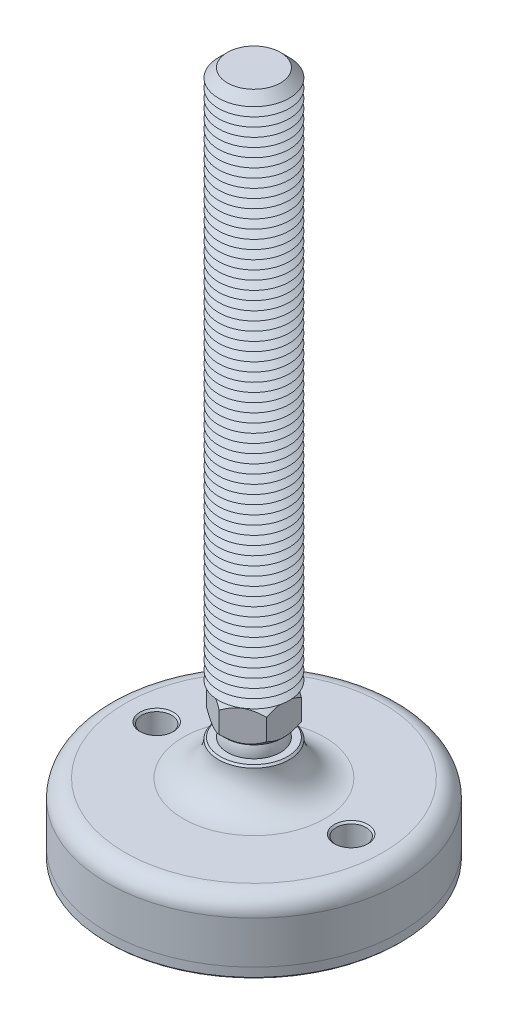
ISO-10303-21;
HEADER;
FILE_DESCRIPTION(('STEP AP214'),'2;1');
FILE_NAME('part.step','',(''),(''),'','','');
FILE_SCHEMA(('AUTOMOTIVE_DESIGN { 1 0 10303 214 1 1 1 1 }'));
ENDSEC;
DATA;
#1=APPLICATION_CONTEXT('core data for automotive mechanical design processes');
#2=APPLICATION_PROTOCOL_DEFINITION('international standard','automotive_design',2000,#1);
#3=PRODUCT_CONTEXT('',#1,'mechanical');
#4=PRODUCT('Part','Part','',(#3));
#5=PRODUCT_RELATED_PRODUCT_CATEGORY('part','',(#4));
#6=PRODUCT_DEFINITION_FORMATION('','',#4);
#7=PRODUCT_DEFINITION_CONTEXT('part definition',#1,'design');
#8=PRODUCT_DEFINITION('design','',#6,#7);
#9=PRODUCT_DEFINITION_SHAPE('','',#8);
#10=(LENGTH_UNIT() NAMED_UNIT(*) SI_UNIT(.MILLI.,.METRE.));
#11=(NAMED_UNIT(*) PLANE_ANGLE_UNIT() SI_UNIT($,.RADIAN.));
#12=(NAMED_UNIT(*) SI_UNIT($,.STERADIAN.) SOLID_ANGLE_UNIT());
#13=UNCERTAINTY_MEASURE_WITH_UNIT(LENGTH_MEASURE(1.E-05),#10,'distance_accuracy_value','');
#14=(GEOMETRIC_REPRESENTATION_CONTEXT(3) GLOBAL_UNCERTAINTY_ASSIGNED_CONTEXT((#13)) GLOBAL_UNIT_ASSIGNED_CONTEXT((#10,
#11,#12)) REPRESENTATION_CONTEXT('',''));
#15=CARTESIAN_POINT('',(0.,0.,0.));
#16=DIRECTION('',(0.,0.,1.));
#17=DIRECTION('',(1.,0.,0.));
#18=AXIS2_PLACEMENT_3D('',#15,#16,#17);
#19=CARTESIAN_POINT('',(0.,-27.,0.));
#20=DIRECTION('',(0.,1.,0.));
#21=DIRECTION('',(0.,0.,1.));
#22=AXIS2_PLACEMENT_3D('',#19,#20,#21);
#23=PLANE('',#22);
#24=CARTESIAN_POINT('',(-27.5,-27.,0.));
#25=DIRECTION('',(0.,1.,0.));
#26=DIRECTION('',(0.,0.,1.));
#27=AXIS2_PLACEMENT_3D('',#24,#25,#26);
#28=CIRCLE('',#27,4.25000000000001);
#29=CARTESIAN_POINT('',(-27.5,-27.,4.25000000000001));
#30=VERTEX_POINT('',#29);
#31=EDGE_CURVE('P0_E43',#30,#30,#28,.T.);
#32=ORIENTED_EDGE('',*,*,#31,.F.);
#33=EDGE_LOOP('',(#32));
#34=FACE_BOUND('',#33,.T.);
#35=CARTESIAN_POINT('',(27.5,-27.,0.));
#36=DIRECTION('',(0.,1.,0.));
#37=DIRECTION('',(0.,0.,1.));
#38=AXIS2_PLACEMENT_3D('',#35,#36,#37);
#39=CIRCLE('',#38,4.25000000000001);
#40=CARTESIAN_POINT('',(27.5,-27.,4.25000000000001));
#41=VERTEX_POINT('',#40);
#42=EDGE_CURVE('P0_E44',#41,#41,#39,.T.);
#43=ORIENTED_EDGE('',*,*,#42,.F.);
#44=EDGE_LOOP('',(#43));
#45=FACE_BOUND('',#44,.T.);
#46=CARTESIAN_POINT('',(0.,-27.,0.));
#47=DIRECTION('',(0.,1.,0.));
#48=DIRECTION('',(0.,0.,1.));
#49=AXIS2_PLACEMENT_3D('',#46,#47,#48);
#50=CIRCLE('',#49,41.5);
#51=CARTESIAN_POINT('',(0.,-27.,41.5));
#52=VERTEX_POINT('',#51);
#53=EDGE_CURVE('P0_E40',#52,#52,#50,.T.);
#54=ORIENTED_EDGE('',*,*,#53,.T.);
#55=EDGE_LOOP('',(#54));
#56=FACE_BOUND('',#55,.T.);
#57=ADVANCED_FACE('P0_F14',(#34,#45,#56),#23,.T.);
#58=CARTESIAN_POINT('',(0.,48.1654938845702,0.));
#59=DIRECTION('',(0.,1.,0.));
#60=DIRECTION('',(0.,0.,1.));
#61=AXIS2_PLACEMENT_3D('',#58,#59,#60);
#62=CYLINDRICAL_SURFACE('',#61,41.5);
#63=CARTESIAN_POINT('',(0.,-29.5,0.));
#64=DIRECTION('',(0.,-1.,0.));
#65=DIRECTION('',(0.,0.,-1.));
#66=AXIS2_PLACEMENT_3D('',#63,#64,#65);
#67=CIRCLE('',#66,41.5);
#68=CARTESIAN_POINT('',(0.,-29.5,-41.5));
#69=VERTEX_POINT('',#68);
#70=EDGE_CURVE('P0_E37',#69,#69,#67,.F.);
#71=ORIENTED_EDGE('',*,*,#70,.T.);
#72=EDGE_LOOP('',(#71));
#73=FACE_BOUND('',#72,.T.);
#74=ORIENTED_EDGE('',*,*,#53,.F.);
#75=EDGE_LOOP('',(#74));
#76=FACE_BOUND('',#75,.T.);
#77=ADVANCED_FACE('P0_F54',(#73,#76),#62,.T.);
#78=CARTESIAN_POINT('',(0.,-30.,41.5));
#79=DIRECTION('',(0.,-1.,0.));
#80=DIRECTION('',(0.,0.,-1.));
#81=AXIS2_PLACEMENT_3D('',#78,#79,#80);
#82=PLANE('',#81);
#83=CARTESIAN_POINT('',(27.5,-30.,0.));
#84=DIRECTION('',(0.,-1.,0.));
#85=DIRECTION('',(0.,0.,-1.));
#86=AXIS2_PLACEMENT_3D('',#83,#84,#85);
#87=CIRCLE('',#86,4.75);
#88=CARTESIAN_POINT('',(27.5,-30.,-4.75000000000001));
#89=VERTEX_POINT('',#88);
#90=EDGE_CURVE('P0_E25',#89,#89,#87,.F.);
#91=ORIENTED_EDGE('',*,*,#90,.T.);
#92=EDGE_LOOP('',(#91));
#93=FACE_BOUND('',#92,.T.);
#94=CARTESIAN_POINT('',(-27.5,-30.,0.));
#95=DIRECTION('',(0.,-1.,0.));
#96=DIRECTION('',(0.,0.,-1.));
#97=AXIS2_PLACEMENT_3D('',#94,#95,#96);
#98=CIRCLE('',#97,4.75);
#99=CARTESIAN_POINT('',(-27.5,-30.,-4.75));
#100=VERTEX_POINT('',#99);
#101=EDGE_CURVE('P0_E29',#100,#100,#98,.F.);
#102=ORIENTED_EDGE('',*,*,#101,.T.);
#103=EDGE_LOOP('',(#102));
#104=FACE_BOUND('',#103,.T.);
#105=CARTESIAN_POINT('',(0.,-30.,0.));
#106=DIRECTION('',(0.,-1.,0.));
#107=DIRECTION('',(0.,0.,-1.));
#108=AXIS2_PLACEMENT_3D('',#105,#106,#107);
#109=CIRCLE('',#108,41.);
#110=CARTESIAN_POINT('',(0.,-30.,-41.));
#111=VERTEX_POINT('',#110);
#112=EDGE_CURVE('P0_E34',#111,#111,#109,.T.);
#113=ORIENTED_EDGE('',*,*,#112,.T.);
#114=EDGE_LOOP('',(#113));
#115=FACE_BOUND('',#114,.T.);
#116=ADVANCED_FACE('P0_F61',(#93,#104,#115),#82,.T.);
#117=CARTESIAN_POINT('',(0.,-29.5,0.));
#118=DIRECTION('',(0.,1.,0.));
#119=DIRECTION('',(0.,0.,1.));
#120=AXIS2_PLACEMENT_3D('',#117,#118,#119);
#121=CONICAL_SURFACE('',#120,41.5,0.785398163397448);
#122=ORIENTED_EDGE('',*,*,#112,.F.);
#123=EDGE_LOOP('',(#122));
#124=FACE_BOUND('',#123,.T.);
#125=ORIENTED_EDGE('',*,*,#70,.F.);
#126=EDGE_LOOP('',(#125));
#127=FACE_BOUND('',#126,.T.);
#128=ADVANCED_FACE('P0_F68',(#124,#127),#121,.T.);
#129=CARTESIAN_POINT('',(27.5,-30.,0.));
#130=DIRECTION('',(0.,1.,0.));
#131=DIRECTION('',(0.,0.,1.));
#132=AXIS2_PLACEMENT_3D('',#129,#130,#131);
#133=CYLINDRICAL_SURFACE('',#132,4.25000000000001);
#134=CARTESIAN_POINT('',(27.5,-29.5,0.));
#135=DIRECTION('',(0.,-1.,0.));
#136=DIRECTION('',(0.,0.,-1.));
#137=AXIS2_PLACEMENT_3D('',#134,#135,#136);
#138=CIRCLE('',#137,4.25000000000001);
#139=CARTESIAN_POINT('',(27.5,-29.5,-4.25000000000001));
#140=VERTEX_POINT('',#139);
#141=EDGE_CURVE('P0_E21',#140,#140,#138,.T.);
#142=ORIENTED_EDGE('',*,*,#141,.T.);
#143=EDGE_LOOP('',(#142));
#144=FACE_BOUND('',#143,.T.);
#145=ORIENTED_EDGE('',*,*,#42,.T.);
#146=EDGE_LOOP('',(#145));
#147=FACE_BOUND('',#146,.T.);
#148=ADVANCED_FACE('P0_F74',(#144,#147),#133,.F.);
#149=CARTESIAN_POINT('',(-27.5,-30.,0.));
#150=DIRECTION('',(0.,1.,0.));
#151=DIRECTION('',(0.,0.,1.));
#152=AXIS2_PLACEMENT_3D('',#149,#150,#151);
#153=CYLINDRICAL_SURFACE('',#152,4.25000000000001);
#154=CARTESIAN_POINT('',(-27.5,-29.5,0.));
#155=DIRECTION('',(0.,-1.,0.));
#156=DIRECTION('',(0.,0.,-1.));
#157=AXIS2_PLACEMENT_3D('',#154,#155,#156);
#158=CIRCLE('',#157,4.25000000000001);
#159=CARTESIAN_POINT('',(-27.5,-29.5,-4.25000000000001));
#160=VERTEX_POINT('',#159);
#161=EDGE_CURVE('P0_E10',#160,#160,#158,.T.);
#162=ORIENTED_EDGE('',*,*,#161,.T.);
#163=EDGE_LOOP('',(#162));
#164=FACE_BOUND('',#163,.T.);
#165=ORIENTED_EDGE('',*,*,#31,.T.);
#166=EDGE_LOOP('',(#165));
#167=FACE_BOUND('',#166,.T.);
#168=ADVANCED_FACE('P0_F50',(#164,#167),#153,.F.);
#169=CARTESIAN_POINT('',(27.5,-30.,0.));
#170=DIRECTION('',(0.,-1.,0.));
#171=DIRECTION('',(0.,0.,-1.));
#172=AXIS2_PLACEMENT_3D('',#169,#170,#171);
#173=CONICAL_SURFACE('',#172,4.75,0.785398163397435);
#174=ORIENTED_EDGE('',*,*,#141,.F.);
#175=EDGE_LOOP('',(#174));
#176=FACE_BOUND('',#175,.T.);
#177=ORIENTED_EDGE('',*,*,#90,.F.);
#178=EDGE_LOOP('',(#177));
#179=FACE_BOUND('',#178,.T.);
#180=ADVANCED_FACE('P0_F76',(#176,#179),#173,.F.);
#181=CARTESIAN_POINT('',(-27.5,-30.,0.));
#182=DIRECTION('',(0.,-1.,0.));
#183=DIRECTION('',(0.,0.,-1.));
#184=AXIS2_PLACEMENT_3D('',#181,#182,#183);
#185=CONICAL_SURFACE('',#184,4.75,0.785398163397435);
#186=ORIENTED_EDGE('',*,*,#161,.F.);
#187=EDGE_LOOP('',(#186));
#188=FACE_BOUND('',#187,.T.);
#189=ORIENTED_EDGE('',*,*,#101,.F.);
#190=EDGE_LOOP('',(#189));
#191=FACE_BOUND('',#190,.T.);
#192=ADVANCED_FACE('P0_F16',(#188,#191),#185,.F.);
#193=CLOSED_SHELL('',(#57,#77,#116,#128,#148,#168,#180,#192));
#194=MANIFOLD_SOLID_BREP('P0_B1',#193);
#195=CARTESIAN_POINT('',(0.,3.75,0.));
#196=DIRECTION('',(0.,1.,0.));
#197=DIRECTION('',(0.,0.,1.));
#198=AXIS2_PLACEMENT_3D('',#195,#196,#197);
#199=PLANE('',#198);
#200=CARTESIAN_POINT('',(0.,3.75,0.));
#201=DIRECTION('',(0.,1.,0.));
#202=DIRECTION('',(0.,0.,1.));
#203=AXIS2_PLACEMENT_3D('',#200,#201,#202);
#204=CIRCLE('',#203,7.99624373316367);
#205=CARTESIAN_POINT('',(0.,3.75,7.99624373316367));
#206=VERTEX_POINT('',#205);
#207=EDGE_CURVE('P1_E211',#206,#206,#204,.T.);
#208=ORIENTED_EDGE('',*,*,#207,.F.);
#209=EDGE_LOOP('',(#208));
#210=FACE_BOUND('',#209,.T.);
#211=CARTESIAN_POINT('',(0.,3.75,0.));
#212=DIRECTION('',(0.,1.,0.));
#213=DIRECTION('',(0.,0.,1.));
#214=AXIS2_PLACEMENT_3D('',#211,#212,#213);
#215=CIRCLE('',#214,6.49519052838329);
#216=CARTESIAN_POINT('',(0.,3.75,6.49519052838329));
#217=VERTEX_POINT('',#216);
#218=EDGE_CURVE('P1_E24',#217,#217,#215,.F.);
#219=ORIENTED_EDGE('',*,*,#218,.F.);
#220=EDGE_LOOP('',(#219));
#221=FACE_BOUND('',#220,.T.);
#222=ADVANCED_FACE('P1_F16',(#210,#221),#199,.F.);
#223=CARTESIAN_POINT('',(0.,0.,0.));
#224=DIRECTION('',(0.,1.,0.));
#225=DIRECTION('',(0.,0.,-1.));
#226=AXIS2_PLACEMENT_3D('',#223,#224,#225);
#227=SPHERICAL_SURFACE('',#226,7.5);
#228=ORIENTED_EDGE('',*,*,#218,.T.);
#229=EDGE_LOOP('',(#228));
#230=FACE_BOUND('',#229,.T.);
#231=ADVANCED_FACE('P1_F201',(#230),#227,.T.);
#232=CARTESIAN_POINT('',(0.,3.75,0.));
#233=DIRECTION('',(0.,1.,0.));
#234=DIRECTION('',(0.,0.,1.));
#235=AXIS2_PLACEMENT_3D('',#232,#233,#234);
#236=CONICAL_SURFACE('',#235,7.99624373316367,0.785398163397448);
#237=ORIENTED_EDGE('',*,*,#207,.T.);
#238=EDGE_LOOP('',(#237));
#239=FACE_BOUND('',#238,.T.);
#240=CARTESIAN_POINT('',(-8.5,8.90811002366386,-10.0392740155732));
#241=CARTESIAN_POINT('',(-8.5,8.72243436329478,-9.79593020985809));
#242=CARTESIAN_POINT('',(-8.5,8.53847898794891,-9.55125250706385));
#243=CARTESIAN_POINT('',(-8.5,8.17478786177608,-9.05869243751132));
#244=CARTESIAN_POINT('',(-8.5,7.99505314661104,-8.81080930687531));
#245=CARTESIAN_POINT('',(-8.5,7.63930320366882,-8.30948839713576));
#246=CARTESIAN_POINT('',(-8.5,7.46332748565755,-8.05602248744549));
#247=CARTESIAN_POINT('',(-8.5,7.11769199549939,-7.54483399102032));
#248=CARTESIAN_POINT('',(-8.5,6.94803178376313,-7.28711170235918));
#249=CARTESIAN_POINT('',(-8.5,6.60640236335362,-6.75094027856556));
#250=CARTESIAN_POINT('',(-8.5,6.43491645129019,-6.47218164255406));
#251=CARTESIAN_POINT('',(-8.5,6.10286460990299,-5.90813314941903));
#252=CARTESIAN_POINT('',(-8.5,5.94230047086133,-5.62284223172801));
#253=CARTESIAN_POINT('',(-8.5,5.63553180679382,-5.04569727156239));
#254=CARTESIAN_POINT('',(-8.5,5.48928508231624,-4.75386583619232));
#255=CARTESIAN_POINT('',(-8.5,5.21442695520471,-4.16207917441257));
#256=CARTESIAN_POINT('',(-8.5,5.08580737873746,-3.86212779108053));
#257=CARTESIAN_POINT('',(-8.5,4.86150447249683,-3.28118098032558));
#258=CARTESIAN_POINT('',(-8.5,4.7638906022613,-3.00093864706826));
#259=CARTESIAN_POINT('',(-8.5,4.59111419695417,-2.43348682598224));
#260=CARTESIAN_POINT('',(-8.5,4.51595314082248,-2.14627688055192));
#261=CARTESIAN_POINT('',(-8.5,4.39333737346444,-1.57150580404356));
#262=CARTESIAN_POINT('',(-8.5,4.34539220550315,-1.28405106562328));
#263=CARTESIAN_POINT('',(-8.5,4.27817908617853,-0.705789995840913));
#264=CARTESIAN_POINT('',(-8.5,4.25890565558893,-0.41498431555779));
#265=CARTESIAN_POINT('',(-8.5,4.25058550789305,0.155345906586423));
#266=CARTESIAN_POINT('',(-8.5,4.2603535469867,0.434853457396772));
#267=CARTESIAN_POINT('',(-8.5,4.30689978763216,0.991595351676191));
#268=CARTESIAN_POINT('',(-8.5,4.34368052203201,1.26882947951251));
#269=CARTESIAN_POINT('',(-8.5,4.44283018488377,1.82371054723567));
#270=CARTESIAN_POINT('',(-8.5,4.50564357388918,2.10127674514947));
#271=CARTESIAN_POINT('',(-8.5,4.65343378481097,2.6503272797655));
#272=CARTESIAN_POINT('',(-8.5,4.73840907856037,2.9218120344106));
#273=CARTESIAN_POINT('',(-8.5,4.93373614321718,3.47773657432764));
#274=CARTESIAN_POINT('',(-8.5,5.04548526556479,3.7616800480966));
#275=CARTESIAN_POINT('',(-8.5,5.28620549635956,4.3222352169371));
#276=CARTESIAN_POINT('',(-8.5,5.41518447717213,4.59884349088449));
#277=CARTESIAN_POINT('',(-8.5,5.68730204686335,5.14605293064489));
#278=CARTESIAN_POINT('',(-8.5,5.8304846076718,5.41663205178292));
#279=CARTESIAN_POINT('',(-8.5,6.1278527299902,5.95157955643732));
#280=CARTESIAN_POINT('',(-8.5,6.28203657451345,6.21594890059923));
#281=CARTESIAN_POINT('',(-8.5,6.59139861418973,6.7263367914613));
#282=CARTESIAN_POINT('',(-8.5,6.74614943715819,6.97261575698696));
#283=CARTESIAN_POINT('',(-8.5,7.06220691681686,7.46094357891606));
#284=CARTESIAN_POINT('',(-8.5,7.22351406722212,7.70299211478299));
#285=CARTESIAN_POINT('',(-8.5,7.55019288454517,8.18145952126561));
#286=CARTESIAN_POINT('',(-8.5,7.71552125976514,8.4179080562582));
#287=CARTESIAN_POINT('',(-8.5,8.05058640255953,8.88756615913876));
#288=CARTESIAN_POINT('',(-8.5,8.22032194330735,9.12077660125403));
#289=CARTESIAN_POINT('',(-8.5,8.39186061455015,9.35262965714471));
#290=B_SPLINE_CURVE_WITH_KNOTS('',3,(#240,#241,#242,#243,#244,#245,#246,#247,#248,#249,#250,
#251,#252,#253,#254,#255,#256,#257,#258,#259,#260,#261,#262,#263,#264,#265,#266,#267,#268,#269,
#270,#271,#272,#273,#274,#275,#276,#277,#278,#279,#280,#281,#282,#283,#284,#285,#286,#287,#288,
#289),.UNSPECIFIED.,.F.,.F.,(4,2,2,2,2,2,2,2,2,2,2,2,2,2,2,2,2,2,2,2,2,2,2,2,4),(0.,
0.918290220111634,1.8368034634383,2.76241942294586,3.68797083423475,4.66961920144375,
5.65142809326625,6.63025007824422,7.60861662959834,8.49811159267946,9.38766513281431,
10.2606329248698,11.1334338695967,11.9711093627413,12.8088634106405,13.6615517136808,
14.5141812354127,15.4289018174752,16.3440417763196,17.2621089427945,18.1800331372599,
19.0524996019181,19.9250318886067,20.7905246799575,21.6557790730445),.UNSPECIFIED.);
#291=CARTESIAN_POINT('',(-8.5,5.56871084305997,-4.90747728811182));
#292=VERTEX_POINT('',#291);
#293=CARTESIAN_POINT('',(-8.5,5.56871084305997,4.90747728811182));
#294=VERTEX_POINT('',#293);
#295=EDGE_CURVE('P1_E185',#292,#294,#290,.T.);
#296=ORIENTED_EDGE('',*,*,#295,.F.);
#297=CARTESIAN_POINT('',(0.000199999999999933,5.5688263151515,-9.81507004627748));
#298=CARTESIAN_POINT('',(-0.145938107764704,5.48446627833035,-9.73069717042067));
#299=CARTESIAN_POINT('',(-0.293216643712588,5.40268088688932,-9.6456658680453));
#300=CARTESIAN_POINT('',(-0.590240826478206,5.24507616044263,-9.47417887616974));
#301=CARTESIAN_POINT('',(-0.739987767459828,5.16926008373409,-9.38772243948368));
#302=CARTESIAN_POINT('',(-1.0428413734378,5.02408965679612,-9.21286982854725));
#303=CARTESIAN_POINT('',(-1.19596236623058,4.95477479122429,-9.12446538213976));
#304=CARTESIAN_POINT('',(-1.50468648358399,4.82411695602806,-8.94622342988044));
#305=CARTESIAN_POINT('',(-1.66028922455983,4.76277276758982,-8.85638614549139));
#306=CARTESIAN_POINT('',(-2.12594374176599,4.59407400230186,-8.58754038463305));
#307=CARTESIAN_POINT('',(-2.4397129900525,4.49965525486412,-8.4063856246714));
#308=CARTESIAN_POINT('',(-2.91546156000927,4.39044680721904,-8.13171205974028));
#309=CARTESIAN_POINT('',(-3.07473438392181,4.35946186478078,-8.03975585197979));
#310=CARTESIAN_POINT('',(-3.39463410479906,4.3089933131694,-7.85506166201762));
#311=CARTESIAN_POINT('',(-3.5552607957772,4.28950798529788,-7.76232379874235));
#312=CARTESIAN_POINT('',(-3.9466882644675,4.25683795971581,-7.5363330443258));
#313=CARTESIAN_POINT('',(-4.17791015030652,4.24998362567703,-7.4028370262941));
#314=CARTESIAN_POINT('',(-4.63993781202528,4.26149030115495,-7.13608523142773));
#315=CARTESIAN_POINT('',(-4.87074341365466,4.27986014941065,-7.00282955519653));
#316=CARTESIAN_POINT('',(-5.33017839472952,4.34073256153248,-6.73757464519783));
#317=CARTESIAN_POINT('',(-5.55880504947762,4.38326211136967,-6.60557698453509));
#318=CARTESIAN_POINT('',(-6.01212885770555,4.49014170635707,-6.34385036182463));
#319=CARTESIAN_POINT('',(-6.23682631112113,4.55449007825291,-6.21412122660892));
#320=CARTESIAN_POINT('',(-6.63569693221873,4.686871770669,-5.98383316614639));
#321=CARTESIAN_POINT('',(-6.81075347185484,4.75142294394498,-5.88276422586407));
#322=CARTESIAN_POINT('',(-7.15772421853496,4.89092708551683,-5.68244057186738));
#323=CARTESIAN_POINT('',(-7.3296383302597,4.96588036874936,-5.58318591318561));
#324=CARTESIAN_POINT('',(-7.6697827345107,5.12450866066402,-5.38680344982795));
#325=CARTESIAN_POINT('',(-7.8380227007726,5.20815624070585,-5.28967006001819));
#326=CARTESIAN_POINT('',(-8.17138743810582,5.38307502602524,-5.09720183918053));
#327=CARTESIAN_POINT('',(-8.33651404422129,5.47434155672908,-5.00186594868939));
#328=CARTESIAN_POINT('',(-8.5002,5.5688263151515,-4.90736181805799));
#329=B_SPLINE_CURVE_WITH_KNOTS('',3,(#297,#298,#299,#300,#301,#302,#303,#304,#305,#306,#307,
#308,#309,#310,#311,#312,#313,#314,#315,#316,#317,#318,#319,#320,#321,#322,#323,#324,#325,#326,
#327,#328),.UNSPECIFIED.,.F.,.F.,(4,2,2,2,2,2,2,2,2,2,2,2,2,2,2,4),(0.,0.565988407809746,
1.13228364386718,1.70182141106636,2.27127198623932,3.39189520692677,3.95110786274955,
4.510236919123,5.31023384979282,6.11051117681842,6.91168416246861,7.71279572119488,
8.34908108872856,8.98538572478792,9.61974061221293,10.2537091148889),.UNSPECIFIED.);
#330=CARTESIAN_POINT('',(0.,5.56871084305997,-9.81495457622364));
#331=VERTEX_POINT('',#330);
#332=EDGE_CURVE('P1_E179',#331,#292,#329,.T.);
#333=ORIENTED_EDGE('',*,*,#332,.F.);
#334=CARTESIAN_POINT('',(8.5002,5.56882631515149,-4.90736181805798));
#335=CARTESIAN_POINT('',(8.3540618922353,5.48446627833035,-4.9917346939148));
#336=CARTESIAN_POINT('',(8.20678335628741,5.40268088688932,-5.07676599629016));
#337=CARTESIAN_POINT('',(7.90975917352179,5.24507616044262,-5.24825298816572));
#338=CARTESIAN_POINT('',(7.76001223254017,5.16926008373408,-5.33470942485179));
#339=CARTESIAN_POINT('',(7.4571586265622,5.02408965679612,-5.50956203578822));
#340=CARTESIAN_POINT('',(7.30403763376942,4.95477479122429,-5.59796648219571));
#341=CARTESIAN_POINT('',(6.99531351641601,4.82411695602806,-5.77620843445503));
#342=CARTESIAN_POINT('',(6.83971077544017,4.76277276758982,-5.86604571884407));
#343=CARTESIAN_POINT('',(6.37405625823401,4.59407400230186,-6.13489147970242));
#344=CARTESIAN_POINT('',(6.0602870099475,4.49965525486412,-6.31604623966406));
#345=CARTESIAN_POINT('',(5.58453843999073,4.39044680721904,-6.59071980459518));
#346=CARTESIAN_POINT('',(5.42526561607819,4.35946186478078,-6.68267601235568));
#347=CARTESIAN_POINT('',(5.10536589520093,4.3089933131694,-6.86737020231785));
#348=CARTESIAN_POINT('',(4.9447392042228,4.28950798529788,-6.96010806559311));
#349=CARTESIAN_POINT('',(4.5533117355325,4.25683795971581,-7.18609882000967));
#350=CARTESIAN_POINT('',(4.32208984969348,4.24998362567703,-7.31959483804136));
#351=CARTESIAN_POINT('',(3.86006218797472,4.26149030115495,-7.58634663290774));
#352=CARTESIAN_POINT('',(3.62925658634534,4.27986014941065,-7.71960230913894));
#353=CARTESIAN_POINT('',(3.16982160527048,4.34073256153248,-7.98485721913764));
#354=CARTESIAN_POINT('',(2.94119495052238,4.38326211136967,-8.11685487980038));
#355=CARTESIAN_POINT('',(2.48787114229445,4.49014170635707,-8.37858150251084));
#356=CARTESIAN_POINT('',(2.26317368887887,4.55449007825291,-8.50831063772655));
#357=CARTESIAN_POINT('',(1.86430306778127,4.686871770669,-8.73859869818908));
#358=CARTESIAN_POINT('',(1.68924652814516,4.75142294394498,-8.83966763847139));
#359=CARTESIAN_POINT('',(1.34227578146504,4.89092708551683,-9.03999129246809));
#360=CARTESIAN_POINT('',(1.1703616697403,4.96588036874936,-9.13924595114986));
#361=CARTESIAN_POINT('',(0.8302172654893,5.12450866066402,-9.33562841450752));
#362=CARTESIAN_POINT('',(0.661977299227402,5.20815624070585,-9.43276180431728));
#363=CARTESIAN_POINT('',(0.328612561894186,5.38307502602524,-9.62523002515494));
#364=CARTESIAN_POINT('',(0.163485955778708,5.47434155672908,-9.72056591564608));
#365=CARTESIAN_POINT('',(-0.000200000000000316,5.5688263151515,-9.81507004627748));
#366=B_SPLINE_CURVE_WITH_KNOTS('',3,(#334,#335,#336,#337,#338,#339,#340,#341,#342,#343,#344,
#345,#346,#347,#348,#349,#350,#351,#352,#353,#354,#355,#356,#357,#358,#359,#360,#361,#362,#363,
#364,#365),.UNSPECIFIED.,.F.,.F.,(4,2,2,2,2,2,2,2,2,2,2,2,2,2,2,4),(0.,0.565988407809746,
1.13228364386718,1.70182141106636,2.27127198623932,3.39189520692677,3.95110786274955,
4.510236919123,5.31023384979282,6.11051117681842,6.91168416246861,7.71279572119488,
8.34908108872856,8.98538572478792,9.61974061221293,10.2537091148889),.UNSPECIFIED.);
#367=CARTESIAN_POINT('',(8.5,5.56871084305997,-4.90747728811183));
#368=VERTEX_POINT('',#367);
#369=EDGE_CURVE('P1_E167',#368,#331,#366,.T.);
#370=ORIENTED_EDGE('',*,*,#369,.F.);
#371=CARTESIAN_POINT('',(8.5,8.90811002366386,-10.0392740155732));
#372=CARTESIAN_POINT('',(8.5,8.72243436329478,-9.79593020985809));
#373=CARTESIAN_POINT('',(8.5,8.5384789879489,-9.55125250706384));
#374=CARTESIAN_POINT('',(8.5,8.17478786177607,-9.05869243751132));
#375=CARTESIAN_POINT('',(8.5,7.99505314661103,-8.81080930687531));
#376=CARTESIAN_POINT('',(8.5,7.63930320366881,-8.30948839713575));
#377=CARTESIAN_POINT('',(8.5,7.46332748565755,-8.05602248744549));
#378=CARTESIAN_POINT('',(8.5,7.11769199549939,-7.54483399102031));
#379=CARTESIAN_POINT('',(8.5,6.94803178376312,-7.28711170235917));
#380=CARTESIAN_POINT('',(8.5,6.60640236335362,-6.75094027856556));
#381=CARTESIAN_POINT('',(8.5,6.43491645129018,-6.47218164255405));
#382=CARTESIAN_POINT('',(8.5,6.10286460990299,-5.90813314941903));
#383=CARTESIAN_POINT('',(8.5,5.94230047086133,-5.62284223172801));
#384=CARTESIAN_POINT('',(8.5,5.63553180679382,-5.04569727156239));
#385=CARTESIAN_POINT('',(8.5,5.48928508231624,-4.75386583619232));
#386=CARTESIAN_POINT('',(8.5,5.21442695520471,-4.16207917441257));
#387=CARTESIAN_POINT('',(8.5,5.08580737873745,-3.86212779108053));
#388=CARTESIAN_POINT('',(8.5,4.86150447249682,-3.28118098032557));
#389=CARTESIAN_POINT('',(8.5,4.7638906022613,-3.00093864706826));
#390=CARTESIAN_POINT('',(8.5,4.59111419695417,-2.43348682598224));
#391=CARTESIAN_POINT('',(8.5,4.51595314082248,-2.14627688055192));
#392=CARTESIAN_POINT('',(8.5,4.39333737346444,-1.57150580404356));
#393=CARTESIAN_POINT('',(8.5,4.34539220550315,-1.28405106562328));
#394=CARTESIAN_POINT('',(8.5,4.27817908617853,-0.705789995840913));
#395=CARTESIAN_POINT('',(8.5,4.25890565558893,-0.41498431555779));
#396=CARTESIAN_POINT('',(8.5,4.25058550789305,0.155345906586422));
#397=CARTESIAN_POINT('',(8.5,4.2603535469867,0.434853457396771));
#398=CARTESIAN_POINT('',(8.5,4.30689978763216,0.99159535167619));
#399=CARTESIAN_POINT('',(8.5,4.34368052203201,1.2688294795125));
#400=CARTESIAN_POINT('',(8.5,4.44283018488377,1.82371054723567));
#401=CARTESIAN_POINT('',(8.5,4.50564357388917,2.10127674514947));
#402=CARTESIAN_POINT('',(8.5,4.65343378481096,2.65032727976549));
#403=CARTESIAN_POINT('',(8.5,4.73840907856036,2.9218120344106));
#404=CARTESIAN_POINT('',(8.5,4.93373614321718,3.47773657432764));
#405=CARTESIAN_POINT('',(8.5,5.04548526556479,3.7616800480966));
#406=CARTESIAN_POINT('',(8.5,5.28620549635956,4.3222352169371));
#407=CARTESIAN_POINT('',(8.5,5.41518447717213,4.59884349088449));
#408=CARTESIAN_POINT('',(8.5,5.68730204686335,5.14605293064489));
#409=CARTESIAN_POINT('',(8.5,5.8304846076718,5.41663205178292));
#410=CARTESIAN_POINT('',(8.5,6.1278527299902,5.95157955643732));
#411=CARTESIAN_POINT('',(8.5,6.28203657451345,6.21594890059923));
#412=CARTESIAN_POINT('',(8.5,6.59139861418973,6.7263367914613));
#413=CARTESIAN_POINT('',(8.5,6.74614943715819,6.97261575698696));
#414=CARTESIAN_POINT('',(8.5,7.06220691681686,7.46094357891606));
#415=CARTESIAN_POINT('',(8.5,7.22351406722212,7.70299211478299));
#416=CARTESIAN_POINT('',(8.5,7.55019288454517,8.18145952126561));
#417=CARTESIAN_POINT('',(8.5,7.71552125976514,8.4179080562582));
#418=CARTESIAN_POINT('',(8.5,8.05058640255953,8.88756615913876));
#419=CARTESIAN_POINT('',(8.5,8.22032194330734,9.12077660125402));
#420=CARTESIAN_POINT('',(8.5,8.39186061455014,9.35262965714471));
#421=B_SPLINE_CURVE_WITH_KNOTS('',3,(#371,#372,#373,#374,#375,#376,#377,#378,#379,#380,#381,
#382,#383,#384,#385,#386,#387,#388,#389,#390,#391,#392,#393,#394,#395,#396,#397,#398,#399,#400,
#401,#402,#403,#404,#405,#406,#407,#408,#409,#410,#411,#412,#413,#414,#415,#416,#417,#418,#419,
#420),.UNSPECIFIED.,.F.,.F.,(4,2,2,2,2,2,2,2,2,2,2,2,2,2,2,2,2,2,2,2,2,2,2,2,4),(0.,
0.918290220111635,1.8368034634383,2.76241942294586,3.68797083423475,4.66961920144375,
5.65142809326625,6.63025007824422,7.60861662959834,8.49811159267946,9.38766513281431,
10.2606329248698,11.1334338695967,11.9711093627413,12.8088634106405,13.6615517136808,
14.5141812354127,15.4289018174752,16.3440417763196,17.2621089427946,18.1800331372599,
19.0524996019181,19.9250318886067,20.7905246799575,21.6557790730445),.UNSPECIFIED.);
#422=CARTESIAN_POINT('',(8.5,5.56871084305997,4.90747728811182));
#423=VERTEX_POINT('',#422);
#424=EDGE_CURVE('P1_E70',#423,#368,#421,.F.);
#425=ORIENTED_EDGE('',*,*,#424,.F.);
#426=CARTESIAN_POINT('',(-0.000200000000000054,5.56882631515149,9.81507004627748));
#427=CARTESIAN_POINT('',(0.145938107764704,5.48446627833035,9.73069717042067));
#428=CARTESIAN_POINT('',(0.293216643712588,5.40268088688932,9.6456658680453));
#429=CARTESIAN_POINT('',(0.590240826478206,5.24507616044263,9.47417887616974));
#430=CARTESIAN_POINT('',(0.739987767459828,5.16926008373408,9.38772243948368));
#431=CARTESIAN_POINT('',(1.0428413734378,5.02408965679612,9.21286982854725));
#432=CARTESIAN_POINT('',(1.19596236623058,4.95477479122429,9.12446538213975));
#433=CARTESIAN_POINT('',(1.50468648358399,4.82411695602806,8.94622342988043));
#434=CARTESIAN_POINT('',(1.66028922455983,4.76277276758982,8.85638614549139));
#435=CARTESIAN_POINT('',(2.12594374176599,4.59407400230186,8.58754038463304));
#436=CARTESIAN_POINT('',(2.4397129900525,4.49965525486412,8.4063856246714));
#437=CARTESIAN_POINT('',(2.91546156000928,4.39044680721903,8.13171205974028));
#438=CARTESIAN_POINT('',(3.07473438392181,4.35946186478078,8.03975585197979));
#439=CARTESIAN_POINT('',(3.39463410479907,4.3089933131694,7.85506166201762));
#440=CARTESIAN_POINT('',(3.55526079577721,4.28950798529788,7.76232379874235));
#441=CARTESIAN_POINT('',(3.9466882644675,4.25683795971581,7.53633304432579));
#442=CARTESIAN_POINT('',(4.17791015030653,4.24998362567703,7.4028370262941));
#443=CARTESIAN_POINT('',(4.63993781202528,4.26149030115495,7.13608523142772));
#444=CARTESIAN_POINT('',(4.87074341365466,4.27986014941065,7.00282955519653));
#445=CARTESIAN_POINT('',(5.33017839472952,4.34073256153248,6.73757464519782));
#446=CARTESIAN_POINT('',(5.55880504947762,4.38326211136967,6.60557698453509));
#447=CARTESIAN_POINT('',(6.01212885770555,4.49014170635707,6.34385036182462));
#448=CARTESIAN_POINT('',(6.23682631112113,4.55449007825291,6.21412122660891));
#449=CARTESIAN_POINT('',(6.63569693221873,4.686871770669,5.98383316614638));
#450=CARTESIAN_POINT('',(6.81075347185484,4.75142294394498,5.88276422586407));
#451=CARTESIAN_POINT('',(7.15772421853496,4.89092708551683,5.68244057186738));
#452=CARTESIAN_POINT('',(7.3296383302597,4.96588036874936,5.58318591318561));
#453=CARTESIAN_POINT('',(7.6697827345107,5.12450866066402,5.38680344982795));
#454=CARTESIAN_POINT('',(7.8380227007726,5.20815624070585,5.28967006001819));
#455=CARTESIAN_POINT('',(8.17138743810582,5.38307502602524,5.09720183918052));
#456=CARTESIAN_POINT('',(8.33651404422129,5.47434155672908,5.00186594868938));
#457=CARTESIAN_POINT('',(8.5002,5.56882631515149,4.90736181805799));
#458=B_SPLINE_CURVE_WITH_KNOTS('',3,(#426,#427,#428,#429,#430,#431,#432,#433,#434,#435,#436,
#437,#438,#439,#440,#441,#442,#443,#444,#445,#446,#447,#448,#449,#450,#451,#452,#453,#454,#455,
#456,#457),.UNSPECIFIED.,.F.,.F.,(4,2,2,2,2,2,2,2,2,2,2,2,2,2,2,4),(0.,0.565988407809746,
1.13228364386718,1.70182141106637,2.27127198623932,3.39189520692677,3.95110786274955,
4.51023691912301,5.31023384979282,6.11051117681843,6.91168416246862,7.71279572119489,
8.34908108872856,8.98538572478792,9.61974061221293,10.2537091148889),.UNSPECIFIED.);
#459=CARTESIAN_POINT('',(0.,5.56871084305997,9.81495457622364));
#460=VERTEX_POINT('',#459);
#461=EDGE_CURVE('P1_E67',#460,#423,#458,.T.);
#462=ORIENTED_EDGE('',*,*,#461,.F.);
#463=CARTESIAN_POINT('',(-8.5002,5.56882631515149,4.90736181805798));
#464=CARTESIAN_POINT('',(-8.3540618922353,5.48446627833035,4.9917346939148));
#465=CARTESIAN_POINT('',(-8.20678335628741,5.40268088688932,5.07676599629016));
#466=CARTESIAN_POINT('',(-7.90975917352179,5.24507616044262,5.24825298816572));
#467=CARTESIAN_POINT('',(-7.76001223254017,5.16926008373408,5.33470942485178));
#468=CARTESIAN_POINT('',(-7.4571586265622,5.02408965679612,5.50956203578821));
#469=CARTESIAN_POINT('',(-7.30403763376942,4.95477479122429,5.59796648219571));
#470=CARTESIAN_POINT('',(-6.99531351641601,4.82411695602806,5.77620843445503));
#471=CARTESIAN_POINT('',(-6.83971077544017,4.76277276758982,5.86604571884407));
#472=CARTESIAN_POINT('',(-6.37405625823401,4.59407400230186,6.13489147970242));
#473=CARTESIAN_POINT('',(-6.0602870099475,4.49965525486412,6.31604623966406));
#474=CARTESIAN_POINT('',(-5.58453843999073,4.39044680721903,6.59071980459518));
#475=CARTESIAN_POINT('',(-5.42526561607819,4.35946186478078,6.68267601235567));
#476=CARTESIAN_POINT('',(-5.10536589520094,4.30899331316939,6.86737020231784));
#477=CARTESIAN_POINT('',(-4.9447392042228,4.28950798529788,6.96010806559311));
#478=CARTESIAN_POINT('',(-4.5533117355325,4.25683795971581,7.18609882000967));
#479=CARTESIAN_POINT('',(-4.32208984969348,4.24998362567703,7.31959483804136));
#480=CARTESIAN_POINT('',(-3.86006218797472,4.26149030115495,7.58634663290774));
#481=CARTESIAN_POINT('',(-3.62925658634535,4.27986014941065,7.71960230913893));
#482=CARTESIAN_POINT('',(-3.16982160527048,4.34073256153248,7.98485721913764));
#483=CARTESIAN_POINT('',(-2.94119495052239,4.38326211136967,8.11685487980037));
#484=CARTESIAN_POINT('',(-2.48787114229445,4.49014170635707,8.37858150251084));
#485=CARTESIAN_POINT('',(-2.26317368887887,4.55449007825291,8.50831063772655));
#486=CARTESIAN_POINT('',(-1.86430306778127,4.686871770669,8.73859869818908));
#487=CARTESIAN_POINT('',(-1.68924652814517,4.75142294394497,8.83966763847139));
#488=CARTESIAN_POINT('',(-1.34227578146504,4.89092708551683,9.03999129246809));
#489=CARTESIAN_POINT('',(-1.1703616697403,4.96588036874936,9.13924595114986));
#490=CARTESIAN_POINT('',(-0.830217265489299,5.12450866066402,9.33562841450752));
#491=CARTESIAN_POINT('',(-0.6619772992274,5.20815624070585,9.43276180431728));
#492=CARTESIAN_POINT('',(-0.328612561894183,5.38307502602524,9.62523002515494));
#493=CARTESIAN_POINT('',(-0.163485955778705,5.47434155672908,9.72056591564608));
#494=CARTESIAN_POINT('',(0.000200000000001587,5.5688263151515,9.81507004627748));
#495=B_SPLINE_CURVE_WITH_KNOTS('',3,(#463,#464,#465,#466,#467,#468,#469,#470,#471,#472,#473,
#474,#475,#476,#477,#478,#479,#480,#481,#482,#483,#484,#485,#486,#487,#488,#489,#490,#491,#492,
#493,#494),.UNSPECIFIED.,.F.,.F.,(4,2,2,2,2,2,2,2,2,2,2,2,2,2,2,4),(0.,0.565988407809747,
1.13228364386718,1.70182141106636,2.27127198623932,3.39189520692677,3.95110786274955,
4.510236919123,5.31023384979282,6.11051117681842,6.91168416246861,7.71279572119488,
8.34908108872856,8.98538572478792,9.61974061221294,10.2537091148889),.UNSPECIFIED.);
#496=EDGE_CURVE('P1_E39',#294,#460,#495,.T.);
#497=ORIENTED_EDGE('',*,*,#496,.F.);
#498=EDGE_LOOP('',(#296,#333,#370,#425,#462,#497));
#499=FACE_BOUND('',#498,.T.);
#500=ADVANCED_FACE('P1_F68',(#239,#499),#236,.T.);
#501=CARTESIAN_POINT('',(-8.5,14.,-4.90747728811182));
#502=DIRECTION('',(1.,0.,0.));
#503=DIRECTION('',(0.,0.,-1.));
#504=AXIS2_PLACEMENT_3D('',#501,#502,#503);
#505=PLANE('',#504);
#506=DIRECTION('',(0.,-1.,0.));
#507=VECTOR('',#506,1.);
#508=CARTESIAN_POINT('',(-8.5,14.,4.90747728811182));
#509=LINE('',#508,#507);
#510=CARTESIAN_POINT('',(-8.5,11.5462613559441,4.90747728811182));
#511=VERTEX_POINT('',#510);
#512=EDGE_CURVE('P1_E83',#511,#294,#509,.T.);
#513=ORIENTED_EDGE('',*,*,#512,.F.);
#514=CARTESIAN_POINT('',(-8.5,8.39798309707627,-9.78751273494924));
#515=CARTESIAN_POINT('',(-8.5,8.57787513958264,-9.54919755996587));
#516=CARTESIAN_POINT('',(-8.5,8.75602828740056,-9.30954807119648));
#517=CARTESIAN_POINT('',(-8.5,9.10807823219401,-8.827054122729));
#518=CARTESIAN_POINT('',(-8.5,9.2819739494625,-8.58420887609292));
#519=CARTESIAN_POINT('',(-8.5,9.62596686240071,-8.09302066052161));
#520=CARTESIAN_POINT('',(-8.5,9.79602418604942,-7.84464967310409));
#521=CARTESIAN_POINT('',(-8.5,10.1297912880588,-7.34369187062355));
#522=CARTESIAN_POINT('',(-8.5,10.2935015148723,-7.09110535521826));
#523=CARTESIAN_POINT('',(-8.5,10.6222985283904,-6.566468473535));
#524=CARTESIAN_POINT('',(-8.5,10.7869291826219,-6.29413078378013));
#525=CARTESIAN_POINT('',(-8.5,11.1053589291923,-5.74309849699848));
#526=CARTESIAN_POINT('',(-8.5,11.259156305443,-5.464402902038));
#527=CARTESIAN_POINT('',(-8.5,11.5526010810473,-4.90068072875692));
#528=CARTESIAN_POINT('',(-8.5,11.6922900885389,-4.61567598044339));
#529=CARTESIAN_POINT('',(-8.5,11.9543910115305,-4.0378936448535));
#530=CARTESIAN_POINT('',(-8.5,12.0768107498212,-3.74511964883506));
#531=CARTESIAN_POINT('',(-8.5,12.2910322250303,-3.17524396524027));
#532=CARTESIAN_POINT('',(-8.5,12.38450510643,-2.89877705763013));
#533=CARTESIAN_POINT('',(-8.5,12.5492711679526,-2.33918702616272));
#534=CARTESIAN_POINT('',(-8.5,12.6205628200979,-2.05606344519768));
#535=CARTESIAN_POINT('',(-8.5,12.7360573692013,-1.48955968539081));
#536=CARTESIAN_POINT('',(-8.5,12.7807243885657,-1.2062756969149));
#537=CARTESIAN_POINT('',(-8.5,12.8421027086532,-0.636679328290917));
#538=CARTESIAN_POINT('',(-8.5,12.8588188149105,-0.35036747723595));
#539=CARTESIAN_POINT('',(-8.5,12.8630538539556,0.212098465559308));
#540=CARTESIAN_POINT('',(-8.5,12.8516076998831,0.488245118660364));
#541=CARTESIAN_POINT('',(-8.5,12.8024337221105,1.03817300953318));
#542=CARTESIAN_POINT('',(-8.5,12.7647033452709,1.31195401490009));
#543=CARTESIAN_POINT('',(-8.5,12.6643776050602,1.85979788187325));
#544=CARTESIAN_POINT('',(-8.5,12.6013591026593,2.13378200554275));
#545=CARTESIAN_POINT('',(-8.5,12.4538179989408,2.67578043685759));
#546=CARTESIAN_POINT('',(-8.5,12.3692971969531,2.94379524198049));
#547=CARTESIAN_POINT('',(-8.5,12.1735358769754,3.49812653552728));
#548=CARTESIAN_POINT('',(-8.5,12.0605376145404,3.78381596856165));
#549=CARTESIAN_POINT('',(-8.5,11.8171932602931,4.34777400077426));
#550=CARTESIAN_POINT('',(-8.5,11.686839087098,4.62603907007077));
#551=CARTESIAN_POINT('',(-8.5,11.4118843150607,5.17650827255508));
#552=CARTESIAN_POINT('',(-8.5,11.2672389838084,5.44868988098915));
#553=CARTESIAN_POINT('',(-8.5,10.9668989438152,5.9867894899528));
#554=CARTESIAN_POINT('',(-8.5,10.811205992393,6.25270847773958));
#555=CARTESIAN_POINT('',(-8.5,10.4989138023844,6.76601719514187));
#556=CARTESIAN_POINT('',(-8.5,10.3427453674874,7.0136704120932));
#557=CARTESIAN_POINT('',(-8.5,10.0238413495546,7.50472523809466));
#558=CARTESIAN_POINT('',(-8.5,9.86110526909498,7.74812652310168));
#559=CARTESIAN_POINT('',(-8.5,9.53158408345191,8.22926020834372));
#560=CARTESIAN_POINT('',(-8.5,9.36484260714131,8.46702259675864));
#561=CARTESIAN_POINT('',(-8.5,9.02695015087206,8.93929808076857));
#562=CARTESIAN_POINT('',(-8.5,8.85580039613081,9.17381205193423));
#563=CARTESIAN_POINT('',(-8.5,8.68284834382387,9.40696575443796));
#564=B_SPLINE_CURVE_WITH_KNOTS('',3,(#514,#515,#516,#517,#518,#519,#520,#521,#522,#523,#524,
#525,#526,#527,#528,#529,#530,#531,#532,#533,#534,#535,#536,#537,#538,#539,#540,#541,#542,#543,
#544,#545,#546,#547,#548,#549,#550,#551,#552,#553,#554,#555,#556,#557,#558,#559,#560,#561,#562,
#563),.UNSPECIFIED.,.F.,.F.,(4,2,2,2,2,2,2,2,2,2,2,2,2,2,2,2,2,2,2,2,2,2,2,2,4),(0.,
0.895784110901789,1.79179309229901,2.69474460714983,3.59763220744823,4.55212531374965,
5.50676928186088,6.45851015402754,7.4098185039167,8.28457217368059,9.15938608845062,
10.0184667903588,10.8773997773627,11.7052430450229,12.5331667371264,13.3755635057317,
14.2178898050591,15.138846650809,16.060233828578,16.9846023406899,17.9088241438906,
18.7870452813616,19.6653330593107,20.5364863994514,21.4074001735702),.UNSPECIFIED.);
#565=CARTESIAN_POINT('',(-8.5,11.5462613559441,-4.90747728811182));
#566=VERTEX_POINT('',#565);
#567=EDGE_CURVE('P1_E84',#511,#566,#564,.F.);
#568=ORIENTED_EDGE('',*,*,#567,.T.);
#569=DIRECTION('',(0.,-1.,0.));
#570=VECTOR('',#569,1.);
#571=CARTESIAN_POINT('',(-8.5,14.,-4.90747728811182));
#572=LINE('',#571,#570);
#573=EDGE_CURVE('P1_E100',#566,#292,#572,.T.);
#574=ORIENTED_EDGE('',*,*,#573,.T.);
#575=ORIENTED_EDGE('',*,*,#295,.T.);
#576=EDGE_LOOP('',(#513,#568,#574,#575));
#577=FACE_BOUND('',#576,.T.);
#578=ADVANCED_FACE('P1_F193',(#577),#505,.F.);
#579=CARTESIAN_POINT('',(0.,14.,-9.81495457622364));
#580=DIRECTION('',(0.5,0.,0.866025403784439));
#581=DIRECTION('',(0.866025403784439,0.,-0.5));
#582=AXIS2_PLACEMENT_3D('',#579,#580,#581);
#583=PLANE('',#582);
#584=ORIENTED_EDGE('',*,*,#573,.F.);
#585=CARTESIAN_POINT('',(-8.5002,11.5461458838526,-4.90736181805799));
#586=CARTESIAN_POINT('',(-8.3540618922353,11.6305059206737,-4.9917346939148));
#587=CARTESIAN_POINT('',(-8.20678335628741,11.7122913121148,-5.07676599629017));
#588=CARTESIAN_POINT('',(-7.90975917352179,11.8698960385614,-5.24825298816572));
#589=CARTESIAN_POINT('',(-7.76001223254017,11.94571211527,-5.33470942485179));
#590=CARTESIAN_POINT('',(-7.4571586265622,12.0908825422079,-5.50956203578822));
#591=CARTESIAN_POINT('',(-7.30403763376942,12.1601974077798,-5.59796648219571));
#592=CARTESIAN_POINT('',(-6.99531351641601,12.290855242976,-5.77620843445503));
#593=CARTESIAN_POINT('',(-6.83971077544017,12.3521994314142,-5.86604571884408));
#594=CARTESIAN_POINT('',(-6.37405625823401,12.5208981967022,-6.13489147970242));
#595=CARTESIAN_POINT('',(-6.0602870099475,12.61531694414,-6.31604623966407));
#596=CARTESIAN_POINT('',(-5.58453843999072,12.724525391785,-6.59071980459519));
#597=CARTESIAN_POINT('',(-5.42526561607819,12.7555103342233,-6.68267601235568));
#598=CARTESIAN_POINT('',(-5.10536589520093,12.8059788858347,-6.86737020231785));
#599=CARTESIAN_POINT('',(-4.94473920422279,12.8254642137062,-6.96010806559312));
#600=CARTESIAN_POINT('',(-4.55331173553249,12.8581342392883,-7.18609882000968));
#601=CARTESIAN_POINT('',(-4.32208984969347,12.864988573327,-7.31959483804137));
#602=CARTESIAN_POINT('',(-3.86006218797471,12.8534818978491,-7.58634663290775));
#603=CARTESIAN_POINT('',(-3.62925658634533,12.8351120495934,-7.71960230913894));
#604=CARTESIAN_POINT('',(-3.16982160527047,12.7742396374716,-7.98485721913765));
#605=CARTESIAN_POINT('',(-2.94119495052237,12.7317100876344,-8.11685487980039));
#606=CARTESIAN_POINT('',(-2.48787114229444,12.624830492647,-8.37858150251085));
#607=CARTESIAN_POINT('',(-2.26317368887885,12.5604821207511,-8.50831063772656));
#608=CARTESIAN_POINT('',(-1.86430306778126,12.4281004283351,-8.73859869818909));
#609=CARTESIAN_POINT('',(-1.68924652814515,12.3635492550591,-8.8396676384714));
#610=CARTESIAN_POINT('',(-1.34227578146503,12.2240451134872,-9.03999129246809));
#611=CARTESIAN_POINT('',(-1.17036166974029,12.1490918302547,-9.13924595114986));
#612=CARTESIAN_POINT('',(-0.830217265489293,11.99046353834,-9.33562841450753));
#613=CARTESIAN_POINT('',(-0.661977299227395,11.9068159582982,-9.43276180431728));
#614=CARTESIAN_POINT('',(-0.328612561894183,11.7318971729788,-9.62523002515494));
#615=CARTESIAN_POINT('',(-0.163485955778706,11.640630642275,-9.72056591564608));
#616=CARTESIAN_POINT('',(0.000199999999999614,11.5461458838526,-9.81507004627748));
#617=B_SPLINE_CURVE_WITH_KNOTS('',3,(#585,#586,#587,#588,#589,#590,#591,#592,#593,#594,#595,
#596,#597,#598,#599,#600,#601,#602,#603,#604,#605,#606,#607,#608,#609,#610,#611,#612,#613,#614,
#615,#616),.UNSPECIFIED.,.F.,.F.,(4,2,2,2,2,2,2,2,2,2,2,2,2,2,2,4),(0.,0.565988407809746,
1.13228364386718,1.70182141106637,2.27127198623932,3.39189520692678,3.95110786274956,
4.51023691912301,5.31023384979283,6.11051117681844,6.91168416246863,7.7127957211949,
8.34908108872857,8.98538572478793,9.61974061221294,10.2537091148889),.UNSPECIFIED.);
#618=CARTESIAN_POINT('',(0.,11.5462613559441,-9.81495457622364));
#619=VERTEX_POINT('',#618);
#620=EDGE_CURVE('P1_E31',#566,#619,#617,.T.);
#621=ORIENTED_EDGE('',*,*,#620,.T.);
#622=DIRECTION('',(0.,-1.,0.));
#623=VECTOR('',#622,1.);
#624=CARTESIAN_POINT('',(0.,14.,-9.81495457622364));
#625=LINE('',#624,#623);
#626=EDGE_CURVE('P1_E97',#619,#331,#625,.T.);
#627=ORIENTED_EDGE('',*,*,#626,.T.);
#628=ORIENTED_EDGE('',*,*,#332,.T.);
#629=EDGE_LOOP('',(#584,#621,#627,#628));
#630=FACE_BOUND('',#629,.T.);
#631=ADVANCED_FACE('P1_F190',(#630),#583,.F.);
#632=CARTESIAN_POINT('',(8.5,14.,-4.90747728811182));
#633=DIRECTION('',(-0.5,0.,0.866025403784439));
#634=DIRECTION('',(0.866025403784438,0.,0.5));
#635=AXIS2_PLACEMENT_3D('',#632,#633,#634);
#636=PLANE('',#635);
#637=ORIENTED_EDGE('',*,*,#626,.F.);
#638=CARTESIAN_POINT('',(-0.000199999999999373,11.5461458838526,-9.81507004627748));
#639=CARTESIAN_POINT('',(0.145938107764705,11.6305059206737,-9.73069717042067));
#640=CARTESIAN_POINT('',(0.293216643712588,11.7122913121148,-9.6456658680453));
#641=CARTESIAN_POINT('',(0.590240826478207,11.8698960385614,-9.47417887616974));
#642=CARTESIAN_POINT('',(0.739987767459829,11.94571211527,-9.38772243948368));
#643=CARTESIAN_POINT('',(1.0428413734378,12.0908825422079,-9.21286982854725));
#644=CARTESIAN_POINT('',(1.19596236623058,12.1601974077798,-9.12446538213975));
#645=CARTESIAN_POINT('',(1.504686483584,12.290855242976,-8.94622342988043));
#646=CARTESIAN_POINT('',(1.66028922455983,12.3521994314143,-8.85638614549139));
#647=CARTESIAN_POINT('',(2.125943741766,12.5208981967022,-8.58754038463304));
#648=CARTESIAN_POINT('',(2.43971299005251,12.61531694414,-8.4063856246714));
#649=CARTESIAN_POINT('',(2.91546156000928,12.724525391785,-8.13171205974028));
#650=CARTESIAN_POINT('',(3.07473438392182,12.7555103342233,-8.03975585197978));
#651=CARTESIAN_POINT('',(3.39463410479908,12.8059788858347,-7.85506166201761));
#652=CARTESIAN_POINT('',(3.55526079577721,12.8254642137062,-7.76232379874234));
#653=CARTESIAN_POINT('',(3.94668826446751,12.8581342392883,-7.53633304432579));
#654=CARTESIAN_POINT('',(4.17791015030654,12.864988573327,-7.40283702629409));
#655=CARTESIAN_POINT('',(4.63993781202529,12.8534818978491,-7.13608523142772));
#656=CARTESIAN_POINT('',(4.87074341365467,12.8351120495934,-7.00282955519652));
#657=CARTESIAN_POINT('',(5.33017839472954,12.7742396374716,-6.73757464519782));
#658=CARTESIAN_POINT('',(5.55880504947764,12.7317100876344,-6.60557698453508));
#659=CARTESIAN_POINT('',(6.01212885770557,12.624830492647,-6.34385036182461));
#660=CARTESIAN_POINT('',(6.23682631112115,12.5604821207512,-6.2141212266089));
#661=CARTESIAN_POINT('',(6.63569693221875,12.4281004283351,-5.98383316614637));
#662=CARTESIAN_POINT('',(6.81075347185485,12.3635492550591,-5.88276422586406));
#663=CARTESIAN_POINT('',(7.15772421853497,12.2240451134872,-5.68244057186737));
#664=CARTESIAN_POINT('',(7.32963833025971,12.1490918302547,-5.5831859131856));
#665=CARTESIAN_POINT('',(7.66978273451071,11.99046353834,-5.38680344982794));
#666=CARTESIAN_POINT('',(7.83802270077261,11.9068159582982,-5.28967006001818));
#667=CARTESIAN_POINT('',(8.17138743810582,11.7318971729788,-5.09720183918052));
#668=CARTESIAN_POINT('',(8.33651404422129,11.640630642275,-5.00186594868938));
#669=CARTESIAN_POINT('',(8.5002,11.5461458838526,-4.90736181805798));
#670=B_SPLINE_CURVE_WITH_KNOTS('',3,(#638,#639,#640,#641,#642,#643,#644,#645,#646,#647,#648,
#649,#650,#651,#652,#653,#654,#655,#656,#657,#658,#659,#660,#661,#662,#663,#664,#665,#666,#667,
#668,#669),.UNSPECIFIED.,.F.,.F.,(4,2,2,2,2,2,2,2,2,2,2,2,2,2,2,4),(0.,0.565988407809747,
1.13228364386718,1.70182141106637,2.27127198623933,3.39189520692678,3.95110786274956,
4.51023691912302,5.31023384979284,6.11051117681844,6.91168416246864,7.71279572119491,
8.34908108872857,8.98538572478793,9.61974061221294,10.2537091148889),.UNSPECIFIED.);
#671=CARTESIAN_POINT('',(8.5,11.5462613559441,-4.90747728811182));
#672=VERTEX_POINT('',#671);
#673=EDGE_CURVE('P1_E143',#619,#672,#670,.T.);
#674=ORIENTED_EDGE('',*,*,#673,.T.);
#675=DIRECTION('',(0.,-1.,0.));
#676=VECTOR('',#675,1.);
#677=CARTESIAN_POINT('',(8.5,14.,-4.90747728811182));
#678=LINE('',#677,#676);
#679=EDGE_CURVE('P1_E92',#672,#368,#678,.T.);
#680=ORIENTED_EDGE('',*,*,#679,.T.);
#681=ORIENTED_EDGE('',*,*,#369,.T.);
#682=EDGE_LOOP('',(#637,#674,#680,#681));
#683=FACE_BOUND('',#682,.T.);
#684=ADVANCED_FACE('P1_F157',(#683),#636,.F.);
#685=CARTESIAN_POINT('',(8.5,14.,4.90747728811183));
#686=DIRECTION('',(-1.,0.,0.));
#687=DIRECTION('',(0.,0.,1.));
#688=AXIS2_PLACEMENT_3D('',#685,#686,#687);
#689=PLANE('',#688);
#690=ORIENTED_EDGE('',*,*,#679,.F.);
#691=CARTESIAN_POINT('',(8.5,8.39798309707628,-9.78751273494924));
#692=CARTESIAN_POINT('',(8.5,8.57787513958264,-9.54919755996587));
#693=CARTESIAN_POINT('',(8.5,8.75602828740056,-9.30954807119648));
#694=CARTESIAN_POINT('',(8.5,9.10807823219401,-8.827054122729));
#695=CARTESIAN_POINT('',(8.5,9.2819739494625,-8.58420887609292));
#696=CARTESIAN_POINT('',(8.5,9.62596686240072,-8.09302066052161));
#697=CARTESIAN_POINT('',(8.5,9.79602418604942,-7.84464967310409));
#698=CARTESIAN_POINT('',(8.5,10.1297912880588,-7.34369187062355));
#699=CARTESIAN_POINT('',(8.5,10.2935015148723,-7.09110535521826));
#700=CARTESIAN_POINT('',(8.5,10.6222985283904,-6.566468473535));
#701=CARTESIAN_POINT('',(8.5,10.7869291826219,-6.29413078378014));
#702=CARTESIAN_POINT('',(8.5,11.1053589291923,-5.74309849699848));
#703=CARTESIAN_POINT('',(8.5,11.259156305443,-5.46440290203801));
#704=CARTESIAN_POINT('',(8.5,11.5526010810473,-4.90068072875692));
#705=CARTESIAN_POINT('',(8.5,11.6922900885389,-4.61567598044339));
#706=CARTESIAN_POINT('',(8.5,11.9543910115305,-4.0378936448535));
#707=CARTESIAN_POINT('',(8.5,12.0768107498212,-3.74511964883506));
#708=CARTESIAN_POINT('',(8.5,12.2910322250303,-3.17524396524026));
#709=CARTESIAN_POINT('',(8.5,12.38450510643,-2.89877705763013));
#710=CARTESIAN_POINT('',(8.5,12.5492711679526,-2.33918702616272));
#711=CARTESIAN_POINT('',(8.5,12.6205628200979,-2.05606344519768));
#712=CARTESIAN_POINT('',(8.5,12.7360573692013,-1.48955968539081));
#713=CARTESIAN_POINT('',(8.5,12.7807243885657,-1.2062756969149));
#714=CARTESIAN_POINT('',(8.5,12.8421027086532,-0.636679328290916));
#715=CARTESIAN_POINT('',(8.5,12.8588188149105,-0.350367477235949));
#716=CARTESIAN_POINT('',(8.5,12.8630538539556,0.212098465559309));
#717=CARTESIAN_POINT('',(8.5,12.8516076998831,0.488245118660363));
#718=CARTESIAN_POINT('',(8.5,12.8024337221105,1.03817300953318));
#719=CARTESIAN_POINT('',(8.5,12.7647033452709,1.31195401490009));
#720=CARTESIAN_POINT('',(8.5,12.6643776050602,1.85979788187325));
#721=CARTESIAN_POINT('',(8.5,12.6013591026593,2.13378200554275));
#722=CARTESIAN_POINT('',(8.5,12.4538179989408,2.67578043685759));
#723=CARTESIAN_POINT('',(8.5,12.3692971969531,2.94379524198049));
#724=CARTESIAN_POINT('',(8.5,12.1735358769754,3.49812653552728));
#725=CARTESIAN_POINT('',(8.5,12.0605376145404,3.78381596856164));
#726=CARTESIAN_POINT('',(8.5,11.8171932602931,4.34777400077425));
#727=CARTESIAN_POINT('',(8.5,11.686839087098,4.62603907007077));
#728=CARTESIAN_POINT('',(8.5,11.4118843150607,5.17650827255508));
#729=CARTESIAN_POINT('',(8.5,11.2672389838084,5.44868988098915));
#730=CARTESIAN_POINT('',(8.5,10.9668989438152,5.9867894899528));
#731=CARTESIAN_POINT('',(8.5,10.811205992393,6.25270847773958));
#732=CARTESIAN_POINT('',(8.5,10.4989138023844,6.76601719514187));
#733=CARTESIAN_POINT('',(8.5,10.3427453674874,7.01367041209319));
#734=CARTESIAN_POINT('',(8.5,10.0238413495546,7.50472523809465));
#735=CARTESIAN_POINT('',(8.5,9.86110526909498,7.74812652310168));
#736=CARTESIAN_POINT('',(8.5,9.53158408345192,8.22926020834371));
#737=CARTESIAN_POINT('',(8.5,9.36484260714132,8.46702259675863));
#738=CARTESIAN_POINT('',(8.5,9.02695015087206,8.93929808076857));
#739=CARTESIAN_POINT('',(8.5,8.85580039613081,9.17381205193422));
#740=CARTESIAN_POINT('',(8.5,8.68284834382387,9.40696575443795));
#741=B_SPLINE_CURVE_WITH_KNOTS('',3,(#691,#692,#693,#694,#695,#696,#697,#698,#699,#700,#701,
#702,#703,#704,#705,#706,#707,#708,#709,#710,#711,#712,#713,#714,#715,#716,#717,#718,#719,#720,
#721,#722,#723,#724,#725,#726,#727,#728,#729,#730,#731,#732,#733,#734,#735,#736,#737,#738,#739,
#740),.UNSPECIFIED.,.F.,.F.,(4,2,2,2,2,2,2,2,2,2,2,2,2,2,2,2,2,2,2,2,2,2,2,2,4),(0.,
0.895784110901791,1.79179309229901,2.69474460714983,3.59763220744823,4.55212531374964,
5.50676928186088,6.45851015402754,7.4098185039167,8.2845721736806,9.15938608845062,
10.0184667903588,10.8773997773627,11.7052430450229,12.5331667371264,13.3755635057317,
14.2178898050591,15.138846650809,16.060233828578,16.9846023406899,17.9088241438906,
18.7870452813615,19.6653330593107,20.5364863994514,21.4074001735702),.UNSPECIFIED.);
#742=CARTESIAN_POINT('',(8.5,11.5462613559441,4.90747728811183));
#743=VERTEX_POINT('',#742);
#744=EDGE_CURVE('P1_E148',#672,#743,#741,.T.);
#745=ORIENTED_EDGE('',*,*,#744,.T.);
#746=DIRECTION('',(0.,-1.,0.));
#747=VECTOR('',#746,1.);
#748=CARTESIAN_POINT('',(8.5,14.,4.90747728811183));
#749=LINE('',#748,#747);
#750=EDGE_CURVE('P1_E89',#743,#423,#749,.T.);
#751=ORIENTED_EDGE('',*,*,#750,.T.);
#752=ORIENTED_EDGE('',*,*,#424,.T.);
#753=EDGE_LOOP('',(#690,#745,#751,#752));
#754=FACE_BOUND('',#753,.T.);
#755=ADVANCED_FACE('P1_F154',(#754),#689,.F.);
#756=CARTESIAN_POINT('',(0.,14.,9.81495457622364));
#757=DIRECTION('',(-0.5,0.,-0.866025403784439));
#758=DIRECTION('',(-0.866025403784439,0.,0.5));
#759=AXIS2_PLACEMENT_3D('',#756,#757,#758);
#760=PLANE('',#759);
#761=ORIENTED_EDGE('',*,*,#750,.F.);
#762=CARTESIAN_POINT('',(8.5002,11.5461458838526,4.90736181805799));
#763=CARTESIAN_POINT('',(8.3540618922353,11.6305059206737,4.9917346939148));
#764=CARTESIAN_POINT('',(8.20678335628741,11.7122913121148,5.07676599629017));
#765=CARTESIAN_POINT('',(7.90975917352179,11.8698960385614,5.24825298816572));
#766=CARTESIAN_POINT('',(7.76001223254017,11.94571211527,5.33470942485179));
#767=CARTESIAN_POINT('',(7.4571586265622,12.0908825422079,5.50956203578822));
#768=CARTESIAN_POINT('',(7.30403763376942,12.1601974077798,5.59796648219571));
#769=CARTESIAN_POINT('',(6.99531351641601,12.290855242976,5.77620843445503));
#770=CARTESIAN_POINT('',(6.83971077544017,12.3521994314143,5.86604571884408));
#771=CARTESIAN_POINT('',(6.37405625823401,12.5208981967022,6.13489147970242));
#772=CARTESIAN_POINT('',(6.0602870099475,12.61531694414,6.31604623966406));
#773=CARTESIAN_POINT('',(5.58453843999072,12.724525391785,6.59071980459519));
#774=CARTESIAN_POINT('',(5.42526561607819,12.7555103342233,6.68267601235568));
#775=CARTESIAN_POINT('',(5.10536589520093,12.8059788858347,6.86737020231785));
#776=CARTESIAN_POINT('',(4.94473920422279,12.8254642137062,6.96010806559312));
#777=CARTESIAN_POINT('',(4.55331173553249,12.8581342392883,7.18609882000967));
#778=CARTESIAN_POINT('',(4.32208984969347,12.864988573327,7.31959483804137));
#779=CARTESIAN_POINT('',(3.86006218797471,12.8534818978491,7.58634663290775));
#780=CARTESIAN_POINT('',(3.62925658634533,12.8351120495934,7.71960230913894));
#781=CARTESIAN_POINT('',(3.16982160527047,12.7742396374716,7.98485721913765));
#782=CARTESIAN_POINT('',(2.94119495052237,12.7317100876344,8.11685487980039));
#783=CARTESIAN_POINT('',(2.48787114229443,12.624830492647,8.37858150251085));
#784=CARTESIAN_POINT('',(2.26317368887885,12.5604821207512,8.50831063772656));
#785=CARTESIAN_POINT('',(1.86430306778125,12.4281004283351,8.73859869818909));
#786=CARTESIAN_POINT('',(1.68924652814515,12.3635492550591,8.8396676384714));
#787=CARTESIAN_POINT('',(1.34227578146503,12.2240451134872,9.03999129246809));
#788=CARTESIAN_POINT('',(1.17036166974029,12.1490918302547,9.13924595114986));
#789=CARTESIAN_POINT('',(0.830217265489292,11.99046353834,9.33562841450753));
#790=CARTESIAN_POINT('',(0.661977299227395,11.9068159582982,9.43276180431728));
#791=CARTESIAN_POINT('',(0.328612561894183,11.7318971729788,9.62523002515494));
#792=CARTESIAN_POINT('',(0.163485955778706,11.640630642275,9.72056591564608));
#793=CARTESIAN_POINT('',(-0.000199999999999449,11.5461458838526,9.81507004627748));
#794=B_SPLINE_CURVE_WITH_KNOTS('',3,(#762,#763,#764,#765,#766,#767,#768,#769,#770,#771,#772,
#773,#774,#775,#776,#777,#778,#779,#780,#781,#782,#783,#784,#785,#786,#787,#788,#789,#790,#791,
#792,#793),.UNSPECIFIED.,.F.,.F.,(4,2,2,2,2,2,2,2,2,2,2,2,2,2,2,4),(0.,0.565988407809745,
1.13228364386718,1.70182141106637,2.27127198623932,3.39189520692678,3.95110786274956,
4.51023691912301,5.31023384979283,6.11051117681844,6.91168416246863,7.7127957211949,
8.34908108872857,8.98538572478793,9.61974061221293,10.2537091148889),.UNSPECIFIED.);
#795=CARTESIAN_POINT('',(0.,11.5462613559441,9.81495457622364));
#796=VERTEX_POINT('',#795);
#797=EDGE_CURVE('P1_E88',#743,#796,#794,.T.);
#798=ORIENTED_EDGE('',*,*,#797,.T.);
#799=DIRECTION('',(0.,-1.,0.));
#800=VECTOR('',#799,1.);
#801=CARTESIAN_POINT('',(0.,14.,9.81495457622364));
#802=LINE('',#801,#800);
#803=EDGE_CURVE('P1_E81',#796,#460,#802,.T.);
#804=ORIENTED_EDGE('',*,*,#803,.T.);
#805=ORIENTED_EDGE('',*,*,#461,.T.);
#806=EDGE_LOOP('',(#761,#798,#804,#805));
#807=FACE_BOUND('',#806,.T.);
#808=ADVANCED_FACE('P1_F87',(#807),#760,.F.);
#809=CARTESIAN_POINT('',(-8.5,14.,4.90747728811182));
#810=DIRECTION('',(0.5,0.,-0.866025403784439));
#811=DIRECTION('',(-0.866025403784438,0.,-0.5));
#812=AXIS2_PLACEMENT_3D('',#809,#810,#811);
#813=PLANE('',#812);
#814=ORIENTED_EDGE('',*,*,#803,.F.);
#815=CARTESIAN_POINT('',(0.000200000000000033,11.5461458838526,9.81507004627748));
#816=CARTESIAN_POINT('',(-0.145938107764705,11.6305059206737,9.73069717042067));
#817=CARTESIAN_POINT('',(-0.293216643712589,11.7122913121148,9.6456658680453));
#818=CARTESIAN_POINT('',(-0.590240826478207,11.8698960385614,9.47417887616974));
#819=CARTESIAN_POINT('',(-0.739987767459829,11.94571211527,9.38772243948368));
#820=CARTESIAN_POINT('',(-1.0428413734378,12.090882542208,9.21286982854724));
#821=CARTESIAN_POINT('',(-1.19596236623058,12.1601974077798,9.12446538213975));
#822=CARTESIAN_POINT('',(-1.50468648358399,12.290855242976,8.94622342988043));
#823=CARTESIAN_POINT('',(-1.66028922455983,12.3521994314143,8.85638614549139));
#824=CARTESIAN_POINT('',(-2.125943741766,12.5208981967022,8.58754038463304));
#825=CARTESIAN_POINT('',(-2.43971299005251,12.61531694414,8.4063856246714));
#826=CARTESIAN_POINT('',(-2.91546156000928,12.724525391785,8.13171205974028));
#827=CARTESIAN_POINT('',(-3.07473438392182,12.7555103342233,8.03975585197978));
#828=CARTESIAN_POINT('',(-3.39463410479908,12.8059788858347,7.85506166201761));
#829=CARTESIAN_POINT('',(-3.55526079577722,12.8254642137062,7.76232379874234));
#830=CARTESIAN_POINT('',(-3.94668826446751,12.8581342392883,7.53633304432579));
#831=CARTESIAN_POINT('',(-4.17791015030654,12.864988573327,7.40283702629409));
#832=CARTESIAN_POINT('',(-4.63993781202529,12.8534818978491,7.13608523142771));
#833=CARTESIAN_POINT('',(-4.87074341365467,12.8351120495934,7.00282955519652));
#834=CARTESIAN_POINT('',(-5.33017839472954,12.7742396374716,6.73757464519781));
#835=CARTESIAN_POINT('',(-5.55880504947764,12.7317100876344,6.60557698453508));
#836=CARTESIAN_POINT('',(-6.01212885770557,12.624830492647,6.34385036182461));
#837=CARTESIAN_POINT('',(-6.23682631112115,12.5604821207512,6.2141212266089));
#838=CARTESIAN_POINT('',(-6.63569693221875,12.4281004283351,5.98383316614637));
#839=CARTESIAN_POINT('',(-6.81075347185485,12.3635492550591,5.88276422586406));
#840=CARTESIAN_POINT('',(-7.15772421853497,12.2240451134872,5.68244057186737));
#841=CARTESIAN_POINT('',(-7.32963833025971,12.1490918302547,5.5831859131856));
#842=CARTESIAN_POINT('',(-7.66978273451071,11.99046353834,5.38680344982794));
#843=CARTESIAN_POINT('',(-7.83802270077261,11.9068159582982,5.28967006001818));
#844=CARTESIAN_POINT('',(-8.17138743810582,11.7318971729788,5.09720183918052));
#845=CARTESIAN_POINT('',(-8.33651404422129,11.640630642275,5.00186594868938));
#846=CARTESIAN_POINT('',(-8.5002,11.5461458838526,4.90736181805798));
#847=B_SPLINE_CURVE_WITH_KNOTS('',3,(#815,#816,#817,#818,#819,#820,#821,#822,#823,#824,#825,
#826,#827,#828,#829,#830,#831,#832,#833,#834,#835,#836,#837,#838,#839,#840,#841,#842,#843,#844,
#845,#846),.UNSPECIFIED.,.F.,.F.,(4,2,2,2,2,2,2,2,2,2,2,2,2,2,2,4),(0.,0.565988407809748,
1.13228364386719,1.70182141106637,2.27127198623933,3.39189520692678,3.95110786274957,
4.51023691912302,5.31023384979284,6.11051117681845,6.91168416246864,7.71279572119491,
8.34908108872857,8.98538572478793,9.61974061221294,10.2537091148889),.UNSPECIFIED.);
#848=EDGE_CURVE('P1_E104',#796,#511,#847,.T.);
#849=ORIENTED_EDGE('',*,*,#848,.T.);
#850=ORIENTED_EDGE('',*,*,#512,.T.);
#851=ORIENTED_EDGE('',*,*,#496,.T.);
#852=EDGE_LOOP('',(#814,#849,#850,#851));
#853=FACE_BOUND('',#852,.T.);
#854=ADVANCED_FACE('P1_F79',(#853),#813,.F.);
#855=CARTESIAN_POINT('',(0.,11.5462613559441,0.));
#856=DIRECTION('',(0.,-1.,0.));
#857=DIRECTION('',(0.,0.,-1.));
#858=AXIS2_PLACEMENT_3D('',#855,#856,#857);
#859=CONICAL_SURFACE('',#858,9.81495457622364,0.785398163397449);
#860=CARTESIAN_POINT('',(0.,14.,0.));
#861=DIRECTION('',(0.,1.,0.));
#862=DIRECTION('',(0.,0.,1.));
#863=AXIS2_PLACEMENT_3D('',#860,#861,#862);
#864=CIRCLE('',#863,7.36121593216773);
#865=CARTESIAN_POINT('',(0.,14.,7.36121593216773));
#866=VERTEX_POINT('',#865);
#867=EDGE_CURVE('P1_E214',#866,#866,#864,.T.);
#868=ORIENTED_EDGE('',*,*,#867,.F.);
#869=EDGE_LOOP('',(#868));
#870=FACE_BOUND('',#869,.T.);
#871=ORIENTED_EDGE('',*,*,#797,.F.);
#872=ORIENTED_EDGE('',*,*,#744,.F.);
#873=ORIENTED_EDGE('',*,*,#673,.F.);
#874=ORIENTED_EDGE('',*,*,#620,.F.);
#875=ORIENTED_EDGE('',*,*,#567,.F.);
#876=ORIENTED_EDGE('',*,*,#848,.F.);
#877=EDGE_LOOP('',(#871,#872,#873,#874,#875,#876));
#878=FACE_BOUND('',#877,.T.);
#879=ADVANCED_FACE('P1_F117',(#870,#878),#859,.T.);
#880=CARTESIAN_POINT('',(0.,14.,0.));
#881=DIRECTION('',(0.,1.,0.));
#882=DIRECTION('',(0.,0.,1.));
#883=AXIS2_PLACEMENT_3D('',#880,#881,#882);
#884=PLANE('',#883);
#885=ORIENTED_EDGE('',*,*,#867,.T.);
#886=EDGE_LOOP('',(#885));
#887=FACE_BOUND('',#886,.T.);
#888=CARTESIAN_POINT('',(0.,14.,0.));
#889=DIRECTION('',(0.,1.,0.));
#890=DIRECTION('',(0.,0.,1.));
#891=AXIS2_PLACEMENT_3D('',#888,#889,#890);
#892=CIRCLE('',#891,10.);
#893=CARTESIAN_POINT('',(0.,14.,10.));
#894=VERTEX_POINT('',#893);
#895=EDGE_CURVE('P1_E215',#894,#894,#892,.T.);
#896=ORIENTED_EDGE('',*,*,#895,.F.);
#897=EDGE_LOOP('',(#896));
#898=FACE_BOUND('',#897,.T.);
#899=ADVANCED_FACE('P1_F122',(#887,#898),#884,.F.);
#900=CARTESIAN_POINT('',(0.,14.,0.));
#901=DIRECTION('',(0.,-1.,0.));
#902=DIRECTION('',(0.,0.,-1.));
#903=AXIS2_PLACEMENT_3D('',#900,#901,#902);
#904=CONICAL_SURFACE('',#903,10.,1.0471975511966);
#905=CARTESIAN_POINT('',(0.,15.25,0.));
#906=DIRECTION('',(0.,1.,0.));
#907=DIRECTION('',(0.,0.,1.));
#908=AXIS2_PLACEMENT_3D('',#905,#906,#907);
#909=CIRCLE('',#908,7.83493649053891);
#910=CARTESIAN_POINT('',(0.,15.25,7.83493649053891));
#911=VERTEX_POINT('',#910);
#912=EDGE_CURVE('P1_E219',#911,#911,#909,.T.);
#913=ORIENTED_EDGE('',*,*,#912,.F.);
#914=EDGE_LOOP('',(#913));
#915=FACE_BOUND('',#914,.T.);
#916=ORIENTED_EDGE('',*,*,#895,.T.);
#917=EDGE_LOOP('',(#916));
#918=FACE_BOUND('',#917,.T.);
#919=ADVANCED_FACE('P1_F1278',(#915,#918),#904,.T.);
#920=CARTESIAN_POINT('',(0.,15.25,0.));
#921=DIRECTION('',(0.,1.,0.));
#922=DIRECTION('',(0.,0.,1.));
#923=AXIS2_PLACEMENT_3D('',#920,#921,#922);
#924=CONICAL_SURFACE('',#923,7.83493649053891,1.0471975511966);
#925=CARTESIAN_POINT('',(0.,16.5,0.));
#926=DIRECTION('',(0.,1.,0.));
#927=DIRECTION('',(0.,0.,1.));
#928=AXIS2_PLACEMENT_3D('',#925,#926,#927);
#929=CIRCLE('',#928,10.);
#930=CARTESIAN_POINT('',(0.,16.5,10.));
#931=VERTEX_POINT('',#930);
#932=EDGE_CURVE('P1_E224',#931,#931,#929,.T.);
#933=ORIENTED_EDGE('',*,*,#932,.F.);
#934=EDGE_LOOP('',(#933));
#935=FACE_BOUND('',#934,.T.);
#936=ORIENTED_EDGE('',*,*,#912,.T.);
#937=EDGE_LOOP('',(#936));
#938=FACE_BOUND('',#937,.T.);
#939=ADVANCED_FACE('P1_F1272',(#935,#938),#924,.T.);
#940=CARTESIAN_POINT('',(0.,16.5,0.));
#941=DIRECTION('',(0.,-1.,0.));
#942=DIRECTION('',(0.,0.,-1.));
#943=AXIS2_PLACEMENT_3D('',#940,#941,#942);
#944=CONICAL_SURFACE('',#943,10.,1.0471975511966);
#945=CARTESIAN_POINT('',(0.,17.75,0.));
#946=DIRECTION('',(0.,1.,0.));
#947=DIRECTION('',(0.,0.,1.));
#948=AXIS2_PLACEMENT_3D('',#945,#946,#947);
#949=CIRCLE('',#948,7.83493649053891);
#950=CARTESIAN_POINT('',(0.,17.75,7.83493649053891));
#951=VERTEX_POINT('',#950);
#952=EDGE_CURVE('P1_E227',#951,#951,#949,.T.);
#953=ORIENTED_EDGE('',*,*,#952,.F.);
#954=EDGE_LOOP('',(#953));
#955=FACE_BOUND('',#954,.T.);
#956=ORIENTED_EDGE('',*,*,#932,.T.);
#957=EDGE_LOOP('',(#956));
#958=FACE_BOUND('',#957,.T.);
#959=ADVANCED_FACE('P1_F1266',(#955,#958),#944,.T.);
#960=CARTESIAN_POINT('',(0.,17.75,0.));
#961=DIRECTION('',(0.,1.,0.));
#962=DIRECTION('',(0.,0.,1.));
#963=AXIS2_PLACEMENT_3D('',#960,#961,#962);
#964=CONICAL_SURFACE('',#963,7.83493649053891,1.0471975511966);
#965=CARTESIAN_POINT('',(0.,19.,0.));
#966=DIRECTION('',(0.,1.,0.));
#967=DIRECTION('',(0.,0.,1.));
#968=AXIS2_PLACEMENT_3D('',#965,#966,#967);
#969=CIRCLE('',#968,10.);
#970=CARTESIAN_POINT('',(0.,19.,10.));
#971=VERTEX_POINT('',#970);
#972=EDGE_CURVE('P1_E230',#971,#971,#969,.T.);
#973=ORIENTED_EDGE('',*,*,#972,.F.);
#974=EDGE_LOOP('',(#973));
#975=FACE_BOUND('',#974,.T.);
#976=ORIENTED_EDGE('',*,*,#952,.T.);
#977=EDGE_LOOP('',(#976));
#978=FACE_BOUND('',#977,.T.);
#979=ADVANCED_FACE('P1_F1260',(#975,#978),#964,.T.);
#980=CARTESIAN_POINT('',(0.,19.,0.));
#981=DIRECTION('',(0.,-1.,0.));
#982=DIRECTION('',(0.,0.,-1.));
#983=AXIS2_PLACEMENT_3D('',#980,#981,#982);
#984=CONICAL_SURFACE('',#983,10.,1.0471975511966);
#985=CARTESIAN_POINT('',(0.,20.25,0.));
#986=DIRECTION('',(0.,1.,0.));
#987=DIRECTION('',(0.,0.,1.));
#988=AXIS2_PLACEMENT_3D('',#985,#986,#987);
#989=CIRCLE('',#988,7.83493649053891);
#990=CARTESIAN_POINT('',(0.,20.25,7.83493649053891));
#991=VERTEX_POINT('',#990);
#992=EDGE_CURVE('P1_E233',#991,#991,#989,.T.);
#993=ORIENTED_EDGE('',*,*,#992,.F.);
#994=EDGE_LOOP('',(#993));
#995=FACE_BOUND('',#994,.T.);
#996=ORIENTED_EDGE('',*,*,#972,.T.);
#997=EDGE_LOOP('',(#996));
#998=FACE_BOUND('',#997,.T.);
#999=ADVANCED_FACE('P1_F1254',(#995,#998),#984,.T.);
#1000=CARTESIAN_POINT('',(0.,20.25,0.));
#1001=DIRECTION('',(0.,1.,0.));
#1002=DIRECTION('',(0.,0.,1.));
#1003=AXIS2_PLACEMENT_3D('',#1000,#1001,#1002);
#1004=CONICAL_SURFACE('',#1003,7.83493649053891,1.0471975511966);
#1005=CARTESIAN_POINT('',(0.,21.5,0.));
#1006=DIRECTION('',(0.,1.,0.));
#1007=DIRECTION('',(0.,0.,1.));
#1008=AXIS2_PLACEMENT_3D('',#1005,#1006,#1007);
#1009=CIRCLE('',#1008,10.);
#1010=CARTESIAN_POINT('',(0.,21.5,10.));
#1011=VERTEX_POINT('',#1010);
#1012=EDGE_CURVE('P1_E236',#1011,#1011,#1009,.T.);
#1013=ORIENTED_EDGE('',*,*,#1012,.F.);
#1014=EDGE_LOOP('',(#1013));
#1015=FACE_BOUND('',#1014,.T.);
#1016=ORIENTED_EDGE('',*,*,#992,.T.);
#1017=EDGE_LOOP('',(#1016));
#1018=FACE_BOUND('',#1017,.T.);
#1019=ADVANCED_FACE('P1_F1248',(#1015,#1018),#1004,.T.);
#1020=CARTESIAN_POINT('',(0.,21.5,0.));
#1021=DIRECTION('',(0.,-1.,0.));
#1022=DIRECTION('',(0.,0.,-1.));
#1023=AXIS2_PLACEMENT_3D('',#1020,#1021,#1022);
#1024=CONICAL_SURFACE('',#1023,10.,1.0471975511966);
#1025=CARTESIAN_POINT('',(0.,22.75,0.));
#1026=DIRECTION('',(0.,1.,0.));
#1027=DIRECTION('',(0.,0.,1.));
#1028=AXIS2_PLACEMENT_3D('',#1025,#1026,#1027);
#1029=CIRCLE('',#1028,7.83493649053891);
#1030=CARTESIAN_POINT('',(0.,22.75,7.83493649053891));
#1031=VERTEX_POINT('',#1030);
#1032=EDGE_CURVE('P1_E239',#1031,#1031,#1029,.T.);
#1033=ORIENTED_EDGE('',*,*,#1032,.F.);
#1034=EDGE_LOOP('',(#1033));
#1035=FACE_BOUND('',#1034,.T.);
#1036=ORIENTED_EDGE('',*,*,#1012,.T.);
#1037=EDGE_LOOP('',(#1036));
#1038=FACE_BOUND('',#1037,.T.);
#1039=ADVANCED_FACE('P1_F1242',(#1035,#1038),#1024,.T.);
#1040=CARTESIAN_POINT('',(0.,22.75,0.));
#1041=DIRECTION('',(0.,1.,0.));
#1042=DIRECTION('',(0.,0.,1.));
#1043=AXIS2_PLACEMENT_3D('',#1040,#1041,#1042);
#1044=CONICAL_SURFACE('',#1043,7.83493649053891,1.0471975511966);
#1045=CARTESIAN_POINT('',(0.,24.,0.));
#1046=DIRECTION('',(0.,1.,0.));
#1047=DIRECTION('',(0.,0.,1.));
#1048=AXIS2_PLACEMENT_3D('',#1045,#1046,#1047);
#1049=CIRCLE('',#1048,10.);
#1050=CARTESIAN_POINT('',(0.,24.,10.));
#1051=VERTEX_POINT('',#1050);
#1052=EDGE_CURVE('P1_E242',#1051,#1051,#1049,.T.);
#1053=ORIENTED_EDGE('',*,*,#1052,.F.);
#1054=EDGE_LOOP('',(#1053));
#1055=FACE_BOUND('',#1054,.T.);
#1056=ORIENTED_EDGE('',*,*,#1032,.T.);
#1057=EDGE_LOOP('',(#1056));
#1058=FACE_BOUND('',#1057,.T.);
#1059=ADVANCED_FACE('P1_F1236',(#1055,#1058),#1044,.T.);
#1060=CARTESIAN_POINT('',(0.,24.,0.));
#1061=DIRECTION('',(0.,-1.,0.));
#1062=DIRECTION('',(0.,0.,-1.));
#1063=AXIS2_PLACEMENT_3D('',#1060,#1061,#1062);
#1064=CONICAL_SURFACE('',#1063,10.,1.0471975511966);
#1065=CARTESIAN_POINT('',(0.,25.25,0.));
#1066=DIRECTION('',(0.,1.,0.));
#1067=DIRECTION('',(0.,0.,1.));
#1068=AXIS2_PLACEMENT_3D('',#1065,#1066,#1067);
#1069=CIRCLE('',#1068,7.83493649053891);
#1070=CARTESIAN_POINT('',(0.,25.25,7.83493649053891));
#1071=VERTEX_POINT('',#1070);
#1072=EDGE_CURVE('P1_E245',#1071,#1071,#1069,.T.);
#1073=ORIENTED_EDGE('',*,*,#1072,.F.);
#1074=EDGE_LOOP('',(#1073));
#1075=FACE_BOUND('',#1074,.T.);
#1076=ORIENTED_EDGE('',*,*,#1052,.T.);
#1077=EDGE_LOOP('',(#1076));
#1078=FACE_BOUND('',#1077,.T.);
#1079=ADVANCED_FACE('P1_F1230',(#1075,#1078),#1064,.T.);
#1080=CARTESIAN_POINT('',(0.,25.25,0.));
#1081=DIRECTION('',(0.,1.,0.));
#1082=DIRECTION('',(0.,0.,1.));
#1083=AXIS2_PLACEMENT_3D('',#1080,#1081,#1082);
#1084=CONICAL_SURFACE('',#1083,7.83493649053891,1.0471975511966);
#1085=CARTESIAN_POINT('',(0.,26.5,0.));
#1086=DIRECTION('',(0.,1.,0.));
#1087=DIRECTION('',(0.,0.,1.));
#1088=AXIS2_PLACEMENT_3D('',#1085,#1086,#1087);
#1089=CIRCLE('',#1088,10.);
#1090=CARTESIAN_POINT('',(0.,26.5,10.));
#1091=VERTEX_POINT('',#1090);
#1092=EDGE_CURVE('P1_E248',#1091,#1091,#1089,.T.);
#1093=ORIENTED_EDGE('',*,*,#1092,.F.);
#1094=EDGE_LOOP('',(#1093));
#1095=FACE_BOUND('',#1094,.T.);
#1096=ORIENTED_EDGE('',*,*,#1072,.T.);
#1097=EDGE_LOOP('',(#1096));
#1098=FACE_BOUND('',#1097,.T.);
#1099=ADVANCED_FACE('P1_F1224',(#1095,#1098),#1084,.T.);
#1100=CARTESIAN_POINT('',(0.,26.5,0.));
#1101=DIRECTION('',(0.,-1.,0.));
#1102=DIRECTION('',(0.,0.,-1.));
#1103=AXIS2_PLACEMENT_3D('',#1100,#1101,#1102);
#1104=CONICAL_SURFACE('',#1103,10.,1.0471975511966);
#1105=CARTESIAN_POINT('',(0.,27.75,0.));
#1106=DIRECTION('',(0.,1.,0.));
#1107=DIRECTION('',(0.,0.,1.));
#1108=AXIS2_PLACEMENT_3D('',#1105,#1106,#1107);
#1109=CIRCLE('',#1108,7.83493649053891);
#1110=CARTESIAN_POINT('',(0.,27.75,7.83493649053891));
#1111=VERTEX_POINT('',#1110);
#1112=EDGE_CURVE('P1_E251',#1111,#1111,#1109,.T.);
#1113=ORIENTED_EDGE('',*,*,#1112,.F.);
#1114=EDGE_LOOP('',(#1113));
#1115=FACE_BOUND('',#1114,.T.);
#1116=ORIENTED_EDGE('',*,*,#1092,.T.);
#1117=EDGE_LOOP('',(#1116));
#1118=FACE_BOUND('',#1117,.T.);
#1119=ADVANCED_FACE('P1_F1218',(#1115,#1118),#1104,.T.);
#1120=CARTESIAN_POINT('',(0.,27.75,0.));
#1121=DIRECTION('',(0.,1.,0.));
#1122=DIRECTION('',(0.,0.,1.));
#1123=AXIS2_PLACEMENT_3D('',#1120,#1121,#1122);
#1124=CONICAL_SURFACE('',#1123,7.83493649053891,1.0471975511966);
#1125=CARTESIAN_POINT('',(0.,29.,0.));
#1126=DIRECTION('',(0.,1.,0.));
#1127=DIRECTION('',(0.,0.,1.));
#1128=AXIS2_PLACEMENT_3D('',#1125,#1126,#1127);
#1129=CIRCLE('',#1128,10.);
#1130=CARTESIAN_POINT('',(0.,29.,10.));
#1131=VERTEX_POINT('',#1130);
#1132=EDGE_CURVE('P1_E254',#1131,#1131,#1129,.T.);
#1133=ORIENTED_EDGE('',*,*,#1132,.F.);
#1134=EDGE_LOOP('',(#1133));
#1135=FACE_BOUND('',#1134,.T.);
#1136=ORIENTED_EDGE('',*,*,#1112,.T.);
#1137=EDGE_LOOP('',(#1136));
#1138=FACE_BOUND('',#1137,.T.);
#1139=ADVANCED_FACE('P1_F1212',(#1135,#1138),#1124,.T.);
#1140=CARTESIAN_POINT('',(0.,29.,0.));
#1141=DIRECTION('',(0.,-1.,0.));
#1142=DIRECTION('',(0.,0.,-1.));
#1143=AXIS2_PLACEMENT_3D('',#1140,#1141,#1142);
#1144=CONICAL_SURFACE('',#1143,10.,1.0471975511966);
#1145=CARTESIAN_POINT('',(0.,30.25,0.));
#1146=DIRECTION('',(0.,1.,0.));
#1147=DIRECTION('',(0.,0.,1.));
#1148=AXIS2_PLACEMENT_3D('',#1145,#1146,#1147);
#1149=CIRCLE('',#1148,7.83493649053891);
#1150=CARTESIAN_POINT('',(0.,30.25,7.83493649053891));
#1151=VERTEX_POINT('',#1150);
#1152=EDGE_CURVE('P1_E257',#1151,#1151,#1149,.T.);
#1153=ORIENTED_EDGE('',*,*,#1152,.F.);
#1154=EDGE_LOOP('',(#1153));
#1155=FACE_BOUND('',#1154,.T.);
#1156=ORIENTED_EDGE('',*,*,#1132,.T.);
#1157=EDGE_LOOP('',(#1156));
#1158=FACE_BOUND('',#1157,.T.);
#1159=ADVANCED_FACE('P1_F1206',(#1155,#1158),#1144,.T.);
#1160=CARTESIAN_POINT('',(0.,30.25,0.));
#1161=DIRECTION('',(0.,1.,0.));
#1162=DIRECTION('',(0.,0.,1.));
#1163=AXIS2_PLACEMENT_3D('',#1160,#1161,#1162);
#1164=CONICAL_SURFACE('',#1163,7.83493649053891,1.0471975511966);
#1165=CARTESIAN_POINT('',(0.,31.5,0.));
#1166=DIRECTION('',(0.,1.,0.));
#1167=DIRECTION('',(0.,0.,1.));
#1168=AXIS2_PLACEMENT_3D('',#1165,#1166,#1167);
#1169=CIRCLE('',#1168,10.);
#1170=CARTESIAN_POINT('',(0.,31.5,10.));
#1171=VERTEX_POINT('',#1170);
#1172=EDGE_CURVE('P1_E260',#1171,#1171,#1169,.T.);
#1173=ORIENTED_EDGE('',*,*,#1172,.F.);
#1174=EDGE_LOOP('',(#1173));
#1175=FACE_BOUND('',#1174,.T.);
#1176=ORIENTED_EDGE('',*,*,#1152,.T.);
#1177=EDGE_LOOP('',(#1176));
#1178=FACE_BOUND('',#1177,.T.);
#1179=ADVANCED_FACE('P1_F1200',(#1175,#1178),#1164,.T.);
#1180=CARTESIAN_POINT('',(0.,31.5,0.));
#1181=DIRECTION('',(0.,-1.,0.));
#1182=DIRECTION('',(0.,0.,-1.));
#1183=AXIS2_PLACEMENT_3D('',#1180,#1181,#1182);
#1184=CONICAL_SURFACE('',#1183,10.,1.0471975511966);
#1185=CARTESIAN_POINT('',(0.,32.75,0.));
#1186=DIRECTION('',(0.,1.,0.));
#1187=DIRECTION('',(0.,0.,1.));
#1188=AXIS2_PLACEMENT_3D('',#1185,#1186,#1187);
#1189=CIRCLE('',#1188,7.83493649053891);
#1190=CARTESIAN_POINT('',(0.,32.75,7.83493649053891));
#1191=VERTEX_POINT('',#1190);
#1192=EDGE_CURVE('P1_E263',#1191,#1191,#1189,.T.);
#1193=ORIENTED_EDGE('',*,*,#1192,.F.);
#1194=EDGE_LOOP('',(#1193));
#1195=FACE_BOUND('',#1194,.T.);
#1196=ORIENTED_EDGE('',*,*,#1172,.T.);
#1197=EDGE_LOOP('',(#1196));
#1198=FACE_BOUND('',#1197,.T.);
#1199=ADVANCED_FACE('P1_F1194',(#1195,#1198),#1184,.T.);
#1200=CARTESIAN_POINT('',(0.,32.75,0.));
#1201=DIRECTION('',(0.,1.,0.));
#1202=DIRECTION('',(0.,0.,1.));
#1203=AXIS2_PLACEMENT_3D('',#1200,#1201,#1202);
#1204=CONICAL_SURFACE('',#1203,7.83493649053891,1.0471975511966);
#1205=CARTESIAN_POINT('',(0.,34.,0.));
#1206=DIRECTION('',(0.,1.,0.));
#1207=DIRECTION('',(0.,0.,1.));
#1208=AXIS2_PLACEMENT_3D('',#1205,#1206,#1207);
#1209=CIRCLE('',#1208,10.);
#1210=CARTESIAN_POINT('',(0.,34.,10.));
#1211=VERTEX_POINT('',#1210);
#1212=EDGE_CURVE('P1_E266',#1211,#1211,#1209,.T.);
#1213=ORIENTED_EDGE('',*,*,#1212,.F.);
#1214=EDGE_LOOP('',(#1213));
#1215=FACE_BOUND('',#1214,.T.);
#1216=ORIENTED_EDGE('',*,*,#1192,.T.);
#1217=EDGE_LOOP('',(#1216));
#1218=FACE_BOUND('',#1217,.T.);
#1219=ADVANCED_FACE('P1_F1188',(#1215,#1218),#1204,.T.);
#1220=CARTESIAN_POINT('',(0.,34.,0.));
#1221=DIRECTION('',(0.,-1.,0.));
#1222=DIRECTION('',(0.,0.,-1.));
#1223=AXIS2_PLACEMENT_3D('',#1220,#1221,#1222);
#1224=CONICAL_SURFACE('',#1223,10.,1.0471975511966);
#1225=CARTESIAN_POINT('',(0.,35.25,0.));
#1226=DIRECTION('',(0.,1.,0.));
#1227=DIRECTION('',(0.,0.,1.));
#1228=AXIS2_PLACEMENT_3D('',#1225,#1226,#1227);
#1229=CIRCLE('',#1228,7.83493649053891);
#1230=CARTESIAN_POINT('',(0.,35.25,7.83493649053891));
#1231=VERTEX_POINT('',#1230);
#1232=EDGE_CURVE('P1_E269',#1231,#1231,#1229,.T.);
#1233=ORIENTED_EDGE('',*,*,#1232,.F.);
#1234=EDGE_LOOP('',(#1233));
#1235=FACE_BOUND('',#1234,.T.);
#1236=ORIENTED_EDGE('',*,*,#1212,.T.);
#1237=EDGE_LOOP('',(#1236));
#1238=FACE_BOUND('',#1237,.T.);
#1239=ADVANCED_FACE('P1_F1182',(#1235,#1238),#1224,.T.);
#1240=CARTESIAN_POINT('',(0.,35.25,0.));
#1241=DIRECTION('',(0.,1.,0.));
#1242=DIRECTION('',(0.,0.,1.));
#1243=AXIS2_PLACEMENT_3D('',#1240,#1241,#1242);
#1244=CONICAL_SURFACE('',#1243,7.83493649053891,1.0471975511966);
#1245=CARTESIAN_POINT('',(0.,36.5,0.));
#1246=DIRECTION('',(0.,1.,0.));
#1247=DIRECTION('',(0.,0.,1.));
#1248=AXIS2_PLACEMENT_3D('',#1245,#1246,#1247);
#1249=CIRCLE('',#1248,10.);
#1250=CARTESIAN_POINT('',(0.,36.5,10.));
#1251=VERTEX_POINT('',#1250);
#1252=EDGE_CURVE('P1_E272',#1251,#1251,#1249,.T.);
#1253=ORIENTED_EDGE('',*,*,#1252,.F.);
#1254=EDGE_LOOP('',(#1253));
#1255=FACE_BOUND('',#1254,.T.);
#1256=ORIENTED_EDGE('',*,*,#1232,.T.);
#1257=EDGE_LOOP('',(#1256));
#1258=FACE_BOUND('',#1257,.T.);
#1259=ADVANCED_FACE('P1_F1176',(#1255,#1258),#1244,.T.);
#1260=CARTESIAN_POINT('',(0.,36.5,0.));
#1261=DIRECTION('',(0.,-1.,0.));
#1262=DIRECTION('',(0.,0.,-1.));
#1263=AXIS2_PLACEMENT_3D('',#1260,#1261,#1262);
#1264=CONICAL_SURFACE('',#1263,10.,1.0471975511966);
#1265=CARTESIAN_POINT('',(0.,37.75,0.));
#1266=DIRECTION('',(0.,1.,0.));
#1267=DIRECTION('',(0.,0.,1.));
#1268=AXIS2_PLACEMENT_3D('',#1265,#1266,#1267);
#1269=CIRCLE('',#1268,7.83493649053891);
#1270=CARTESIAN_POINT('',(0.,37.75,7.83493649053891));
#1271=VERTEX_POINT('',#1270);
#1272=EDGE_CURVE('P1_E275',#1271,#1271,#1269,.T.);
#1273=ORIENTED_EDGE('',*,*,#1272,.F.);
#1274=EDGE_LOOP('',(#1273));
#1275=FACE_BOUND('',#1274,.T.);
#1276=ORIENTED_EDGE('',*,*,#1252,.T.);
#1277=EDGE_LOOP('',(#1276));
#1278=FACE_BOUND('',#1277,.T.);
#1279=ADVANCED_FACE('P1_F1170',(#1275,#1278),#1264,.T.);
#1280=CARTESIAN_POINT('',(0.,37.75,0.));
#1281=DIRECTION('',(0.,1.,0.));
#1282=DIRECTION('',(0.,0.,1.));
#1283=AXIS2_PLACEMENT_3D('',#1280,#1281,#1282);
#1284=CONICAL_SURFACE('',#1283,7.83493649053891,1.0471975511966);
#1285=CARTESIAN_POINT('',(0.,39.,0.));
#1286=DIRECTION('',(0.,1.,0.));
#1287=DIRECTION('',(0.,0.,1.));
#1288=AXIS2_PLACEMENT_3D('',#1285,#1286,#1287);
#1289=CIRCLE('',#1288,10.);
#1290=CARTESIAN_POINT('',(0.,39.,10.));
#1291=VERTEX_POINT('',#1290);
#1292=EDGE_CURVE('P1_E278',#1291,#1291,#1289,.T.);
#1293=ORIENTED_EDGE('',*,*,#1292,.F.);
#1294=EDGE_LOOP('',(#1293));
#1295=FACE_BOUND('',#1294,.T.);
#1296=ORIENTED_EDGE('',*,*,#1272,.T.);
#1297=EDGE_LOOP('',(#1296));
#1298=FACE_BOUND('',#1297,.T.);
#1299=ADVANCED_FACE('P1_F1164',(#1295,#1298),#1284,.T.);
#1300=CARTESIAN_POINT('',(0.,39.,0.));
#1301=DIRECTION('',(0.,-1.,0.));
#1302=DIRECTION('',(0.,0.,-1.));
#1303=AXIS2_PLACEMENT_3D('',#1300,#1301,#1302);
#1304=CONICAL_SURFACE('',#1303,10.,1.0471975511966);
#1305=CARTESIAN_POINT('',(0.,40.25,0.));
#1306=DIRECTION('',(0.,1.,0.));
#1307=DIRECTION('',(0.,0.,1.));
#1308=AXIS2_PLACEMENT_3D('',#1305,#1306,#1307);
#1309=CIRCLE('',#1308,7.83493649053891);
#1310=CARTESIAN_POINT('',(0.,40.25,7.83493649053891));
#1311=VERTEX_POINT('',#1310);
#1312=EDGE_CURVE('P1_E281',#1311,#1311,#1309,.T.);
#1313=ORIENTED_EDGE('',*,*,#1312,.F.);
#1314=EDGE_LOOP('',(#1313));
#1315=FACE_BOUND('',#1314,.T.);
#1316=ORIENTED_EDGE('',*,*,#1292,.T.);
#1317=EDGE_LOOP('',(#1316));
#1318=FACE_BOUND('',#1317,.T.);
#1319=ADVANCED_FACE('P1_F1158',(#1315,#1318),#1304,.T.);
#1320=CARTESIAN_POINT('',(0.,40.25,0.));
#1321=DIRECTION('',(0.,1.,0.));
#1322=DIRECTION('',(0.,0.,1.));
#1323=AXIS2_PLACEMENT_3D('',#1320,#1321,#1322);
#1324=CONICAL_SURFACE('',#1323,7.83493649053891,1.0471975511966);
#1325=CARTESIAN_POINT('',(0.,41.5,0.));
#1326=DIRECTION('',(0.,1.,0.));
#1327=DIRECTION('',(0.,0.,1.));
#1328=AXIS2_PLACEMENT_3D('',#1325,#1326,#1327);
#1329=CIRCLE('',#1328,10.);
#1330=CARTESIAN_POINT('',(0.,41.5,10.));
#1331=VERTEX_POINT('',#1330);
#1332=EDGE_CURVE('P1_E284',#1331,#1331,#1329,.T.);
#1333=ORIENTED_EDGE('',*,*,#1332,.F.);
#1334=EDGE_LOOP('',(#1333));
#1335=FACE_BOUND('',#1334,.T.);
#1336=ORIENTED_EDGE('',*,*,#1312,.T.);
#1337=EDGE_LOOP('',(#1336));
#1338=FACE_BOUND('',#1337,.T.);
#1339=ADVANCED_FACE('P1_F1152',(#1335,#1338),#1324,.T.);
#1340=CARTESIAN_POINT('',(0.,41.5,0.));
#1341=DIRECTION('',(0.,-1.,0.));
#1342=DIRECTION('',(0.,0.,-1.));
#1343=AXIS2_PLACEMENT_3D('',#1340,#1341,#1342);
#1344=CONICAL_SURFACE('',#1343,10.,1.0471975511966);
#1345=CARTESIAN_POINT('',(0.,42.75,0.));
#1346=DIRECTION('',(0.,1.,0.));
#1347=DIRECTION('',(0.,0.,1.));
#1348=AXIS2_PLACEMENT_3D('',#1345,#1346,#1347);
#1349=CIRCLE('',#1348,7.83493649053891);
#1350=CARTESIAN_POINT('',(0.,42.75,7.83493649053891));
#1351=VERTEX_POINT('',#1350);
#1352=EDGE_CURVE('P1_E287',#1351,#1351,#1349,.T.);
#1353=ORIENTED_EDGE('',*,*,#1352,.F.);
#1354=EDGE_LOOP('',(#1353));
#1355=FACE_BOUND('',#1354,.T.);
#1356=ORIENTED_EDGE('',*,*,#1332,.T.);
#1357=EDGE_LOOP('',(#1356));
#1358=FACE_BOUND('',#1357,.T.);
#1359=ADVANCED_FACE('P1_F1146',(#1355,#1358),#1344,.T.);
#1360=CARTESIAN_POINT('',(0.,42.75,0.));
#1361=DIRECTION('',(0.,1.,0.));
#1362=DIRECTION('',(0.,0.,1.));
#1363=AXIS2_PLACEMENT_3D('',#1360,#1361,#1362);
#1364=CONICAL_SURFACE('',#1363,7.83493649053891,1.0471975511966);
#1365=CARTESIAN_POINT('',(0.,44.,0.));
#1366=DIRECTION('',(0.,1.,0.));
#1367=DIRECTION('',(0.,0.,1.));
#1368=AXIS2_PLACEMENT_3D('',#1365,#1366,#1367);
#1369=CIRCLE('',#1368,10.);
#1370=CARTESIAN_POINT('',(0.,44.,10.));
#1371=VERTEX_POINT('',#1370);
#1372=EDGE_CURVE('P1_E290',#1371,#1371,#1369,.T.);
#1373=ORIENTED_EDGE('',*,*,#1372,.F.);
#1374=EDGE_LOOP('',(#1373));
#1375=FACE_BOUND('',#1374,.T.);
#1376=ORIENTED_EDGE('',*,*,#1352,.T.);
#1377=EDGE_LOOP('',(#1376));
#1378=FACE_BOUND('',#1377,.T.);
#1379=ADVANCED_FACE('P1_F1140',(#1375,#1378),#1364,.T.);
#1380=CARTESIAN_POINT('',(0.,44.,0.));
#1381=DIRECTION('',(0.,-1.,0.));
#1382=DIRECTION('',(0.,0.,-1.));
#1383=AXIS2_PLACEMENT_3D('',#1380,#1381,#1382);
#1384=CONICAL_SURFACE('',#1383,10.,1.0471975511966);
#1385=CARTESIAN_POINT('',(0.,45.25,0.));
#1386=DIRECTION('',(0.,1.,0.));
#1387=DIRECTION('',(0.,0.,1.));
#1388=AXIS2_PLACEMENT_3D('',#1385,#1386,#1387);
#1389=CIRCLE('',#1388,7.83493649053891);
#1390=CARTESIAN_POINT('',(0.,45.25,7.83493649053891));
#1391=VERTEX_POINT('',#1390);
#1392=EDGE_CURVE('P1_E293',#1391,#1391,#1389,.T.);
#1393=ORIENTED_EDGE('',*,*,#1392,.F.);
#1394=EDGE_LOOP('',(#1393));
#1395=FACE_BOUND('',#1394,.T.);
#1396=ORIENTED_EDGE('',*,*,#1372,.T.);
#1397=EDGE_LOOP('',(#1396));
#1398=FACE_BOUND('',#1397,.T.);
#1399=ADVANCED_FACE('P1_F1134',(#1395,#1398),#1384,.T.);
#1400=CARTESIAN_POINT('',(0.,45.25,0.));
#1401=DIRECTION('',(0.,1.,0.));
#1402=DIRECTION('',(0.,0.,1.));
#1403=AXIS2_PLACEMENT_3D('',#1400,#1401,#1402);
#1404=CONICAL_SURFACE('',#1403,7.83493649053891,1.0471975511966);
#1405=CARTESIAN_POINT('',(0.,46.5,0.));
#1406=DIRECTION('',(0.,1.,0.));
#1407=DIRECTION('',(0.,0.,1.));
#1408=AXIS2_PLACEMENT_3D('',#1405,#1406,#1407);
#1409=CIRCLE('',#1408,10.);
#1410=CARTESIAN_POINT('',(0.,46.5,10.));
#1411=VERTEX_POINT('',#1410);
#1412=EDGE_CURVE('P1_E296',#1411,#1411,#1409,.T.);
#1413=ORIENTED_EDGE('',*,*,#1412,.F.);
#1414=EDGE_LOOP('',(#1413));
#1415=FACE_BOUND('',#1414,.T.);
#1416=ORIENTED_EDGE('',*,*,#1392,.T.);
#1417=EDGE_LOOP('',(#1416));
#1418=FACE_BOUND('',#1417,.T.);
#1419=ADVANCED_FACE('P1_F1128',(#1415,#1418),#1404,.T.);
#1420=CARTESIAN_POINT('',(0.,46.5,0.));
#1421=DIRECTION('',(0.,-1.,0.));
#1422=DIRECTION('',(0.,0.,-1.));
#1423=AXIS2_PLACEMENT_3D('',#1420,#1421,#1422);
#1424=CONICAL_SURFACE('',#1423,10.,1.0471975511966);
#1425=CARTESIAN_POINT('',(0.,47.75,0.));
#1426=DIRECTION('',(0.,1.,0.));
#1427=DIRECTION('',(0.,0.,1.));
#1428=AXIS2_PLACEMENT_3D('',#1425,#1426,#1427);
#1429=CIRCLE('',#1428,7.83493649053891);
#1430=CARTESIAN_POINT('',(0.,47.75,7.83493649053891));
#1431=VERTEX_POINT('',#1430);
#1432=EDGE_CURVE('P1_E299',#1431,#1431,#1429,.T.);
#1433=ORIENTED_EDGE('',*,*,#1432,.F.);
#1434=EDGE_LOOP('',(#1433));
#1435=FACE_BOUND('',#1434,.T.);
#1436=ORIENTED_EDGE('',*,*,#1412,.T.);
#1437=EDGE_LOOP('',(#1436));
#1438=FACE_BOUND('',#1437,.T.);
#1439=ADVANCED_FACE('P1_F1122',(#1435,#1438),#1424,.T.);
#1440=CARTESIAN_POINT('',(0.,47.75,0.));
#1441=DIRECTION('',(0.,1.,0.));
#1442=DIRECTION('',(0.,0.,1.));
#1443=AXIS2_PLACEMENT_3D('',#1440,#1441,#1442);
#1444=CONICAL_SURFACE('',#1443,7.83493649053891,1.0471975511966);
#1445=CARTESIAN_POINT('',(0.,49.,0.));
#1446=DIRECTION('',(0.,1.,0.));
#1447=DIRECTION('',(0.,0.,1.));
#1448=AXIS2_PLACEMENT_3D('',#1445,#1446,#1447);
#1449=CIRCLE('',#1448,10.);
#1450=CARTESIAN_POINT('',(0.,49.,10.));
#1451=VERTEX_POINT('',#1450);
#1452=EDGE_CURVE('P1_E302',#1451,#1451,#1449,.T.);
#1453=ORIENTED_EDGE('',*,*,#1452,.F.);
#1454=EDGE_LOOP('',(#1453));
#1455=FACE_BOUND('',#1454,.T.);
#1456=ORIENTED_EDGE('',*,*,#1432,.T.);
#1457=EDGE_LOOP('',(#1456));
#1458=FACE_BOUND('',#1457,.T.);
#1459=ADVANCED_FACE('P1_F1116',(#1455,#1458),#1444,.T.);
#1460=CARTESIAN_POINT('',(0.,49.,0.));
#1461=DIRECTION('',(0.,-1.,0.));
#1462=DIRECTION('',(0.,0.,-1.));
#1463=AXIS2_PLACEMENT_3D('',#1460,#1461,#1462);
#1464=CONICAL_SURFACE('',#1463,10.,1.0471975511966);
#1465=CARTESIAN_POINT('',(0.,50.25,0.));
#1466=DIRECTION('',(0.,1.,0.));
#1467=DIRECTION('',(0.,0.,1.));
#1468=AXIS2_PLACEMENT_3D('',#1465,#1466,#1467);
#1469=CIRCLE('',#1468,7.83493649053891);
#1470=CARTESIAN_POINT('',(0.,50.25,7.83493649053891));
#1471=VERTEX_POINT('',#1470);
#1472=EDGE_CURVE('P1_E305',#1471,#1471,#1469,.T.);
#1473=ORIENTED_EDGE('',*,*,#1472,.F.);
#1474=EDGE_LOOP('',(#1473));
#1475=FACE_BOUND('',#1474,.T.);
#1476=ORIENTED_EDGE('',*,*,#1452,.T.);
#1477=EDGE_LOOP('',(#1476));
#1478=FACE_BOUND('',#1477,.T.);
#1479=ADVANCED_FACE('P1_F1110',(#1475,#1478),#1464,.T.);
#1480=CARTESIAN_POINT('',(0.,50.25,0.));
#1481=DIRECTION('',(0.,1.,0.));
#1482=DIRECTION('',(0.,0.,1.));
#1483=AXIS2_PLACEMENT_3D('',#1480,#1481,#1482);
#1484=CONICAL_SURFACE('',#1483,7.83493649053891,1.0471975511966);
#1485=CARTESIAN_POINT('',(0.,51.5,0.));
#1486=DIRECTION('',(0.,1.,0.));
#1487=DIRECTION('',(0.,0.,1.));
#1488=AXIS2_PLACEMENT_3D('',#1485,#1486,#1487);
#1489=CIRCLE('',#1488,10.);
#1490=CARTESIAN_POINT('',(0.,51.5,10.));
#1491=VERTEX_POINT('',#1490);
#1492=EDGE_CURVE('P1_E308',#1491,#1491,#1489,.T.);
#1493=ORIENTED_EDGE('',*,*,#1492,.F.);
#1494=EDGE_LOOP('',(#1493));
#1495=FACE_BOUND('',#1494,.T.);
#1496=ORIENTED_EDGE('',*,*,#1472,.T.);
#1497=EDGE_LOOP('',(#1496));
#1498=FACE_BOUND('',#1497,.T.);
#1499=ADVANCED_FACE('P1_F1104',(#1495,#1498),#1484,.T.);
#1500=CARTESIAN_POINT('',(0.,51.5,0.));
#1501=DIRECTION('',(0.,-1.,0.));
#1502=DIRECTION('',(0.,0.,-1.));
#1503=AXIS2_PLACEMENT_3D('',#1500,#1501,#1502);
#1504=CONICAL_SURFACE('',#1503,10.,1.0471975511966);
#1505=CARTESIAN_POINT('',(0.,52.75,0.));
#1506=DIRECTION('',(0.,1.,0.));
#1507=DIRECTION('',(0.,0.,1.));
#1508=AXIS2_PLACEMENT_3D('',#1505,#1506,#1507);
#1509=CIRCLE('',#1508,7.83493649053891);
#1510=CARTESIAN_POINT('',(0.,52.75,7.83493649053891));
#1511=VERTEX_POINT('',#1510);
#1512=EDGE_CURVE('P1_E311',#1511,#1511,#1509,.T.);
#1513=ORIENTED_EDGE('',*,*,#1512,.F.);
#1514=EDGE_LOOP('',(#1513));
#1515=FACE_BOUND('',#1514,.T.);
#1516=ORIENTED_EDGE('',*,*,#1492,.T.);
#1517=EDGE_LOOP('',(#1516));
#1518=FACE_BOUND('',#1517,.T.);
#1519=ADVANCED_FACE('P1_F1098',(#1515,#1518),#1504,.T.);
#1520=CARTESIAN_POINT('',(0.,52.75,0.));
#1521=DIRECTION('',(0.,1.,0.));
#1522=DIRECTION('',(0.,0.,1.));
#1523=AXIS2_PLACEMENT_3D('',#1520,#1521,#1522);
#1524=CONICAL_SURFACE('',#1523,7.83493649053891,1.0471975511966);
#1525=CARTESIAN_POINT('',(0.,54.,0.));
#1526=DIRECTION('',(0.,1.,0.));
#1527=DIRECTION('',(0.,0.,1.));
#1528=AXIS2_PLACEMENT_3D('',#1525,#1526,#1527);
#1529=CIRCLE('',#1528,10.);
#1530=CARTESIAN_POINT('',(0.,54.,10.));
#1531=VERTEX_POINT('',#1530);
#1532=EDGE_CURVE('P1_E314',#1531,#1531,#1529,.T.);
#1533=ORIENTED_EDGE('',*,*,#1532,.F.);
#1534=EDGE_LOOP('',(#1533));
#1535=FACE_BOUND('',#1534,.T.);
#1536=ORIENTED_EDGE('',*,*,#1512,.T.);
#1537=EDGE_LOOP('',(#1536));
#1538=FACE_BOUND('',#1537,.T.);
#1539=ADVANCED_FACE('P1_F1092',(#1535,#1538),#1524,.T.);
#1540=CARTESIAN_POINT('',(0.,54.,0.));
#1541=DIRECTION('',(0.,-1.,0.));
#1542=DIRECTION('',(0.,0.,-1.));
#1543=AXIS2_PLACEMENT_3D('',#1540,#1541,#1542);
#1544=CONICAL_SURFACE('',#1543,10.,1.0471975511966);
#1545=CARTESIAN_POINT('',(0.,55.25,0.));
#1546=DIRECTION('',(0.,1.,0.));
#1547=DIRECTION('',(0.,0.,1.));
#1548=AXIS2_PLACEMENT_3D('',#1545,#1546,#1547);
#1549=CIRCLE('',#1548,7.83493649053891);
#1550=CARTESIAN_POINT('',(0.,55.25,7.83493649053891));
#1551=VERTEX_POINT('',#1550);
#1552=EDGE_CURVE('P1_E317',#1551,#1551,#1549,.T.);
#1553=ORIENTED_EDGE('',*,*,#1552,.F.);
#1554=EDGE_LOOP('',(#1553));
#1555=FACE_BOUND('',#1554,.T.);
#1556=ORIENTED_EDGE('',*,*,#1532,.T.);
#1557=EDGE_LOOP('',(#1556));
#1558=FACE_BOUND('',#1557,.T.);
#1559=ADVANCED_FACE('P1_F1086',(#1555,#1558),#1544,.T.);
#1560=CARTESIAN_POINT('',(0.,55.25,0.));
#1561=DIRECTION('',(0.,1.,0.));
#1562=DIRECTION('',(0.,0.,1.));
#1563=AXIS2_PLACEMENT_3D('',#1560,#1561,#1562);
#1564=CONICAL_SURFACE('',#1563,7.83493649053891,1.0471975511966);
#1565=CARTESIAN_POINT('',(0.,56.5,0.));
#1566=DIRECTION('',(0.,1.,0.));
#1567=DIRECTION('',(0.,0.,1.));
#1568=AXIS2_PLACEMENT_3D('',#1565,#1566,#1567);
#1569=CIRCLE('',#1568,10.);
#1570=CARTESIAN_POINT('',(0.,56.5,10.));
#1571=VERTEX_POINT('',#1570);
#1572=EDGE_CURVE('P1_E320',#1571,#1571,#1569,.T.);
#1573=ORIENTED_EDGE('',*,*,#1572,.F.);
#1574=EDGE_LOOP('',(#1573));
#1575=FACE_BOUND('',#1574,.T.);
#1576=ORIENTED_EDGE('',*,*,#1552,.T.);
#1577=EDGE_LOOP('',(#1576));
#1578=FACE_BOUND('',#1577,.T.);
#1579=ADVANCED_FACE('P1_F1080',(#1575,#1578),#1564,.T.);
#1580=CARTESIAN_POINT('',(0.,56.5,0.));
#1581=DIRECTION('',(0.,-1.,0.));
#1582=DIRECTION('',(0.,0.,-1.));
#1583=AXIS2_PLACEMENT_3D('',#1580,#1581,#1582);
#1584=CONICAL_SURFACE('',#1583,10.,1.0471975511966);
#1585=CARTESIAN_POINT('',(0.,57.75,0.));
#1586=DIRECTION('',(0.,1.,0.));
#1587=DIRECTION('',(0.,0.,1.));
#1588=AXIS2_PLACEMENT_3D('',#1585,#1586,#1587);
#1589=CIRCLE('',#1588,7.83493649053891);
#1590=CARTESIAN_POINT('',(0.,57.75,7.83493649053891));
#1591=VERTEX_POINT('',#1590);
#1592=EDGE_CURVE('P1_E323',#1591,#1591,#1589,.T.);
#1593=ORIENTED_EDGE('',*,*,#1592,.F.);
#1594=EDGE_LOOP('',(#1593));
#1595=FACE_BOUND('',#1594,.T.);
#1596=ORIENTED_EDGE('',*,*,#1572,.T.);
#1597=EDGE_LOOP('',(#1596));
#1598=FACE_BOUND('',#1597,.T.);
#1599=ADVANCED_FACE('P1_F1074',(#1595,#1598),#1584,.T.);
#1600=CARTESIAN_POINT('',(0.,57.75,0.));
#1601=DIRECTION('',(0.,1.,0.));
#1602=DIRECTION('',(0.,0.,1.));
#1603=AXIS2_PLACEMENT_3D('',#1600,#1601,#1602);
#1604=CONICAL_SURFACE('',#1603,7.83493649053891,1.0471975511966);
#1605=CARTESIAN_POINT('',(0.,59.,0.));
#1606=DIRECTION('',(0.,1.,0.));
#1607=DIRECTION('',(0.,0.,1.));
#1608=AXIS2_PLACEMENT_3D('',#1605,#1606,#1607);
#1609=CIRCLE('',#1608,10.);
#1610=CARTESIAN_POINT('',(0.,59.,10.));
#1611=VERTEX_POINT('',#1610);
#1612=EDGE_CURVE('P1_E326',#1611,#1611,#1609,.T.);
#1613=ORIENTED_EDGE('',*,*,#1612,.F.);
#1614=EDGE_LOOP('',(#1613));
#1615=FACE_BOUND('',#1614,.T.);
#1616=ORIENTED_EDGE('',*,*,#1592,.T.);
#1617=EDGE_LOOP('',(#1616));
#1618=FACE_BOUND('',#1617,.T.);
#1619=ADVANCED_FACE('P1_F1068',(#1615,#1618),#1604,.T.);
#1620=CARTESIAN_POINT('',(0.,59.,0.));
#1621=DIRECTION('',(0.,-1.,0.));
#1622=DIRECTION('',(0.,0.,-1.));
#1623=AXIS2_PLACEMENT_3D('',#1620,#1621,#1622);
#1624=CONICAL_SURFACE('',#1623,10.,1.0471975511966);
#1625=CARTESIAN_POINT('',(0.,60.25,0.));
#1626=DIRECTION('',(0.,1.,0.));
#1627=DIRECTION('',(0.,0.,1.));
#1628=AXIS2_PLACEMENT_3D('',#1625,#1626,#1627);
#1629=CIRCLE('',#1628,7.83493649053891);
#1630=CARTESIAN_POINT('',(0.,60.25,7.83493649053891));
#1631=VERTEX_POINT('',#1630);
#1632=EDGE_CURVE('P1_E329',#1631,#1631,#1629,.T.);
#1633=ORIENTED_EDGE('',*,*,#1632,.F.);
#1634=EDGE_LOOP('',(#1633));
#1635=FACE_BOUND('',#1634,.T.);
#1636=ORIENTED_EDGE('',*,*,#1612,.T.);
#1637=EDGE_LOOP('',(#1636));
#1638=FACE_BOUND('',#1637,.T.);
#1639=ADVANCED_FACE('P1_F1062',(#1635,#1638),#1624,.T.);
#1640=CARTESIAN_POINT('',(0.,60.25,0.));
#1641=DIRECTION('',(0.,1.,0.));
#1642=DIRECTION('',(0.,0.,1.));
#1643=AXIS2_PLACEMENT_3D('',#1640,#1641,#1642);
#1644=CONICAL_SURFACE('',#1643,7.83493649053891,1.0471975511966);
#1645=CARTESIAN_POINT('',(0.,61.5,0.));
#1646=DIRECTION('',(0.,1.,0.));
#1647=DIRECTION('',(0.,0.,1.));
#1648=AXIS2_PLACEMENT_3D('',#1645,#1646,#1647);
#1649=CIRCLE('',#1648,10.);
#1650=CARTESIAN_POINT('',(0.,61.5,10.));
#1651=VERTEX_POINT('',#1650);
#1652=EDGE_CURVE('P1_E332',#1651,#1651,#1649,.T.);
#1653=ORIENTED_EDGE('',*,*,#1652,.F.);
#1654=EDGE_LOOP('',(#1653));
#1655=FACE_BOUND('',#1654,.T.);
#1656=ORIENTED_EDGE('',*,*,#1632,.T.);
#1657=EDGE_LOOP('',(#1656));
#1658=FACE_BOUND('',#1657,.T.);
#1659=ADVANCED_FACE('P1_F1056',(#1655,#1658),#1644,.T.);
#1660=CARTESIAN_POINT('',(0.,61.5,0.));
#1661=DIRECTION('',(0.,-1.,0.));
#1662=DIRECTION('',(0.,0.,-1.));
#1663=AXIS2_PLACEMENT_3D('',#1660,#1661,#1662);
#1664=CONICAL_SURFACE('',#1663,10.,1.0471975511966);
#1665=CARTESIAN_POINT('',(0.,62.75,0.));
#1666=DIRECTION('',(0.,1.,0.));
#1667=DIRECTION('',(0.,0.,1.));
#1668=AXIS2_PLACEMENT_3D('',#1665,#1666,#1667);
#1669=CIRCLE('',#1668,7.83493649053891);
#1670=CARTESIAN_POINT('',(0.,62.75,7.83493649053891));
#1671=VERTEX_POINT('',#1670);
#1672=EDGE_CURVE('P1_E335',#1671,#1671,#1669,.T.);
#1673=ORIENTED_EDGE('',*,*,#1672,.F.);
#1674=EDGE_LOOP('',(#1673));
#1675=FACE_BOUND('',#1674,.T.);
#1676=ORIENTED_EDGE('',*,*,#1652,.T.);
#1677=EDGE_LOOP('',(#1676));
#1678=FACE_BOUND('',#1677,.T.);
#1679=ADVANCED_FACE('P1_F1050',(#1675,#1678),#1664,.T.);
#1680=CARTESIAN_POINT('',(0.,62.75,0.));
#1681=DIRECTION('',(0.,1.,0.));
#1682=DIRECTION('',(0.,0.,1.));
#1683=AXIS2_PLACEMENT_3D('',#1680,#1681,#1682);
#1684=CONICAL_SURFACE('',#1683,7.83493649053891,1.0471975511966);
#1685=CARTESIAN_POINT('',(0.,64.,0.));
#1686=DIRECTION('',(0.,1.,0.));
#1687=DIRECTION('',(0.,0.,1.));
#1688=AXIS2_PLACEMENT_3D('',#1685,#1686,#1687);
#1689=CIRCLE('',#1688,10.);
#1690=CARTESIAN_POINT('',(0.,64.,10.));
#1691=VERTEX_POINT('',#1690);
#1692=EDGE_CURVE('P1_E338',#1691,#1691,#1689,.T.);
#1693=ORIENTED_EDGE('',*,*,#1692,.F.);
#1694=EDGE_LOOP('',(#1693));
#1695=FACE_BOUND('',#1694,.T.);
#1696=ORIENTED_EDGE('',*,*,#1672,.T.);
#1697=EDGE_LOOP('',(#1696));
#1698=FACE_BOUND('',#1697,.T.);
#1699=ADVANCED_FACE('P1_F1044',(#1695,#1698),#1684,.T.);
#1700=CARTESIAN_POINT('',(0.,64.,0.));
#1701=DIRECTION('',(0.,-1.,0.));
#1702=DIRECTION('',(0.,0.,-1.));
#1703=AXIS2_PLACEMENT_3D('',#1700,#1701,#1702);
#1704=CONICAL_SURFACE('',#1703,10.,1.0471975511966);
#1705=CARTESIAN_POINT('',(0.,65.25,0.));
#1706=DIRECTION('',(0.,1.,0.));
#1707=DIRECTION('',(0.,0.,1.));
#1708=AXIS2_PLACEMENT_3D('',#1705,#1706,#1707);
#1709=CIRCLE('',#1708,7.83493649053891);
#1710=CARTESIAN_POINT('',(0.,65.25,7.83493649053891));
#1711=VERTEX_POINT('',#1710);
#1712=EDGE_CURVE('P1_E341',#1711,#1711,#1709,.T.);
#1713=ORIENTED_EDGE('',*,*,#1712,.F.);
#1714=EDGE_LOOP('',(#1713));
#1715=FACE_BOUND('',#1714,.T.);
#1716=ORIENTED_EDGE('',*,*,#1692,.T.);
#1717=EDGE_LOOP('',(#1716));
#1718=FACE_BOUND('',#1717,.T.);
#1719=ADVANCED_FACE('P1_F1038',(#1715,#1718),#1704,.T.);
#1720=CARTESIAN_POINT('',(0.,65.25,0.));
#1721=DIRECTION('',(0.,1.,0.));
#1722=DIRECTION('',(0.,0.,1.));
#1723=AXIS2_PLACEMENT_3D('',#1720,#1721,#1722);
#1724=CONICAL_SURFACE('',#1723,7.83493649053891,1.0471975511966);
#1725=CARTESIAN_POINT('',(0.,66.5,0.));
#1726=DIRECTION('',(0.,1.,0.));
#1727=DIRECTION('',(0.,0.,1.));
#1728=AXIS2_PLACEMENT_3D('',#1725,#1726,#1727);
#1729=CIRCLE('',#1728,10.);
#1730=CARTESIAN_POINT('',(0.,66.5,10.));
#1731=VERTEX_POINT('',#1730);
#1732=EDGE_CURVE('P1_E344',#1731,#1731,#1729,.T.);
#1733=ORIENTED_EDGE('',*,*,#1732,.F.);
#1734=EDGE_LOOP('',(#1733));
#1735=FACE_BOUND('',#1734,.T.);
#1736=ORIENTED_EDGE('',*,*,#1712,.T.);
#1737=EDGE_LOOP('',(#1736));
#1738=FACE_BOUND('',#1737,.T.);
#1739=ADVANCED_FACE('P1_F1032',(#1735,#1738),#1724,.T.);
#1740=CARTESIAN_POINT('',(0.,66.5,0.));
#1741=DIRECTION('',(0.,-1.,0.));
#1742=DIRECTION('',(0.,0.,-1.));
#1743=AXIS2_PLACEMENT_3D('',#1740,#1741,#1742);
#1744=CONICAL_SURFACE('',#1743,10.,1.0471975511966);
#1745=CARTESIAN_POINT('',(0.,67.75,0.));
#1746=DIRECTION('',(0.,1.,0.));
#1747=DIRECTION('',(0.,0.,1.));
#1748=AXIS2_PLACEMENT_3D('',#1745,#1746,#1747);
#1749=CIRCLE('',#1748,7.83493649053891);
#1750=CARTESIAN_POINT('',(0.,67.75,7.83493649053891));
#1751=VERTEX_POINT('',#1750);
#1752=EDGE_CURVE('P1_E347',#1751,#1751,#1749,.T.);
#1753=ORIENTED_EDGE('',*,*,#1752,.F.);
#1754=EDGE_LOOP('',(#1753));
#1755=FACE_BOUND('',#1754,.T.);
#1756=ORIENTED_EDGE('',*,*,#1732,.T.);
#1757=EDGE_LOOP('',(#1756));
#1758=FACE_BOUND('',#1757,.T.);
#1759=ADVANCED_FACE('P1_F1026',(#1755,#1758),#1744,.T.);
#1760=CARTESIAN_POINT('',(0.,67.75,0.));
#1761=DIRECTION('',(0.,1.,0.));
#1762=DIRECTION('',(0.,0.,1.));
#1763=AXIS2_PLACEMENT_3D('',#1760,#1761,#1762);
#1764=CONICAL_SURFACE('',#1763,7.83493649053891,1.0471975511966);
#1765=CARTESIAN_POINT('',(0.,69.,0.));
#1766=DIRECTION('',(0.,1.,0.));
#1767=DIRECTION('',(0.,0.,1.));
#1768=AXIS2_PLACEMENT_3D('',#1765,#1766,#1767);
#1769=CIRCLE('',#1768,10.);
#1770=CARTESIAN_POINT('',(0.,69.,10.));
#1771=VERTEX_POINT('',#1770);
#1772=EDGE_CURVE('P1_E350',#1771,#1771,#1769,.T.);
#1773=ORIENTED_EDGE('',*,*,#1772,.F.);
#1774=EDGE_LOOP('',(#1773));
#1775=FACE_BOUND('',#1774,.T.);
#1776=ORIENTED_EDGE('',*,*,#1752,.T.);
#1777=EDGE_LOOP('',(#1776));
#1778=FACE_BOUND('',#1777,.T.);
#1779=ADVANCED_FACE('P1_F1020',(#1775,#1778),#1764,.T.);
#1780=CARTESIAN_POINT('',(0.,69.,0.));
#1781=DIRECTION('',(0.,-1.,0.));
#1782=DIRECTION('',(0.,0.,-1.));
#1783=AXIS2_PLACEMENT_3D('',#1780,#1781,#1782);
#1784=CONICAL_SURFACE('',#1783,10.,1.0471975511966);
#1785=CARTESIAN_POINT('',(0.,70.25,0.));
#1786=DIRECTION('',(0.,1.,0.));
#1787=DIRECTION('',(0.,0.,1.));
#1788=AXIS2_PLACEMENT_3D('',#1785,#1786,#1787);
#1789=CIRCLE('',#1788,7.83493649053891);
#1790=CARTESIAN_POINT('',(0.,70.25,7.83493649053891));
#1791=VERTEX_POINT('',#1790);
#1792=EDGE_CURVE('P1_E353',#1791,#1791,#1789,.T.);
#1793=ORIENTED_EDGE('',*,*,#1792,.F.);
#1794=EDGE_LOOP('',(#1793));
#1795=FACE_BOUND('',#1794,.T.);
#1796=ORIENTED_EDGE('',*,*,#1772,.T.);
#1797=EDGE_LOOP('',(#1796));
#1798=FACE_BOUND('',#1797,.T.);
#1799=ADVANCED_FACE('P1_F1014',(#1795,#1798),#1784,.T.);
#1800=CARTESIAN_POINT('',(0.,70.25,0.));
#1801=DIRECTION('',(0.,1.,0.));
#1802=DIRECTION('',(0.,0.,1.));
#1803=AXIS2_PLACEMENT_3D('',#1800,#1801,#1802);
#1804=CONICAL_SURFACE('',#1803,7.83493649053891,1.0471975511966);
#1805=CARTESIAN_POINT('',(0.,71.5,0.));
#1806=DIRECTION('',(0.,1.,0.));
#1807=DIRECTION('',(0.,0.,1.));
#1808=AXIS2_PLACEMENT_3D('',#1805,#1806,#1807);
#1809=CIRCLE('',#1808,10.);
#1810=CARTESIAN_POINT('',(0.,71.5,10.));
#1811=VERTEX_POINT('',#1810);
#1812=EDGE_CURVE('P1_E356',#1811,#1811,#1809,.T.);
#1813=ORIENTED_EDGE('',*,*,#1812,.F.);
#1814=EDGE_LOOP('',(#1813));
#1815=FACE_BOUND('',#1814,.T.);
#1816=ORIENTED_EDGE('',*,*,#1792,.T.);
#1817=EDGE_LOOP('',(#1816));
#1818=FACE_BOUND('',#1817,.T.);
#1819=ADVANCED_FACE('P1_F1008',(#1815,#1818),#1804,.T.);
#1820=CARTESIAN_POINT('',(0.,71.5,0.));
#1821=DIRECTION('',(0.,-1.,0.));
#1822=DIRECTION('',(0.,0.,-1.));
#1823=AXIS2_PLACEMENT_3D('',#1820,#1821,#1822);
#1824=CONICAL_SURFACE('',#1823,10.,1.0471975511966);
#1825=CARTESIAN_POINT('',(0.,72.75,0.));
#1826=DIRECTION('',(0.,1.,0.));
#1827=DIRECTION('',(0.,0.,1.));
#1828=AXIS2_PLACEMENT_3D('',#1825,#1826,#1827);
#1829=CIRCLE('',#1828,7.83493649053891);
#1830=CARTESIAN_POINT('',(0.,72.75,7.83493649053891));
#1831=VERTEX_POINT('',#1830);
#1832=EDGE_CURVE('P1_E359',#1831,#1831,#1829,.T.);
#1833=ORIENTED_EDGE('',*,*,#1832,.F.);
#1834=EDGE_LOOP('',(#1833));
#1835=FACE_BOUND('',#1834,.T.);
#1836=ORIENTED_EDGE('',*,*,#1812,.T.);
#1837=EDGE_LOOP('',(#1836));
#1838=FACE_BOUND('',#1837,.T.);
#1839=ADVANCED_FACE('P1_F1002',(#1835,#1838),#1824,.T.);
#1840=CARTESIAN_POINT('',(0.,72.75,0.));
#1841=DIRECTION('',(0.,1.,0.));
#1842=DIRECTION('',(0.,0.,1.));
#1843=AXIS2_PLACEMENT_3D('',#1840,#1841,#1842);
#1844=CONICAL_SURFACE('',#1843,7.83493649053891,1.0471975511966);
#1845=CARTESIAN_POINT('',(0.,74.,0.));
#1846=DIRECTION('',(0.,1.,0.));
#1847=DIRECTION('',(0.,0.,1.));
#1848=AXIS2_PLACEMENT_3D('',#1845,#1846,#1847);
#1849=CIRCLE('',#1848,10.);
#1850=CARTESIAN_POINT('',(0.,74.,10.));
#1851=VERTEX_POINT('',#1850);
#1852=EDGE_CURVE('P1_E362',#1851,#1851,#1849,.T.);
#1853=ORIENTED_EDGE('',*,*,#1852,.F.);
#1854=EDGE_LOOP('',(#1853));
#1855=FACE_BOUND('',#1854,.T.);
#1856=ORIENTED_EDGE('',*,*,#1832,.T.);
#1857=EDGE_LOOP('',(#1856));
#1858=FACE_BOUND('',#1857,.T.);
#1859=ADVANCED_FACE('P1_F996',(#1855,#1858),#1844,.T.);
#1860=CARTESIAN_POINT('',(0.,74.,0.));
#1861=DIRECTION('',(0.,-1.,0.));
#1862=DIRECTION('',(0.,0.,-1.));
#1863=AXIS2_PLACEMENT_3D('',#1860,#1861,#1862);
#1864=CONICAL_SURFACE('',#1863,10.,1.0471975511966);
#1865=CARTESIAN_POINT('',(0.,75.25,0.));
#1866=DIRECTION('',(0.,1.,0.));
#1867=DIRECTION('',(0.,0.,1.));
#1868=AXIS2_PLACEMENT_3D('',#1865,#1866,#1867);
#1869=CIRCLE('',#1868,7.83493649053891);
#1870=CARTESIAN_POINT('',(0.,75.25,7.83493649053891));
#1871=VERTEX_POINT('',#1870);
#1872=EDGE_CURVE('P1_E365',#1871,#1871,#1869,.T.);
#1873=ORIENTED_EDGE('',*,*,#1872,.F.);
#1874=EDGE_LOOP('',(#1873));
#1875=FACE_BOUND('',#1874,.T.);
#1876=ORIENTED_EDGE('',*,*,#1852,.T.);
#1877=EDGE_LOOP('',(#1876));
#1878=FACE_BOUND('',#1877,.T.);
#1879=ADVANCED_FACE('P1_F990',(#1875,#1878),#1864,.T.);
#1880=CARTESIAN_POINT('',(0.,75.25,0.));
#1881=DIRECTION('',(0.,1.,0.));
#1882=DIRECTION('',(0.,0.,1.));
#1883=AXIS2_PLACEMENT_3D('',#1880,#1881,#1882);
#1884=CONICAL_SURFACE('',#1883,7.83493649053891,1.0471975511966);
#1885=CARTESIAN_POINT('',(0.,76.5,0.));
#1886=DIRECTION('',(0.,1.,0.));
#1887=DIRECTION('',(0.,0.,1.));
#1888=AXIS2_PLACEMENT_3D('',#1885,#1886,#1887);
#1889=CIRCLE('',#1888,10.);
#1890=CARTESIAN_POINT('',(0.,76.5,10.));
#1891=VERTEX_POINT('',#1890);
#1892=EDGE_CURVE('P1_E368',#1891,#1891,#1889,.T.);
#1893=ORIENTED_EDGE('',*,*,#1892,.F.);
#1894=EDGE_LOOP('',(#1893));
#1895=FACE_BOUND('',#1894,.T.);
#1896=ORIENTED_EDGE('',*,*,#1872,.T.);
#1897=EDGE_LOOP('',(#1896));
#1898=FACE_BOUND('',#1897,.T.);
#1899=ADVANCED_FACE('P1_F984',(#1895,#1898),#1884,.T.);
#1900=CARTESIAN_POINT('',(0.,76.5,0.));
#1901=DIRECTION('',(0.,-1.,0.));
#1902=DIRECTION('',(0.,0.,-1.));
#1903=AXIS2_PLACEMENT_3D('',#1900,#1901,#1902);
#1904=CONICAL_SURFACE('',#1903,10.,1.0471975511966);
#1905=CARTESIAN_POINT('',(0.,77.75,0.));
#1906=DIRECTION('',(0.,1.,0.));
#1907=DIRECTION('',(0.,0.,1.));
#1908=AXIS2_PLACEMENT_3D('',#1905,#1906,#1907);
#1909=CIRCLE('',#1908,7.83493649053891);
#1910=CARTESIAN_POINT('',(0.,77.75,7.83493649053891));
#1911=VERTEX_POINT('',#1910);
#1912=EDGE_CURVE('P1_E371',#1911,#1911,#1909,.T.);
#1913=ORIENTED_EDGE('',*,*,#1912,.F.);
#1914=EDGE_LOOP('',(#1913));
#1915=FACE_BOUND('',#1914,.T.);
#1916=ORIENTED_EDGE('',*,*,#1892,.T.);
#1917=EDGE_LOOP('',(#1916));
#1918=FACE_BOUND('',#1917,.T.);
#1919=ADVANCED_FACE('P1_F978',(#1915,#1918),#1904,.T.);
#1920=CARTESIAN_POINT('',(0.,77.75,0.));
#1921=DIRECTION('',(0.,1.,0.));
#1922=DIRECTION('',(0.,0.,1.));
#1923=AXIS2_PLACEMENT_3D('',#1920,#1921,#1922);
#1924=CONICAL_SURFACE('',#1923,7.83493649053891,1.0471975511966);
#1925=CARTESIAN_POINT('',(0.,79.,0.));
#1926=DIRECTION('',(0.,1.,0.));
#1927=DIRECTION('',(0.,0.,1.));
#1928=AXIS2_PLACEMENT_3D('',#1925,#1926,#1927);
#1929=CIRCLE('',#1928,10.);
#1930=CARTESIAN_POINT('',(0.,79.,10.));
#1931=VERTEX_POINT('',#1930);
#1932=EDGE_CURVE('P1_E374',#1931,#1931,#1929,.T.);
#1933=ORIENTED_EDGE('',*,*,#1932,.F.);
#1934=EDGE_LOOP('',(#1933));
#1935=FACE_BOUND('',#1934,.T.);
#1936=ORIENTED_EDGE('',*,*,#1912,.T.);
#1937=EDGE_LOOP('',(#1936));
#1938=FACE_BOUND('',#1937,.T.);
#1939=ADVANCED_FACE('P1_F972',(#1935,#1938),#1924,.T.);
#1940=CARTESIAN_POINT('',(0.,79.,0.));
#1941=DIRECTION('',(0.,-1.,0.));
#1942=DIRECTION('',(0.,0.,-1.));
#1943=AXIS2_PLACEMENT_3D('',#1940,#1941,#1942);
#1944=CONICAL_SURFACE('',#1943,10.,1.0471975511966);
#1945=CARTESIAN_POINT('',(0.,80.25,0.));
#1946=DIRECTION('',(0.,1.,0.));
#1947=DIRECTION('',(0.,0.,1.));
#1948=AXIS2_PLACEMENT_3D('',#1945,#1946,#1947);
#1949=CIRCLE('',#1948,7.83493649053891);
#1950=CARTESIAN_POINT('',(0.,80.25,7.83493649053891));
#1951=VERTEX_POINT('',#1950);
#1952=EDGE_CURVE('P1_E377',#1951,#1951,#1949,.T.);
#1953=ORIENTED_EDGE('',*,*,#1952,.F.);
#1954=EDGE_LOOP('',(#1953));
#1955=FACE_BOUND('',#1954,.T.);
#1956=ORIENTED_EDGE('',*,*,#1932,.T.);
#1957=EDGE_LOOP('',(#1956));
#1958=FACE_BOUND('',#1957,.T.);
#1959=ADVANCED_FACE('P1_F966',(#1955,#1958),#1944,.T.);
#1960=CARTESIAN_POINT('',(0.,80.25,0.));
#1961=DIRECTION('',(0.,1.,0.));
#1962=DIRECTION('',(0.,0.,1.));
#1963=AXIS2_PLACEMENT_3D('',#1960,#1961,#1962);
#1964=CONICAL_SURFACE('',#1963,7.83493649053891,1.0471975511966);
#1965=CARTESIAN_POINT('',(0.,81.5,0.));
#1966=DIRECTION('',(0.,1.,0.));
#1967=DIRECTION('',(0.,0.,1.));
#1968=AXIS2_PLACEMENT_3D('',#1965,#1966,#1967);
#1969=CIRCLE('',#1968,10.);
#1970=CARTESIAN_POINT('',(0.,81.5,10.));
#1971=VERTEX_POINT('',#1970);
#1972=EDGE_CURVE('P1_E380',#1971,#1971,#1969,.T.);
#1973=ORIENTED_EDGE('',*,*,#1972,.F.);
#1974=EDGE_LOOP('',(#1973));
#1975=FACE_BOUND('',#1974,.T.);
#1976=ORIENTED_EDGE('',*,*,#1952,.T.);
#1977=EDGE_LOOP('',(#1976));
#1978=FACE_BOUND('',#1977,.T.);
#1979=ADVANCED_FACE('P1_F960',(#1975,#1978),#1964,.T.);
#1980=CARTESIAN_POINT('',(0.,81.5,0.));
#1981=DIRECTION('',(0.,-1.,0.));
#1982=DIRECTION('',(0.,0.,-1.));
#1983=AXIS2_PLACEMENT_3D('',#1980,#1981,#1982);
#1984=CONICAL_SURFACE('',#1983,10.,1.0471975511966);
#1985=CARTESIAN_POINT('',(0.,82.75,0.));
#1986=DIRECTION('',(0.,1.,0.));
#1987=DIRECTION('',(0.,0.,1.));
#1988=AXIS2_PLACEMENT_3D('',#1985,#1986,#1987);
#1989=CIRCLE('',#1988,7.83493649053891);
#1990=CARTESIAN_POINT('',(0.,82.75,7.83493649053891));
#1991=VERTEX_POINT('',#1990);
#1992=EDGE_CURVE('P1_E383',#1991,#1991,#1989,.T.);
#1993=ORIENTED_EDGE('',*,*,#1992,.F.);
#1994=EDGE_LOOP('',(#1993));
#1995=FACE_BOUND('',#1994,.T.);
#1996=ORIENTED_EDGE('',*,*,#1972,.T.);
#1997=EDGE_LOOP('',(#1996));
#1998=FACE_BOUND('',#1997,.T.);
#1999=ADVANCED_FACE('P1_F954',(#1995,#1998),#1984,.T.);
#2000=CARTESIAN_POINT('',(0.,82.75,0.));
#2001=DIRECTION('',(0.,1.,0.));
#2002=DIRECTION('',(0.,0.,1.));
#2003=AXIS2_PLACEMENT_3D('',#2000,#2001,#2002);
#2004=CONICAL_SURFACE('',#2003,7.83493649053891,1.0471975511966);
#2005=CARTESIAN_POINT('',(0.,84.,0.));
#2006=DIRECTION('',(0.,1.,0.));
#2007=DIRECTION('',(0.,0.,1.));
#2008=AXIS2_PLACEMENT_3D('',#2005,#2006,#2007);
#2009=CIRCLE('',#2008,10.);
#2010=CARTESIAN_POINT('',(0.,84.,10.));
#2011=VERTEX_POINT('',#2010);
#2012=EDGE_CURVE('P1_E386',#2011,#2011,#2009,.T.);
#2013=ORIENTED_EDGE('',*,*,#2012,.F.);
#2014=EDGE_LOOP('',(#2013));
#2015=FACE_BOUND('',#2014,.T.);
#2016=ORIENTED_EDGE('',*,*,#1992,.T.);
#2017=EDGE_LOOP('',(#2016));
#2018=FACE_BOUND('',#2017,.T.);
#2019=ADVANCED_FACE('P1_F948',(#2015,#2018),#2004,.T.);
#2020=CARTESIAN_POINT('',(0.,84.,0.));
#2021=DIRECTION('',(0.,-1.,0.));
#2022=DIRECTION('',(0.,0.,-1.));
#2023=AXIS2_PLACEMENT_3D('',#2020,#2021,#2022);
#2024=CONICAL_SURFACE('',#2023,10.,1.0471975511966);
#2025=CARTESIAN_POINT('',(0.,85.25,0.));
#2026=DIRECTION('',(0.,1.,0.));
#2027=DIRECTION('',(0.,0.,1.));
#2028=AXIS2_PLACEMENT_3D('',#2025,#2026,#2027);
#2029=CIRCLE('',#2028,7.83493649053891);
#2030=CARTESIAN_POINT('',(0.,85.25,7.83493649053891));
#2031=VERTEX_POINT('',#2030);
#2032=EDGE_CURVE('P1_E389',#2031,#2031,#2029,.T.);
#2033=ORIENTED_EDGE('',*,*,#2032,.F.);
#2034=EDGE_LOOP('',(#2033));
#2035=FACE_BOUND('',#2034,.T.);
#2036=ORIENTED_EDGE('',*,*,#2012,.T.);
#2037=EDGE_LOOP('',(#2036));
#2038=FACE_BOUND('',#2037,.T.);
#2039=ADVANCED_FACE('P1_F942',(#2035,#2038),#2024,.T.);
#2040=CARTESIAN_POINT('',(0.,85.25,0.));
#2041=DIRECTION('',(0.,1.,0.));
#2042=DIRECTION('',(0.,0.,1.));
#2043=AXIS2_PLACEMENT_3D('',#2040,#2041,#2042);
#2044=CONICAL_SURFACE('',#2043,7.83493649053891,1.0471975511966);
#2045=CARTESIAN_POINT('',(0.,86.5,0.));
#2046=DIRECTION('',(0.,1.,0.));
#2047=DIRECTION('',(0.,0.,1.));
#2048=AXIS2_PLACEMENT_3D('',#2045,#2046,#2047);
#2049=CIRCLE('',#2048,10.);
#2050=CARTESIAN_POINT('',(0.,86.5,10.));
#2051=VERTEX_POINT('',#2050);
#2052=EDGE_CURVE('P1_E392',#2051,#2051,#2049,.T.);
#2053=ORIENTED_EDGE('',*,*,#2052,.F.);
#2054=EDGE_LOOP('',(#2053));
#2055=FACE_BOUND('',#2054,.T.);
#2056=ORIENTED_EDGE('',*,*,#2032,.T.);
#2057=EDGE_LOOP('',(#2056));
#2058=FACE_BOUND('',#2057,.T.);
#2059=ADVANCED_FACE('P1_F936',(#2055,#2058),#2044,.T.);
#2060=CARTESIAN_POINT('',(0.,86.5,0.));
#2061=DIRECTION('',(0.,-1.,0.));
#2062=DIRECTION('',(0.,0.,-1.));
#2063=AXIS2_PLACEMENT_3D('',#2060,#2061,#2062);
#2064=CONICAL_SURFACE('',#2063,10.,1.0471975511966);
#2065=CARTESIAN_POINT('',(0.,87.75,0.));
#2066=DIRECTION('',(0.,1.,0.));
#2067=DIRECTION('',(0.,0.,1.));
#2068=AXIS2_PLACEMENT_3D('',#2065,#2066,#2067);
#2069=CIRCLE('',#2068,7.83493649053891);
#2070=CARTESIAN_POINT('',(0.,87.75,7.83493649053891));
#2071=VERTEX_POINT('',#2070);
#2072=EDGE_CURVE('P1_E395',#2071,#2071,#2069,.T.);
#2073=ORIENTED_EDGE('',*,*,#2072,.F.);
#2074=EDGE_LOOP('',(#2073));
#2075=FACE_BOUND('',#2074,.T.);
#2076=ORIENTED_EDGE('',*,*,#2052,.T.);
#2077=EDGE_LOOP('',(#2076));
#2078=FACE_BOUND('',#2077,.T.);
#2079=ADVANCED_FACE('P1_F930',(#2075,#2078),#2064,.T.);
#2080=CARTESIAN_POINT('',(0.,87.75,0.));
#2081=DIRECTION('',(0.,1.,0.));
#2082=DIRECTION('',(0.,0.,1.));
#2083=AXIS2_PLACEMENT_3D('',#2080,#2081,#2082);
#2084=CONICAL_SURFACE('',#2083,7.83493649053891,1.0471975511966);
#2085=CARTESIAN_POINT('',(0.,89.,0.));
#2086=DIRECTION('',(0.,1.,0.));
#2087=DIRECTION('',(0.,0.,1.));
#2088=AXIS2_PLACEMENT_3D('',#2085,#2086,#2087);
#2089=CIRCLE('',#2088,10.);
#2090=CARTESIAN_POINT('',(0.,89.,10.));
#2091=VERTEX_POINT('',#2090);
#2092=EDGE_CURVE('P1_E398',#2091,#2091,#2089,.T.);
#2093=ORIENTED_EDGE('',*,*,#2092,.F.);
#2094=EDGE_LOOP('',(#2093));
#2095=FACE_BOUND('',#2094,.T.);
#2096=ORIENTED_EDGE('',*,*,#2072,.T.);
#2097=EDGE_LOOP('',(#2096));
#2098=FACE_BOUND('',#2097,.T.);
#2099=ADVANCED_FACE('P1_F924',(#2095,#2098),#2084,.T.);
#2100=CARTESIAN_POINT('',(0.,89.,0.));
#2101=DIRECTION('',(0.,-1.,0.));
#2102=DIRECTION('',(0.,0.,-1.));
#2103=AXIS2_PLACEMENT_3D('',#2100,#2101,#2102);
#2104=CONICAL_SURFACE('',#2103,10.,1.0471975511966);
#2105=CARTESIAN_POINT('',(0.,90.25,0.));
#2106=DIRECTION('',(0.,1.,0.));
#2107=DIRECTION('',(0.,0.,1.));
#2108=AXIS2_PLACEMENT_3D('',#2105,#2106,#2107);
#2109=CIRCLE('',#2108,7.83493649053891);
#2110=CARTESIAN_POINT('',(0.,90.25,7.83493649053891));
#2111=VERTEX_POINT('',#2110);
#2112=EDGE_CURVE('P1_E401',#2111,#2111,#2109,.T.);
#2113=ORIENTED_EDGE('',*,*,#2112,.F.);
#2114=EDGE_LOOP('',(#2113));
#2115=FACE_BOUND('',#2114,.T.);
#2116=ORIENTED_EDGE('',*,*,#2092,.T.);
#2117=EDGE_LOOP('',(#2116));
#2118=FACE_BOUND('',#2117,.T.);
#2119=ADVANCED_FACE('P1_F918',(#2115,#2118),#2104,.T.);
#2120=CARTESIAN_POINT('',(0.,90.25,0.));
#2121=DIRECTION('',(0.,1.,0.));
#2122=DIRECTION('',(0.,0.,1.));
#2123=AXIS2_PLACEMENT_3D('',#2120,#2121,#2122);
#2124=CONICAL_SURFACE('',#2123,7.83493649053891,1.0471975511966);
#2125=CARTESIAN_POINT('',(0.,91.5,0.));
#2126=DIRECTION('',(0.,1.,0.));
#2127=DIRECTION('',(0.,0.,1.));
#2128=AXIS2_PLACEMENT_3D('',#2125,#2126,#2127);
#2129=CIRCLE('',#2128,10.);
#2130=CARTESIAN_POINT('',(0.,91.5,10.));
#2131=VERTEX_POINT('',#2130);
#2132=EDGE_CURVE('P1_E404',#2131,#2131,#2129,.T.);
#2133=ORIENTED_EDGE('',*,*,#2132,.F.);
#2134=EDGE_LOOP('',(#2133));
#2135=FACE_BOUND('',#2134,.T.);
#2136=ORIENTED_EDGE('',*,*,#2112,.T.);
#2137=EDGE_LOOP('',(#2136));
#2138=FACE_BOUND('',#2137,.T.);
#2139=ADVANCED_FACE('P1_F912',(#2135,#2138),#2124,.T.);
#2140=CARTESIAN_POINT('',(0.,91.5,0.));
#2141=DIRECTION('',(0.,-1.,0.));
#2142=DIRECTION('',(0.,0.,-1.));
#2143=AXIS2_PLACEMENT_3D('',#2140,#2141,#2142);
#2144=CONICAL_SURFACE('',#2143,10.,1.0471975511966);
#2145=CARTESIAN_POINT('',(0.,92.75,0.));
#2146=DIRECTION('',(0.,1.,0.));
#2147=DIRECTION('',(0.,0.,1.));
#2148=AXIS2_PLACEMENT_3D('',#2145,#2146,#2147);
#2149=CIRCLE('',#2148,7.83493649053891);
#2150=CARTESIAN_POINT('',(0.,92.75,7.83493649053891));
#2151=VERTEX_POINT('',#2150);
#2152=EDGE_CURVE('P1_E407',#2151,#2151,#2149,.T.);
#2153=ORIENTED_EDGE('',*,*,#2152,.F.);
#2154=EDGE_LOOP('',(#2153));
#2155=FACE_BOUND('',#2154,.T.);
#2156=ORIENTED_EDGE('',*,*,#2132,.T.);
#2157=EDGE_LOOP('',(#2156));
#2158=FACE_BOUND('',#2157,.T.);
#2159=ADVANCED_FACE('P1_F906',(#2155,#2158),#2144,.T.);
#2160=CARTESIAN_POINT('',(0.,92.75,0.));
#2161=DIRECTION('',(0.,1.,0.));
#2162=DIRECTION('',(0.,0.,1.));
#2163=AXIS2_PLACEMENT_3D('',#2160,#2161,#2162);
#2164=CONICAL_SURFACE('',#2163,7.83493649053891,1.0471975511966);
#2165=CARTESIAN_POINT('',(0.,94.,0.));
#2166=DIRECTION('',(0.,1.,0.));
#2167=DIRECTION('',(0.,0.,1.));
#2168=AXIS2_PLACEMENT_3D('',#2165,#2166,#2167);
#2169=CIRCLE('',#2168,10.);
#2170=CARTESIAN_POINT('',(0.,94.,10.));
#2171=VERTEX_POINT('',#2170);
#2172=EDGE_CURVE('P1_E410',#2171,#2171,#2169,.T.);
#2173=ORIENTED_EDGE('',*,*,#2172,.F.);
#2174=EDGE_LOOP('',(#2173));
#2175=FACE_BOUND('',#2174,.T.);
#2176=ORIENTED_EDGE('',*,*,#2152,.T.);
#2177=EDGE_LOOP('',(#2176));
#2178=FACE_BOUND('',#2177,.T.);
#2179=ADVANCED_FACE('P1_F900',(#2175,#2178),#2164,.T.);
#2180=CARTESIAN_POINT('',(0.,94.,0.));
#2181=DIRECTION('',(0.,-1.,0.));
#2182=DIRECTION('',(0.,0.,-1.));
#2183=AXIS2_PLACEMENT_3D('',#2180,#2181,#2182);
#2184=CONICAL_SURFACE('',#2183,10.,1.0471975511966);
#2185=CARTESIAN_POINT('',(0.,95.25,0.));
#2186=DIRECTION('',(0.,1.,0.));
#2187=DIRECTION('',(0.,0.,1.));
#2188=AXIS2_PLACEMENT_3D('',#2185,#2186,#2187);
#2189=CIRCLE('',#2188,7.83493649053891);
#2190=CARTESIAN_POINT('',(0.,95.25,7.83493649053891));
#2191=VERTEX_POINT('',#2190);
#2192=EDGE_CURVE('P1_E413',#2191,#2191,#2189,.T.);
#2193=ORIENTED_EDGE('',*,*,#2192,.F.);
#2194=EDGE_LOOP('',(#2193));
#2195=FACE_BOUND('',#2194,.T.);
#2196=ORIENTED_EDGE('',*,*,#2172,.T.);
#2197=EDGE_LOOP('',(#2196));
#2198=FACE_BOUND('',#2197,.T.);
#2199=ADVANCED_FACE('P1_F894',(#2195,#2198),#2184,.T.);
#2200=CARTESIAN_POINT('',(0.,95.25,0.));
#2201=DIRECTION('',(0.,1.,0.));
#2202=DIRECTION('',(0.,0.,1.));
#2203=AXIS2_PLACEMENT_3D('',#2200,#2201,#2202);
#2204=CONICAL_SURFACE('',#2203,7.83493649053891,1.0471975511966);
#2205=CARTESIAN_POINT('',(0.,96.5,0.));
#2206=DIRECTION('',(0.,1.,0.));
#2207=DIRECTION('',(0.,0.,1.));
#2208=AXIS2_PLACEMENT_3D('',#2205,#2206,#2207);
#2209=CIRCLE('',#2208,10.);
#2210=CARTESIAN_POINT('',(0.,96.5,10.));
#2211=VERTEX_POINT('',#2210);
#2212=EDGE_CURVE('P1_E416',#2211,#2211,#2209,.T.);
#2213=ORIENTED_EDGE('',*,*,#2212,.F.);
#2214=EDGE_LOOP('',(#2213));
#2215=FACE_BOUND('',#2214,.T.);
#2216=ORIENTED_EDGE('',*,*,#2192,.T.);
#2217=EDGE_LOOP('',(#2216));
#2218=FACE_BOUND('',#2217,.T.);
#2219=ADVANCED_FACE('P1_F888',(#2215,#2218),#2204,.T.);
#2220=CARTESIAN_POINT('',(0.,96.5,0.));
#2221=DIRECTION('',(0.,-1.,0.));
#2222=DIRECTION('',(0.,0.,-1.));
#2223=AXIS2_PLACEMENT_3D('',#2220,#2221,#2222);
#2224=CONICAL_SURFACE('',#2223,10.,1.0471975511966);
#2225=CARTESIAN_POINT('',(0.,97.75,0.));
#2226=DIRECTION('',(0.,1.,0.));
#2227=DIRECTION('',(0.,0.,1.));
#2228=AXIS2_PLACEMENT_3D('',#2225,#2226,#2227);
#2229=CIRCLE('',#2228,7.83493649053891);
#2230=CARTESIAN_POINT('',(0.,97.75,7.83493649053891));
#2231=VERTEX_POINT('',#2230);
#2232=EDGE_CURVE('P1_E419',#2231,#2231,#2229,.T.);
#2233=ORIENTED_EDGE('',*,*,#2232,.F.);
#2234=EDGE_LOOP('',(#2233));
#2235=FACE_BOUND('',#2234,.T.);
#2236=ORIENTED_EDGE('',*,*,#2212,.T.);
#2237=EDGE_LOOP('',(#2236));
#2238=FACE_BOUND('',#2237,.T.);
#2239=ADVANCED_FACE('P1_F882',(#2235,#2238),#2224,.T.);
#2240=CARTESIAN_POINT('',(0.,97.75,0.));
#2241=DIRECTION('',(0.,1.,0.));
#2242=DIRECTION('',(0.,0.,1.));
#2243=AXIS2_PLACEMENT_3D('',#2240,#2241,#2242);
#2244=CONICAL_SURFACE('',#2243,7.83493649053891,1.0471975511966);
#2245=CARTESIAN_POINT('',(0.,99.,0.));
#2246=DIRECTION('',(0.,1.,0.));
#2247=DIRECTION('',(0.,0.,1.));
#2248=AXIS2_PLACEMENT_3D('',#2245,#2246,#2247);
#2249=CIRCLE('',#2248,10.);
#2250=CARTESIAN_POINT('',(0.,99.,10.));
#2251=VERTEX_POINT('',#2250);
#2252=EDGE_CURVE('P1_E422',#2251,#2251,#2249,.T.);
#2253=ORIENTED_EDGE('',*,*,#2252,.F.);
#2254=EDGE_LOOP('',(#2253));
#2255=FACE_BOUND('',#2254,.T.);
#2256=ORIENTED_EDGE('',*,*,#2232,.T.);
#2257=EDGE_LOOP('',(#2256));
#2258=FACE_BOUND('',#2257,.T.);
#2259=ADVANCED_FACE('P1_F876',(#2255,#2258),#2244,.T.);
#2260=CARTESIAN_POINT('',(0.,99.,0.));
#2261=DIRECTION('',(0.,-1.,0.));
#2262=DIRECTION('',(0.,0.,-1.));
#2263=AXIS2_PLACEMENT_3D('',#2260,#2261,#2262);
#2264=CONICAL_SURFACE('',#2263,10.,1.0471975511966);
#2265=CARTESIAN_POINT('',(0.,100.25,0.));
#2266=DIRECTION('',(0.,1.,0.));
#2267=DIRECTION('',(0.,0.,1.));
#2268=AXIS2_PLACEMENT_3D('',#2265,#2266,#2267);
#2269=CIRCLE('',#2268,7.83493649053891);
#2270=CARTESIAN_POINT('',(0.,100.25,7.83493649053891));
#2271=VERTEX_POINT('',#2270);
#2272=EDGE_CURVE('P1_E425',#2271,#2271,#2269,.T.);
#2273=ORIENTED_EDGE('',*,*,#2272,.F.);
#2274=EDGE_LOOP('',(#2273));
#2275=FACE_BOUND('',#2274,.T.);
#2276=ORIENTED_EDGE('',*,*,#2252,.T.);
#2277=EDGE_LOOP('',(#2276));
#2278=FACE_BOUND('',#2277,.T.);
#2279=ADVANCED_FACE('P1_F870',(#2275,#2278),#2264,.T.);
#2280=CARTESIAN_POINT('',(0.,100.25,0.));
#2281=DIRECTION('',(0.,1.,0.));
#2282=DIRECTION('',(0.,0.,1.));
#2283=AXIS2_PLACEMENT_3D('',#2280,#2281,#2282);
#2284=CONICAL_SURFACE('',#2283,7.83493649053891,1.0471975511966);
#2285=CARTESIAN_POINT('',(0.,101.5,0.));
#2286=DIRECTION('',(0.,1.,0.));
#2287=DIRECTION('',(0.,0.,1.));
#2288=AXIS2_PLACEMENT_3D('',#2285,#2286,#2287);
#2289=CIRCLE('',#2288,10.);
#2290=CARTESIAN_POINT('',(0.,101.5,10.));
#2291=VERTEX_POINT('',#2290);
#2292=EDGE_CURVE('P1_E428',#2291,#2291,#2289,.T.);
#2293=ORIENTED_EDGE('',*,*,#2292,.F.);
#2294=EDGE_LOOP('',(#2293));
#2295=FACE_BOUND('',#2294,.T.);
#2296=ORIENTED_EDGE('',*,*,#2272,.T.);
#2297=EDGE_LOOP('',(#2296));
#2298=FACE_BOUND('',#2297,.T.);
#2299=ADVANCED_FACE('P1_F864',(#2295,#2298),#2284,.T.);
#2300=CARTESIAN_POINT('',(0.,101.5,0.));
#2301=DIRECTION('',(0.,-1.,0.));
#2302=DIRECTION('',(0.,0.,-1.));
#2303=AXIS2_PLACEMENT_3D('',#2300,#2301,#2302);
#2304=CONICAL_SURFACE('',#2303,10.,1.0471975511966);
#2305=CARTESIAN_POINT('',(0.,102.75,0.));
#2306=DIRECTION('',(0.,1.,0.));
#2307=DIRECTION('',(0.,0.,1.));
#2308=AXIS2_PLACEMENT_3D('',#2305,#2306,#2307);
#2309=CIRCLE('',#2308,7.83493649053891);
#2310=CARTESIAN_POINT('',(0.,102.75,7.83493649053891));
#2311=VERTEX_POINT('',#2310);
#2312=EDGE_CURVE('P1_E431',#2311,#2311,#2309,.T.);
#2313=ORIENTED_EDGE('',*,*,#2312,.F.);
#2314=EDGE_LOOP('',(#2313));
#2315=FACE_BOUND('',#2314,.T.);
#2316=ORIENTED_EDGE('',*,*,#2292,.T.);
#2317=EDGE_LOOP('',(#2316));
#2318=FACE_BOUND('',#2317,.T.);
#2319=ADVANCED_FACE('P1_F858',(#2315,#2318),#2304,.T.);
#2320=CARTESIAN_POINT('',(0.,102.75,0.));
#2321=DIRECTION('',(0.,1.,0.));
#2322=DIRECTION('',(0.,0.,1.));
#2323=AXIS2_PLACEMENT_3D('',#2320,#2321,#2322);
#2324=CONICAL_SURFACE('',#2323,7.83493649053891,1.0471975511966);
#2325=CARTESIAN_POINT('',(0.,104.,0.));
#2326=DIRECTION('',(0.,1.,0.));
#2327=DIRECTION('',(0.,0.,1.));
#2328=AXIS2_PLACEMENT_3D('',#2325,#2326,#2327);
#2329=CIRCLE('',#2328,10.);
#2330=CARTESIAN_POINT('',(0.,104.,10.));
#2331=VERTEX_POINT('',#2330);
#2332=EDGE_CURVE('P1_E434',#2331,#2331,#2329,.T.);
#2333=ORIENTED_EDGE('',*,*,#2332,.F.);
#2334=EDGE_LOOP('',(#2333));
#2335=FACE_BOUND('',#2334,.T.);
#2336=ORIENTED_EDGE('',*,*,#2312,.T.);
#2337=EDGE_LOOP('',(#2336));
#2338=FACE_BOUND('',#2337,.T.);
#2339=ADVANCED_FACE('P1_F852',(#2335,#2338),#2324,.T.);
#2340=CARTESIAN_POINT('',(0.,104.,0.));
#2341=DIRECTION('',(0.,-1.,0.));
#2342=DIRECTION('',(0.,0.,-1.));
#2343=AXIS2_PLACEMENT_3D('',#2340,#2341,#2342);
#2344=CONICAL_SURFACE('',#2343,10.,1.0471975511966);
#2345=CARTESIAN_POINT('',(0.,105.25,0.));
#2346=DIRECTION('',(0.,1.,0.));
#2347=DIRECTION('',(0.,0.,1.));
#2348=AXIS2_PLACEMENT_3D('',#2345,#2346,#2347);
#2349=CIRCLE('',#2348,7.83493649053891);
#2350=CARTESIAN_POINT('',(0.,105.25,7.83493649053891));
#2351=VERTEX_POINT('',#2350);
#2352=EDGE_CURVE('P1_E437',#2351,#2351,#2349,.T.);
#2353=ORIENTED_EDGE('',*,*,#2352,.F.);
#2354=EDGE_LOOP('',(#2353));
#2355=FACE_BOUND('',#2354,.T.);
#2356=ORIENTED_EDGE('',*,*,#2332,.T.);
#2357=EDGE_LOOP('',(#2356));
#2358=FACE_BOUND('',#2357,.T.);
#2359=ADVANCED_FACE('P1_F846',(#2355,#2358),#2344,.T.);
#2360=CARTESIAN_POINT('',(0.,105.25,0.));
#2361=DIRECTION('',(0.,1.,0.));
#2362=DIRECTION('',(0.,0.,1.));
#2363=AXIS2_PLACEMENT_3D('',#2360,#2361,#2362);
#2364=CONICAL_SURFACE('',#2363,7.83493649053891,1.0471975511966);
#2365=CARTESIAN_POINT('',(0.,106.5,0.));
#2366=DIRECTION('',(0.,1.,0.));
#2367=DIRECTION('',(0.,0.,1.));
#2368=AXIS2_PLACEMENT_3D('',#2365,#2366,#2367);
#2369=CIRCLE('',#2368,10.);
#2370=CARTESIAN_POINT('',(0.,106.5,10.));
#2371=VERTEX_POINT('',#2370);
#2372=EDGE_CURVE('P1_E440',#2371,#2371,#2369,.T.);
#2373=ORIENTED_EDGE('',*,*,#2372,.F.);
#2374=EDGE_LOOP('',(#2373));
#2375=FACE_BOUND('',#2374,.T.);
#2376=ORIENTED_EDGE('',*,*,#2352,.T.);
#2377=EDGE_LOOP('',(#2376));
#2378=FACE_BOUND('',#2377,.T.);
#2379=ADVANCED_FACE('P1_F840',(#2375,#2378),#2364,.T.);
#2380=CARTESIAN_POINT('',(0.,106.5,0.));
#2381=DIRECTION('',(0.,-1.,0.));
#2382=DIRECTION('',(0.,0.,-1.));
#2383=AXIS2_PLACEMENT_3D('',#2380,#2381,#2382);
#2384=CONICAL_SURFACE('',#2383,10.,1.0471975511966);
#2385=CARTESIAN_POINT('',(0.,107.75,0.));
#2386=DIRECTION('',(0.,1.,0.));
#2387=DIRECTION('',(0.,0.,1.));
#2388=AXIS2_PLACEMENT_3D('',#2385,#2386,#2387);
#2389=CIRCLE('',#2388,7.83493649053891);
#2390=CARTESIAN_POINT('',(0.,107.75,7.83493649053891));
#2391=VERTEX_POINT('',#2390);
#2392=EDGE_CURVE('P1_E443',#2391,#2391,#2389,.T.);
#2393=ORIENTED_EDGE('',*,*,#2392,.F.);
#2394=EDGE_LOOP('',(#2393));
#2395=FACE_BOUND('',#2394,.T.);
#2396=ORIENTED_EDGE('',*,*,#2372,.T.);
#2397=EDGE_LOOP('',(#2396));
#2398=FACE_BOUND('',#2397,.T.);
#2399=ADVANCED_FACE('P1_F834',(#2395,#2398),#2384,.T.);
#2400=CARTESIAN_POINT('',(0.,107.75,0.));
#2401=DIRECTION('',(0.,1.,0.));
#2402=DIRECTION('',(0.,0.,1.));
#2403=AXIS2_PLACEMENT_3D('',#2400,#2401,#2402);
#2404=CONICAL_SURFACE('',#2403,7.83493649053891,1.0471975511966);
#2405=CARTESIAN_POINT('',(0.,109.,0.));
#2406=DIRECTION('',(0.,1.,0.));
#2407=DIRECTION('',(0.,0.,1.));
#2408=AXIS2_PLACEMENT_3D('',#2405,#2406,#2407);
#2409=CIRCLE('',#2408,10.);
#2410=CARTESIAN_POINT('',(0.,109.,10.));
#2411=VERTEX_POINT('',#2410);
#2412=EDGE_CURVE('P1_E446',#2411,#2411,#2409,.T.);
#2413=ORIENTED_EDGE('',*,*,#2412,.F.);
#2414=EDGE_LOOP('',(#2413));
#2415=FACE_BOUND('',#2414,.T.);
#2416=ORIENTED_EDGE('',*,*,#2392,.T.);
#2417=EDGE_LOOP('',(#2416));
#2418=FACE_BOUND('',#2417,.T.);
#2419=ADVANCED_FACE('P1_F828',(#2415,#2418),#2404,.T.);
#2420=CARTESIAN_POINT('',(0.,109.,0.));
#2421=DIRECTION('',(0.,-1.,0.));
#2422=DIRECTION('',(0.,0.,-1.));
#2423=AXIS2_PLACEMENT_3D('',#2420,#2421,#2422);
#2424=CONICAL_SURFACE('',#2423,10.,1.0471975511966);
#2425=CARTESIAN_POINT('',(0.,110.25,0.));
#2426=DIRECTION('',(0.,1.,0.));
#2427=DIRECTION('',(0.,0.,1.));
#2428=AXIS2_PLACEMENT_3D('',#2425,#2426,#2427);
#2429=CIRCLE('',#2428,7.83493649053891);
#2430=CARTESIAN_POINT('',(0.,110.25,7.83493649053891));
#2431=VERTEX_POINT('',#2430);
#2432=EDGE_CURVE('P1_E449',#2431,#2431,#2429,.T.);
#2433=ORIENTED_EDGE('',*,*,#2432,.F.);
#2434=EDGE_LOOP('',(#2433));
#2435=FACE_BOUND('',#2434,.T.);
#2436=ORIENTED_EDGE('',*,*,#2412,.T.);
#2437=EDGE_LOOP('',(#2436));
#2438=FACE_BOUND('',#2437,.T.);
#2439=ADVANCED_FACE('P1_F822',(#2435,#2438),#2424,.T.);
#2440=CARTESIAN_POINT('',(0.,110.25,0.));
#2441=DIRECTION('',(0.,1.,0.));
#2442=DIRECTION('',(0.,0.,1.));
#2443=AXIS2_PLACEMENT_3D('',#2440,#2441,#2442);
#2444=CONICAL_SURFACE('',#2443,7.83493649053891,1.0471975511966);
#2445=CARTESIAN_POINT('',(0.,111.5,0.));
#2446=DIRECTION('',(0.,1.,0.));
#2447=DIRECTION('',(0.,0.,1.));
#2448=AXIS2_PLACEMENT_3D('',#2445,#2446,#2447);
#2449=CIRCLE('',#2448,10.);
#2450=CARTESIAN_POINT('',(0.,111.5,10.));
#2451=VERTEX_POINT('',#2450);
#2452=EDGE_CURVE('P1_E452',#2451,#2451,#2449,.T.);
#2453=ORIENTED_EDGE('',*,*,#2452,.F.);
#2454=EDGE_LOOP('',(#2453));
#2455=FACE_BOUND('',#2454,.T.);
#2456=ORIENTED_EDGE('',*,*,#2432,.T.);
#2457=EDGE_LOOP('',(#2456));
#2458=FACE_BOUND('',#2457,.T.);
#2459=ADVANCED_FACE('P1_F816',(#2455,#2458),#2444,.T.);
#2460=CARTESIAN_POINT('',(0.,111.5,0.));
#2461=DIRECTION('',(0.,-1.,0.));
#2462=DIRECTION('',(0.,0.,-1.));
#2463=AXIS2_PLACEMENT_3D('',#2460,#2461,#2462);
#2464=CONICAL_SURFACE('',#2463,10.,1.0471975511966);
#2465=CARTESIAN_POINT('',(0.,112.75,0.));
#2466=DIRECTION('',(0.,1.,0.));
#2467=DIRECTION('',(0.,0.,1.));
#2468=AXIS2_PLACEMENT_3D('',#2465,#2466,#2467);
#2469=CIRCLE('',#2468,7.83493649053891);
#2470=CARTESIAN_POINT('',(0.,112.75,7.83493649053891));
#2471=VERTEX_POINT('',#2470);
#2472=EDGE_CURVE('P1_E455',#2471,#2471,#2469,.T.);
#2473=ORIENTED_EDGE('',*,*,#2472,.F.);
#2474=EDGE_LOOP('',(#2473));
#2475=FACE_BOUND('',#2474,.T.);
#2476=ORIENTED_EDGE('',*,*,#2452,.T.);
#2477=EDGE_LOOP('',(#2476));
#2478=FACE_BOUND('',#2477,.T.);
#2479=ADVANCED_FACE('P1_F810',(#2475,#2478),#2464,.T.);
#2480=CARTESIAN_POINT('',(0.,112.75,0.));
#2481=DIRECTION('',(0.,1.,0.));
#2482=DIRECTION('',(0.,0.,1.));
#2483=AXIS2_PLACEMENT_3D('',#2480,#2481,#2482);
#2484=CONICAL_SURFACE('',#2483,7.83493649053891,1.0471975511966);
#2485=CARTESIAN_POINT('',(0.,114.,0.));
#2486=DIRECTION('',(0.,1.,0.));
#2487=DIRECTION('',(0.,0.,1.));
#2488=AXIS2_PLACEMENT_3D('',#2485,#2486,#2487);
#2489=CIRCLE('',#2488,10.);
#2490=CARTESIAN_POINT('',(0.,114.,10.));
#2491=VERTEX_POINT('',#2490);
#2492=EDGE_CURVE('P1_E458',#2491,#2491,#2489,.T.);
#2493=ORIENTED_EDGE('',*,*,#2492,.F.);
#2494=EDGE_LOOP('',(#2493));
#2495=FACE_BOUND('',#2494,.T.);
#2496=ORIENTED_EDGE('',*,*,#2472,.T.);
#2497=EDGE_LOOP('',(#2496));
#2498=FACE_BOUND('',#2497,.T.);
#2499=ADVANCED_FACE('P1_F804',(#2495,#2498),#2484,.T.);
#2500=CARTESIAN_POINT('',(0.,114.,0.));
#2501=DIRECTION('',(0.,-1.,0.));
#2502=DIRECTION('',(0.,0.,-1.));
#2503=AXIS2_PLACEMENT_3D('',#2500,#2501,#2502);
#2504=CONICAL_SURFACE('',#2503,10.,1.0471975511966);
#2505=CARTESIAN_POINT('',(0.,115.25,0.));
#2506=DIRECTION('',(0.,1.,0.));
#2507=DIRECTION('',(0.,0.,1.));
#2508=AXIS2_PLACEMENT_3D('',#2505,#2506,#2507);
#2509=CIRCLE('',#2508,7.83493649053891);
#2510=CARTESIAN_POINT('',(0.,115.25,7.83493649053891));
#2511=VERTEX_POINT('',#2510);
#2512=EDGE_CURVE('P1_E461',#2511,#2511,#2509,.T.);
#2513=ORIENTED_EDGE('',*,*,#2512,.F.);
#2514=EDGE_LOOP('',(#2513));
#2515=FACE_BOUND('',#2514,.T.);
#2516=ORIENTED_EDGE('',*,*,#2492,.T.);
#2517=EDGE_LOOP('',(#2516));
#2518=FACE_BOUND('',#2517,.T.);
#2519=ADVANCED_FACE('P1_F798',(#2515,#2518),#2504,.T.);
#2520=CARTESIAN_POINT('',(0.,115.25,0.));
#2521=DIRECTION('',(0.,1.,0.));
#2522=DIRECTION('',(0.,0.,1.));
#2523=AXIS2_PLACEMENT_3D('',#2520,#2521,#2522);
#2524=CONICAL_SURFACE('',#2523,7.83493649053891,1.0471975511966);
#2525=CARTESIAN_POINT('',(0.,116.5,0.));
#2526=DIRECTION('',(0.,1.,0.));
#2527=DIRECTION('',(0.,0.,1.));
#2528=AXIS2_PLACEMENT_3D('',#2525,#2526,#2527);
#2529=CIRCLE('',#2528,10.);
#2530=CARTESIAN_POINT('',(0.,116.5,10.));
#2531=VERTEX_POINT('',#2530);
#2532=EDGE_CURVE('P1_E464',#2531,#2531,#2529,.T.);
#2533=ORIENTED_EDGE('',*,*,#2532,.F.);
#2534=EDGE_LOOP('',(#2533));
#2535=FACE_BOUND('',#2534,.T.);
#2536=ORIENTED_EDGE('',*,*,#2512,.T.);
#2537=EDGE_LOOP('',(#2536));
#2538=FACE_BOUND('',#2537,.T.);
#2539=ADVANCED_FACE('P1_F792',(#2535,#2538),#2524,.T.);
#2540=CARTESIAN_POINT('',(0.,116.5,0.));
#2541=DIRECTION('',(0.,-1.,0.));
#2542=DIRECTION('',(0.,0.,-1.));
#2543=AXIS2_PLACEMENT_3D('',#2540,#2541,#2542);
#2544=CONICAL_SURFACE('',#2543,10.,1.0471975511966);
#2545=CARTESIAN_POINT('',(0.,117.75,0.));
#2546=DIRECTION('',(0.,1.,0.));
#2547=DIRECTION('',(0.,0.,1.));
#2548=AXIS2_PLACEMENT_3D('',#2545,#2546,#2547);
#2549=CIRCLE('',#2548,7.83493649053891);
#2550=CARTESIAN_POINT('',(0.,117.75,7.83493649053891));
#2551=VERTEX_POINT('',#2550);
#2552=EDGE_CURVE('P1_E467',#2551,#2551,#2549,.T.);
#2553=ORIENTED_EDGE('',*,*,#2552,.F.);
#2554=EDGE_LOOP('',(#2553));
#2555=FACE_BOUND('',#2554,.T.);
#2556=ORIENTED_EDGE('',*,*,#2532,.T.);
#2557=EDGE_LOOP('',(#2556));
#2558=FACE_BOUND('',#2557,.T.);
#2559=ADVANCED_FACE('P1_F786',(#2555,#2558),#2544,.T.);
#2560=CARTESIAN_POINT('',(0.,117.75,0.));
#2561=DIRECTION('',(0.,1.,0.));
#2562=DIRECTION('',(0.,0.,1.));
#2563=AXIS2_PLACEMENT_3D('',#2560,#2561,#2562);
#2564=CONICAL_SURFACE('',#2563,7.83493649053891,1.0471975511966);
#2565=CARTESIAN_POINT('',(0.,119.,0.));
#2566=DIRECTION('',(0.,1.,0.));
#2567=DIRECTION('',(0.,0.,1.));
#2568=AXIS2_PLACEMENT_3D('',#2565,#2566,#2567);
#2569=CIRCLE('',#2568,10.);
#2570=CARTESIAN_POINT('',(0.,119.,10.));
#2571=VERTEX_POINT('',#2570);
#2572=EDGE_CURVE('P1_E470',#2571,#2571,#2569,.T.);
#2573=ORIENTED_EDGE('',*,*,#2572,.F.);
#2574=EDGE_LOOP('',(#2573));
#2575=FACE_BOUND('',#2574,.T.);
#2576=ORIENTED_EDGE('',*,*,#2552,.T.);
#2577=EDGE_LOOP('',(#2576));
#2578=FACE_BOUND('',#2577,.T.);
#2579=ADVANCED_FACE('P1_F780',(#2575,#2578),#2564,.T.);
#2580=CARTESIAN_POINT('',(0.,119.,0.));
#2581=DIRECTION('',(0.,-1.,0.));
#2582=DIRECTION('',(0.,0.,-1.));
#2583=AXIS2_PLACEMENT_3D('',#2580,#2581,#2582);
#2584=CONICAL_SURFACE('',#2583,10.,1.0471975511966);
#2585=CARTESIAN_POINT('',(0.,120.25,0.));
#2586=DIRECTION('',(0.,1.,0.));
#2587=DIRECTION('',(0.,0.,1.));
#2588=AXIS2_PLACEMENT_3D('',#2585,#2586,#2587);
#2589=CIRCLE('',#2588,7.83493649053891);
#2590=CARTESIAN_POINT('',(0.,120.25,7.83493649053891));
#2591=VERTEX_POINT('',#2590);
#2592=EDGE_CURVE('P1_E473',#2591,#2591,#2589,.T.);
#2593=ORIENTED_EDGE('',*,*,#2592,.F.);
#2594=EDGE_LOOP('',(#2593));
#2595=FACE_BOUND('',#2594,.T.);
#2596=ORIENTED_EDGE('',*,*,#2572,.T.);
#2597=EDGE_LOOP('',(#2596));
#2598=FACE_BOUND('',#2597,.T.);
#2599=ADVANCED_FACE('P1_F774',(#2595,#2598),#2584,.T.);
#2600=CARTESIAN_POINT('',(0.,120.25,0.));
#2601=DIRECTION('',(0.,1.,0.));
#2602=DIRECTION('',(0.,0.,1.));
#2603=AXIS2_PLACEMENT_3D('',#2600,#2601,#2602);
#2604=CONICAL_SURFACE('',#2603,7.83493649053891,1.0471975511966);
#2605=CARTESIAN_POINT('',(0.,121.5,0.));
#2606=DIRECTION('',(0.,1.,0.));
#2607=DIRECTION('',(0.,0.,1.));
#2608=AXIS2_PLACEMENT_3D('',#2605,#2606,#2607);
#2609=CIRCLE('',#2608,10.);
#2610=CARTESIAN_POINT('',(0.,121.5,10.));
#2611=VERTEX_POINT('',#2610);
#2612=EDGE_CURVE('P1_E476',#2611,#2611,#2609,.T.);
#2613=ORIENTED_EDGE('',*,*,#2612,.F.);
#2614=EDGE_LOOP('',(#2613));
#2615=FACE_BOUND('',#2614,.T.);
#2616=ORIENTED_EDGE('',*,*,#2592,.T.);
#2617=EDGE_LOOP('',(#2616));
#2618=FACE_BOUND('',#2617,.T.);
#2619=ADVANCED_FACE('P1_F768',(#2615,#2618),#2604,.T.);
#2620=CARTESIAN_POINT('',(0.,121.5,0.));
#2621=DIRECTION('',(0.,-1.,0.));
#2622=DIRECTION('',(0.,0.,-1.));
#2623=AXIS2_PLACEMENT_3D('',#2620,#2621,#2622);
#2624=CONICAL_SURFACE('',#2623,10.,1.0471975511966);
#2625=CARTESIAN_POINT('',(0.,122.75,0.));
#2626=DIRECTION('',(0.,1.,0.));
#2627=DIRECTION('',(0.,0.,1.));
#2628=AXIS2_PLACEMENT_3D('',#2625,#2626,#2627);
#2629=CIRCLE('',#2628,7.83493649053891);
#2630=CARTESIAN_POINT('',(0.,122.75,7.83493649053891));
#2631=VERTEX_POINT('',#2630);
#2632=EDGE_CURVE('P1_E479',#2631,#2631,#2629,.T.);
#2633=ORIENTED_EDGE('',*,*,#2632,.F.);
#2634=EDGE_LOOP('',(#2633));
#2635=FACE_BOUND('',#2634,.T.);
#2636=ORIENTED_EDGE('',*,*,#2612,.T.);
#2637=EDGE_LOOP('',(#2636));
#2638=FACE_BOUND('',#2637,.T.);
#2639=ADVANCED_FACE('P1_F762',(#2635,#2638),#2624,.T.);
#2640=CARTESIAN_POINT('',(0.,122.75,0.));
#2641=DIRECTION('',(0.,1.,0.));
#2642=DIRECTION('',(0.,0.,1.));
#2643=AXIS2_PLACEMENT_3D('',#2640,#2641,#2642);
#2644=CONICAL_SURFACE('',#2643,7.83493649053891,1.0471975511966);
#2645=CARTESIAN_POINT('',(0.,124.,0.));
#2646=DIRECTION('',(0.,1.,0.));
#2647=DIRECTION('',(0.,0.,1.));
#2648=AXIS2_PLACEMENT_3D('',#2645,#2646,#2647);
#2649=CIRCLE('',#2648,10.);
#2650=CARTESIAN_POINT('',(0.,124.,10.));
#2651=VERTEX_POINT('',#2650);
#2652=EDGE_CURVE('P1_E482',#2651,#2651,#2649,.T.);
#2653=ORIENTED_EDGE('',*,*,#2652,.F.);
#2654=EDGE_LOOP('',(#2653));
#2655=FACE_BOUND('',#2654,.T.);
#2656=ORIENTED_EDGE('',*,*,#2632,.T.);
#2657=EDGE_LOOP('',(#2656));
#2658=FACE_BOUND('',#2657,.T.);
#2659=ADVANCED_FACE('P1_F756',(#2655,#2658),#2644,.T.);
#2660=CARTESIAN_POINT('',(0.,124.,0.));
#2661=DIRECTION('',(0.,-1.,0.));
#2662=DIRECTION('',(0.,0.,-1.));
#2663=AXIS2_PLACEMENT_3D('',#2660,#2661,#2662);
#2664=CONICAL_SURFACE('',#2663,10.,1.0471975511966);
#2665=CARTESIAN_POINT('',(0.,125.25,0.));
#2666=DIRECTION('',(0.,1.,0.));
#2667=DIRECTION('',(0.,0.,1.));
#2668=AXIS2_PLACEMENT_3D('',#2665,#2666,#2667);
#2669=CIRCLE('',#2668,7.83493649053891);
#2670=CARTESIAN_POINT('',(0.,125.25,7.83493649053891));
#2671=VERTEX_POINT('',#2670);
#2672=EDGE_CURVE('P1_E485',#2671,#2671,#2669,.T.);
#2673=ORIENTED_EDGE('',*,*,#2672,.F.);
#2674=EDGE_LOOP('',(#2673));
#2675=FACE_BOUND('',#2674,.T.);
#2676=ORIENTED_EDGE('',*,*,#2652,.T.);
#2677=EDGE_LOOP('',(#2676));
#2678=FACE_BOUND('',#2677,.T.);
#2679=ADVANCED_FACE('P1_F750',(#2675,#2678),#2664,.T.);
#2680=CARTESIAN_POINT('',(0.,125.25,0.));
#2681=DIRECTION('',(0.,1.,0.));
#2682=DIRECTION('',(0.,0.,1.));
#2683=AXIS2_PLACEMENT_3D('',#2680,#2681,#2682);
#2684=CONICAL_SURFACE('',#2683,7.83493649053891,1.0471975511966);
#2685=CARTESIAN_POINT('',(0.,126.5,0.));
#2686=DIRECTION('',(0.,1.,0.));
#2687=DIRECTION('',(0.,0.,1.));
#2688=AXIS2_PLACEMENT_3D('',#2685,#2686,#2687);
#2689=CIRCLE('',#2688,10.);
#2690=CARTESIAN_POINT('',(0.,126.5,10.));
#2691=VERTEX_POINT('',#2690);
#2692=EDGE_CURVE('P1_E488',#2691,#2691,#2689,.T.);
#2693=ORIENTED_EDGE('',*,*,#2692,.F.);
#2694=EDGE_LOOP('',(#2693));
#2695=FACE_BOUND('',#2694,.T.);
#2696=ORIENTED_EDGE('',*,*,#2672,.T.);
#2697=EDGE_LOOP('',(#2696));
#2698=FACE_BOUND('',#2697,.T.);
#2699=ADVANCED_FACE('P1_F744',(#2695,#2698),#2684,.T.);
#2700=CARTESIAN_POINT('',(0.,126.5,0.));
#2701=DIRECTION('',(0.,-1.,0.));
#2702=DIRECTION('',(0.,0.,-1.));
#2703=AXIS2_PLACEMENT_3D('',#2700,#2701,#2702);
#2704=CONICAL_SURFACE('',#2703,10.,1.0471975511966);
#2705=CARTESIAN_POINT('',(0.,127.75,0.));
#2706=DIRECTION('',(0.,1.,0.));
#2707=DIRECTION('',(0.,0.,1.));
#2708=AXIS2_PLACEMENT_3D('',#2705,#2706,#2707);
#2709=CIRCLE('',#2708,7.83493649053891);
#2710=CARTESIAN_POINT('',(0.,127.75,7.83493649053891));
#2711=VERTEX_POINT('',#2710);
#2712=EDGE_CURVE('P1_E491',#2711,#2711,#2709,.T.);
#2713=ORIENTED_EDGE('',*,*,#2712,.F.);
#2714=EDGE_LOOP('',(#2713));
#2715=FACE_BOUND('',#2714,.T.);
#2716=ORIENTED_EDGE('',*,*,#2692,.T.);
#2717=EDGE_LOOP('',(#2716));
#2718=FACE_BOUND('',#2717,.T.);
#2719=ADVANCED_FACE('P1_F738',(#2715,#2718),#2704,.T.);
#2720=CARTESIAN_POINT('',(0.,127.75,0.));
#2721=DIRECTION('',(0.,1.,0.));
#2722=DIRECTION('',(0.,0.,1.));
#2723=AXIS2_PLACEMENT_3D('',#2720,#2721,#2722);
#2724=CONICAL_SURFACE('',#2723,7.83493649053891,1.0471975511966);
#2725=CARTESIAN_POINT('',(0.,129.,0.));
#2726=DIRECTION('',(0.,1.,0.));
#2727=DIRECTION('',(0.,0.,1.));
#2728=AXIS2_PLACEMENT_3D('',#2725,#2726,#2727);
#2729=CIRCLE('',#2728,10.);
#2730=CARTESIAN_POINT('',(0.,129.,10.));
#2731=VERTEX_POINT('',#2730);
#2732=EDGE_CURVE('P1_E494',#2731,#2731,#2729,.T.);
#2733=ORIENTED_EDGE('',*,*,#2732,.F.);
#2734=EDGE_LOOP('',(#2733));
#2735=FACE_BOUND('',#2734,.T.);
#2736=ORIENTED_EDGE('',*,*,#2712,.T.);
#2737=EDGE_LOOP('',(#2736));
#2738=FACE_BOUND('',#2737,.T.);
#2739=ADVANCED_FACE('P1_F732',(#2735,#2738),#2724,.T.);
#2740=CARTESIAN_POINT('',(0.,129.,0.));
#2741=DIRECTION('',(0.,-1.,0.));
#2742=DIRECTION('',(0.,0.,-1.));
#2743=AXIS2_PLACEMENT_3D('',#2740,#2741,#2742);
#2744=CONICAL_SURFACE('',#2743,10.,1.0471975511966);
#2745=CARTESIAN_POINT('',(0.,130.25,0.));
#2746=DIRECTION('',(0.,1.,0.));
#2747=DIRECTION('',(0.,0.,1.));
#2748=AXIS2_PLACEMENT_3D('',#2745,#2746,#2747);
#2749=CIRCLE('',#2748,7.83493649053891);
#2750=CARTESIAN_POINT('',(0.,130.25,7.83493649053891));
#2751=VERTEX_POINT('',#2750);
#2752=EDGE_CURVE('P1_E497',#2751,#2751,#2749,.T.);
#2753=ORIENTED_EDGE('',*,*,#2752,.F.);
#2754=EDGE_LOOP('',(#2753));
#2755=FACE_BOUND('',#2754,.T.);
#2756=ORIENTED_EDGE('',*,*,#2732,.T.);
#2757=EDGE_LOOP('',(#2756));
#2758=FACE_BOUND('',#2757,.T.);
#2759=ADVANCED_FACE('P1_F726',(#2755,#2758),#2744,.T.);
#2760=CARTESIAN_POINT('',(0.,130.25,0.));
#2761=DIRECTION('',(0.,1.,0.));
#2762=DIRECTION('',(0.,0.,1.));
#2763=AXIS2_PLACEMENT_3D('',#2760,#2761,#2762);
#2764=CONICAL_SURFACE('',#2763,7.83493649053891,1.0471975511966);
#2765=CARTESIAN_POINT('',(0.,131.5,0.));
#2766=DIRECTION('',(0.,1.,0.));
#2767=DIRECTION('',(0.,0.,1.));
#2768=AXIS2_PLACEMENT_3D('',#2765,#2766,#2767);
#2769=CIRCLE('',#2768,10.);
#2770=CARTESIAN_POINT('',(0.,131.5,10.));
#2771=VERTEX_POINT('',#2770);
#2772=EDGE_CURVE('P1_E500',#2771,#2771,#2769,.T.);
#2773=ORIENTED_EDGE('',*,*,#2772,.F.);
#2774=EDGE_LOOP('',(#2773));
#2775=FACE_BOUND('',#2774,.T.);
#2776=ORIENTED_EDGE('',*,*,#2752,.T.);
#2777=EDGE_LOOP('',(#2776));
#2778=FACE_BOUND('',#2777,.T.);
#2779=ADVANCED_FACE('P1_F720',(#2775,#2778),#2764,.T.);
#2780=CARTESIAN_POINT('',(0.,131.5,0.));
#2781=DIRECTION('',(0.,-1.,0.));
#2782=DIRECTION('',(0.,0.,-1.));
#2783=AXIS2_PLACEMENT_3D('',#2780,#2781,#2782);
#2784=CONICAL_SURFACE('',#2783,10.,1.0471975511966);
#2785=CARTESIAN_POINT('',(0.,132.75,0.));
#2786=DIRECTION('',(0.,1.,0.));
#2787=DIRECTION('',(0.,0.,1.));
#2788=AXIS2_PLACEMENT_3D('',#2785,#2786,#2787);
#2789=CIRCLE('',#2788,7.83493649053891);
#2790=CARTESIAN_POINT('',(0.,132.75,7.83493649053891));
#2791=VERTEX_POINT('',#2790);
#2792=EDGE_CURVE('P1_E503',#2791,#2791,#2789,.T.);
#2793=ORIENTED_EDGE('',*,*,#2792,.F.);
#2794=EDGE_LOOP('',(#2793));
#2795=FACE_BOUND('',#2794,.T.);
#2796=ORIENTED_EDGE('',*,*,#2772,.T.);
#2797=EDGE_LOOP('',(#2796));
#2798=FACE_BOUND('',#2797,.T.);
#2799=ADVANCED_FACE('P1_F714',(#2795,#2798),#2784,.T.);
#2800=CARTESIAN_POINT('',(0.,132.75,0.));
#2801=DIRECTION('',(0.,1.,0.));
#2802=DIRECTION('',(0.,0.,1.));
#2803=AXIS2_PLACEMENT_3D('',#2800,#2801,#2802);
#2804=CONICAL_SURFACE('',#2803,7.83493649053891,1.0471975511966);
#2805=CARTESIAN_POINT('',(0.,134.,0.));
#2806=DIRECTION('',(0.,1.,0.));
#2807=DIRECTION('',(0.,0.,1.));
#2808=AXIS2_PLACEMENT_3D('',#2805,#2806,#2807);
#2809=CIRCLE('',#2808,10.);
#2810=CARTESIAN_POINT('',(0.,134.,10.));
#2811=VERTEX_POINT('',#2810);
#2812=EDGE_CURVE('P1_E506',#2811,#2811,#2809,.T.);
#2813=ORIENTED_EDGE('',*,*,#2812,.F.);
#2814=EDGE_LOOP('',(#2813));
#2815=FACE_BOUND('',#2814,.T.);
#2816=ORIENTED_EDGE('',*,*,#2792,.T.);
#2817=EDGE_LOOP('',(#2816));
#2818=FACE_BOUND('',#2817,.T.);
#2819=ADVANCED_FACE('P1_F708',(#2815,#2818),#2804,.T.);
#2820=CARTESIAN_POINT('',(0.,134.,0.));
#2821=DIRECTION('',(0.,-1.,0.));
#2822=DIRECTION('',(0.,0.,-1.));
#2823=AXIS2_PLACEMENT_3D('',#2820,#2821,#2822);
#2824=CONICAL_SURFACE('',#2823,10.,1.0471975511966);
#2825=CARTESIAN_POINT('',(0.,135.25,0.));
#2826=DIRECTION('',(0.,1.,0.));
#2827=DIRECTION('',(0.,0.,1.));
#2828=AXIS2_PLACEMENT_3D('',#2825,#2826,#2827);
#2829=CIRCLE('',#2828,7.83493649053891);
#2830=CARTESIAN_POINT('',(0.,135.25,7.83493649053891));
#2831=VERTEX_POINT('',#2830);
#2832=EDGE_CURVE('P1_E509',#2831,#2831,#2829,.T.);
#2833=ORIENTED_EDGE('',*,*,#2832,.F.);
#2834=EDGE_LOOP('',(#2833));
#2835=FACE_BOUND('',#2834,.T.);
#2836=ORIENTED_EDGE('',*,*,#2812,.T.);
#2837=EDGE_LOOP('',(#2836));
#2838=FACE_BOUND('',#2837,.T.);
#2839=ADVANCED_FACE('P1_F702',(#2835,#2838),#2824,.T.);
#2840=CARTESIAN_POINT('',(0.,135.25,0.));
#2841=DIRECTION('',(0.,1.,0.));
#2842=DIRECTION('',(0.,0.,1.));
#2843=AXIS2_PLACEMENT_3D('',#2840,#2841,#2842);
#2844=CONICAL_SURFACE('',#2843,7.83493649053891,1.0471975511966);
#2845=CARTESIAN_POINT('',(0.,136.5,0.));
#2846=DIRECTION('',(0.,1.,0.));
#2847=DIRECTION('',(0.,0.,1.));
#2848=AXIS2_PLACEMENT_3D('',#2845,#2846,#2847);
#2849=CIRCLE('',#2848,10.);
#2850=CARTESIAN_POINT('',(0.,136.5,10.));
#2851=VERTEX_POINT('',#2850);
#2852=EDGE_CURVE('P1_E512',#2851,#2851,#2849,.T.);
#2853=ORIENTED_EDGE('',*,*,#2852,.F.);
#2854=EDGE_LOOP('',(#2853));
#2855=FACE_BOUND('',#2854,.T.);
#2856=ORIENTED_EDGE('',*,*,#2832,.T.);
#2857=EDGE_LOOP('',(#2856));
#2858=FACE_BOUND('',#2857,.T.);
#2859=ADVANCED_FACE('P1_F696',(#2855,#2858),#2844,.T.);
#2860=CARTESIAN_POINT('',(0.,136.5,0.));
#2861=DIRECTION('',(0.,-1.,0.));
#2862=DIRECTION('',(0.,0.,-1.));
#2863=AXIS2_PLACEMENT_3D('',#2860,#2861,#2862);
#2864=CONICAL_SURFACE('',#2863,10.,1.0471975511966);
#2865=CARTESIAN_POINT('',(0.,137.75,0.));
#2866=DIRECTION('',(0.,1.,0.));
#2867=DIRECTION('',(0.,0.,1.));
#2868=AXIS2_PLACEMENT_3D('',#2865,#2866,#2867);
#2869=CIRCLE('',#2868,7.83493649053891);
#2870=CARTESIAN_POINT('',(0.,137.75,7.83493649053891));
#2871=VERTEX_POINT('',#2870);
#2872=EDGE_CURVE('P1_E515',#2871,#2871,#2869,.T.);
#2873=ORIENTED_EDGE('',*,*,#2872,.F.);
#2874=EDGE_LOOP('',(#2873));
#2875=FACE_BOUND('',#2874,.T.);
#2876=ORIENTED_EDGE('',*,*,#2852,.T.);
#2877=EDGE_LOOP('',(#2876));
#2878=FACE_BOUND('',#2877,.T.);
#2879=ADVANCED_FACE('P1_F690',(#2875,#2878),#2864,.T.);
#2880=CARTESIAN_POINT('',(0.,137.75,0.));
#2881=DIRECTION('',(0.,1.,0.));
#2882=DIRECTION('',(0.,0.,1.));
#2883=AXIS2_PLACEMENT_3D('',#2880,#2881,#2882);
#2884=CONICAL_SURFACE('',#2883,7.83493649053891,1.0471975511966);
#2885=CARTESIAN_POINT('',(0.,139.,0.));
#2886=DIRECTION('',(0.,1.,0.));
#2887=DIRECTION('',(0.,0.,1.));
#2888=AXIS2_PLACEMENT_3D('',#2885,#2886,#2887);
#2889=CIRCLE('',#2888,10.);
#2890=CARTESIAN_POINT('',(0.,139.,10.));
#2891=VERTEX_POINT('',#2890);
#2892=EDGE_CURVE('P1_E518',#2891,#2891,#2889,.T.);
#2893=ORIENTED_EDGE('',*,*,#2892,.F.);
#2894=EDGE_LOOP('',(#2893));
#2895=FACE_BOUND('',#2894,.T.);
#2896=ORIENTED_EDGE('',*,*,#2872,.T.);
#2897=EDGE_LOOP('',(#2896));
#2898=FACE_BOUND('',#2897,.T.);
#2899=ADVANCED_FACE('P1_F684',(#2895,#2898),#2884,.T.);
#2900=CARTESIAN_POINT('',(0.,139.,0.));
#2901=DIRECTION('',(0.,-1.,0.));
#2902=DIRECTION('',(0.,0.,-1.));
#2903=AXIS2_PLACEMENT_3D('',#2900,#2901,#2902);
#2904=CONICAL_SURFACE('',#2903,10.,1.0471975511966);
#2905=CARTESIAN_POINT('',(0.,140.25,0.));
#2906=DIRECTION('',(0.,1.,0.));
#2907=DIRECTION('',(0.,0.,1.));
#2908=AXIS2_PLACEMENT_3D('',#2905,#2906,#2907);
#2909=CIRCLE('',#2908,7.83493649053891);
#2910=CARTESIAN_POINT('',(0.,140.25,7.83493649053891));
#2911=VERTEX_POINT('',#2910);
#2912=EDGE_CURVE('P1_E521',#2911,#2911,#2909,.T.);
#2913=ORIENTED_EDGE('',*,*,#2912,.F.);
#2914=EDGE_LOOP('',(#2913));
#2915=FACE_BOUND('',#2914,.T.);
#2916=ORIENTED_EDGE('',*,*,#2892,.T.);
#2917=EDGE_LOOP('',(#2916));
#2918=FACE_BOUND('',#2917,.T.);
#2919=ADVANCED_FACE('P1_F678',(#2915,#2918),#2904,.T.);
#2920=CARTESIAN_POINT('',(0.,140.25,0.));
#2921=DIRECTION('',(0.,1.,0.));
#2922=DIRECTION('',(0.,0.,1.));
#2923=AXIS2_PLACEMENT_3D('',#2920,#2921,#2922);
#2924=CONICAL_SURFACE('',#2923,7.83493649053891,1.0471975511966);
#2925=CARTESIAN_POINT('',(0.,141.5,0.));
#2926=DIRECTION('',(0.,1.,0.));
#2927=DIRECTION('',(0.,0.,1.));
#2928=AXIS2_PLACEMENT_3D('',#2925,#2926,#2927);
#2929=CIRCLE('',#2928,10.);
#2930=CARTESIAN_POINT('',(0.,141.5,10.));
#2931=VERTEX_POINT('',#2930);
#2932=EDGE_CURVE('P1_E524',#2931,#2931,#2929,.T.);
#2933=ORIENTED_EDGE('',*,*,#2932,.F.);
#2934=EDGE_LOOP('',(#2933));
#2935=FACE_BOUND('',#2934,.T.);
#2936=ORIENTED_EDGE('',*,*,#2912,.T.);
#2937=EDGE_LOOP('',(#2936));
#2938=FACE_BOUND('',#2937,.T.);
#2939=ADVANCED_FACE('P1_F672',(#2935,#2938),#2924,.T.);
#2940=CARTESIAN_POINT('',(0.,141.5,0.));
#2941=DIRECTION('',(0.,-1.,0.));
#2942=DIRECTION('',(0.,0.,-1.));
#2943=AXIS2_PLACEMENT_3D('',#2940,#2941,#2942);
#2944=CONICAL_SURFACE('',#2943,10.,1.0471975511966);
#2945=CARTESIAN_POINT('',(0.,142.75,0.));
#2946=DIRECTION('',(0.,1.,0.));
#2947=DIRECTION('',(0.,0.,1.));
#2948=AXIS2_PLACEMENT_3D('',#2945,#2946,#2947);
#2949=CIRCLE('',#2948,7.83493649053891);
#2950=CARTESIAN_POINT('',(0.,142.75,7.83493649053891));
#2951=VERTEX_POINT('',#2950);
#2952=EDGE_CURVE('P1_E527',#2951,#2951,#2949,.T.);
#2953=ORIENTED_EDGE('',*,*,#2952,.F.);
#2954=EDGE_LOOP('',(#2953));
#2955=FACE_BOUND('',#2954,.T.);
#2956=ORIENTED_EDGE('',*,*,#2932,.T.);
#2957=EDGE_LOOP('',(#2956));
#2958=FACE_BOUND('',#2957,.T.);
#2959=ADVANCED_FACE('P1_F666',(#2955,#2958),#2944,.T.);
#2960=CARTESIAN_POINT('',(0.,142.75,0.));
#2961=DIRECTION('',(0.,1.,0.));
#2962=DIRECTION('',(0.,0.,1.));
#2963=AXIS2_PLACEMENT_3D('',#2960,#2961,#2962);
#2964=CONICAL_SURFACE('',#2963,7.83493649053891,1.0471975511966);
#2965=CARTESIAN_POINT('',(0.,144.,0.));
#2966=DIRECTION('',(0.,1.,0.));
#2967=DIRECTION('',(0.,0.,1.));
#2968=AXIS2_PLACEMENT_3D('',#2965,#2966,#2967);
#2969=CIRCLE('',#2968,10.);
#2970=CARTESIAN_POINT('',(0.,144.,10.));
#2971=VERTEX_POINT('',#2970);
#2972=EDGE_CURVE('P1_E530',#2971,#2971,#2969,.T.);
#2973=ORIENTED_EDGE('',*,*,#2972,.F.);
#2974=EDGE_LOOP('',(#2973));
#2975=FACE_BOUND('',#2974,.T.);
#2976=ORIENTED_EDGE('',*,*,#2952,.T.);
#2977=EDGE_LOOP('',(#2976));
#2978=FACE_BOUND('',#2977,.T.);
#2979=ADVANCED_FACE('P1_F660',(#2975,#2978),#2964,.T.);
#2980=CARTESIAN_POINT('',(0.,144.,0.));
#2981=DIRECTION('',(0.,-1.,0.));
#2982=DIRECTION('',(0.,0.,-1.));
#2983=AXIS2_PLACEMENT_3D('',#2980,#2981,#2982);
#2984=CONICAL_SURFACE('',#2983,10.,1.0471975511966);
#2985=CARTESIAN_POINT('',(0.,145.25,0.));
#2986=DIRECTION('',(0.,1.,0.));
#2987=DIRECTION('',(0.,0.,1.));
#2988=AXIS2_PLACEMENT_3D('',#2985,#2986,#2987);
#2989=CIRCLE('',#2988,7.83493649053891);
#2990=CARTESIAN_POINT('',(0.,145.25,7.83493649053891));
#2991=VERTEX_POINT('',#2990);
#2992=EDGE_CURVE('P1_E533',#2991,#2991,#2989,.T.);
#2993=ORIENTED_EDGE('',*,*,#2992,.F.);
#2994=EDGE_LOOP('',(#2993));
#2995=FACE_BOUND('',#2994,.T.);
#2996=ORIENTED_EDGE('',*,*,#2972,.T.);
#2997=EDGE_LOOP('',(#2996));
#2998=FACE_BOUND('',#2997,.T.);
#2999=ADVANCED_FACE('P1_F654',(#2995,#2998),#2984,.T.);
#3000=CARTESIAN_POINT('',(0.,145.25,0.));
#3001=DIRECTION('',(0.,1.,0.));
#3002=DIRECTION('',(0.,0.,1.));
#3003=AXIS2_PLACEMENT_3D('',#3000,#3001,#3002);
#3004=CONICAL_SURFACE('',#3003,7.83493649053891,1.0471975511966);
#3005=CARTESIAN_POINT('',(0.,146.5,0.));
#3006=DIRECTION('',(0.,1.,0.));
#3007=DIRECTION('',(0.,0.,1.));
#3008=AXIS2_PLACEMENT_3D('',#3005,#3006,#3007);
#3009=CIRCLE('',#3008,10.);
#3010=CARTESIAN_POINT('',(0.,146.5,10.));
#3011=VERTEX_POINT('',#3010);
#3012=EDGE_CURVE('P1_E536',#3011,#3011,#3009,.T.);
#3013=ORIENTED_EDGE('',*,*,#3012,.F.);
#3014=EDGE_LOOP('',(#3013));
#3015=FACE_BOUND('',#3014,.T.);
#3016=ORIENTED_EDGE('',*,*,#2992,.T.);
#3017=EDGE_LOOP('',(#3016));
#3018=FACE_BOUND('',#3017,.T.);
#3019=ADVANCED_FACE('P1_F648',(#3015,#3018),#3004,.T.);
#3020=CARTESIAN_POINT('',(0.,146.5,0.));
#3021=DIRECTION('',(0.,-1.,0.));
#3022=DIRECTION('',(0.,0.,-1.));
#3023=AXIS2_PLACEMENT_3D('',#3020,#3021,#3022);
#3024=CONICAL_SURFACE('',#3023,10.,1.0471975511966);
#3025=CARTESIAN_POINT('',(0.,147.75,0.));
#3026=DIRECTION('',(0.,1.,0.));
#3027=DIRECTION('',(0.,0.,1.));
#3028=AXIS2_PLACEMENT_3D('',#3025,#3026,#3027);
#3029=CIRCLE('',#3028,7.83493649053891);
#3030=CARTESIAN_POINT('',(0.,147.75,7.83493649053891));
#3031=VERTEX_POINT('',#3030);
#3032=EDGE_CURVE('P1_E539',#3031,#3031,#3029,.T.);
#3033=ORIENTED_EDGE('',*,*,#3032,.F.);
#3034=EDGE_LOOP('',(#3033));
#3035=FACE_BOUND('',#3034,.T.);
#3036=ORIENTED_EDGE('',*,*,#3012,.T.);
#3037=EDGE_LOOP('',(#3036));
#3038=FACE_BOUND('',#3037,.T.);
#3039=ADVANCED_FACE('P1_F642',(#3035,#3038),#3024,.T.);
#3040=CARTESIAN_POINT('',(0.,147.75,0.));
#3041=DIRECTION('',(0.,1.,0.));
#3042=DIRECTION('',(0.,0.,1.));
#3043=AXIS2_PLACEMENT_3D('',#3040,#3041,#3042);
#3044=CONICAL_SURFACE('',#3043,7.83493649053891,1.0471975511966);
#3045=CARTESIAN_POINT('',(0.,149.,0.));
#3046=DIRECTION('',(0.,1.,0.));
#3047=DIRECTION('',(0.,0.,1.));
#3048=AXIS2_PLACEMENT_3D('',#3045,#3046,#3047);
#3049=CIRCLE('',#3048,10.);
#3050=CARTESIAN_POINT('',(0.,149.,10.));
#3051=VERTEX_POINT('',#3050);
#3052=EDGE_CURVE('P1_E542',#3051,#3051,#3049,.T.);
#3053=ORIENTED_EDGE('',*,*,#3052,.F.);
#3054=EDGE_LOOP('',(#3053));
#3055=FACE_BOUND('',#3054,.T.);
#3056=ORIENTED_EDGE('',*,*,#3032,.T.);
#3057=EDGE_LOOP('',(#3056));
#3058=FACE_BOUND('',#3057,.T.);
#3059=ADVANCED_FACE('P1_F636',(#3055,#3058),#3044,.T.);
#3060=CARTESIAN_POINT('',(0.,149.,0.));
#3061=DIRECTION('',(0.,-1.,0.));
#3062=DIRECTION('',(0.,0.,-1.));
#3063=AXIS2_PLACEMENT_3D('',#3060,#3061,#3062);
#3064=CONICAL_SURFACE('',#3063,10.,1.0471975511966);
#3065=CARTESIAN_POINT('',(0.,150.25,0.));
#3066=DIRECTION('',(0.,1.,0.));
#3067=DIRECTION('',(0.,0.,1.));
#3068=AXIS2_PLACEMENT_3D('',#3065,#3066,#3067);
#3069=CIRCLE('',#3068,7.83493649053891);
#3070=CARTESIAN_POINT('',(0.,150.25,7.83493649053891));
#3071=VERTEX_POINT('',#3070);
#3072=EDGE_CURVE('P1_E545',#3071,#3071,#3069,.T.);
#3073=ORIENTED_EDGE('',*,*,#3072,.F.);
#3074=EDGE_LOOP('',(#3073));
#3075=FACE_BOUND('',#3074,.T.);
#3076=ORIENTED_EDGE('',*,*,#3052,.T.);
#3077=EDGE_LOOP('',(#3076));
#3078=FACE_BOUND('',#3077,.T.);
#3079=ADVANCED_FACE('P1_F630',(#3075,#3078),#3064,.T.);
#3080=CARTESIAN_POINT('',(0.,150.25,0.));
#3081=DIRECTION('',(0.,1.,0.));
#3082=DIRECTION('',(0.,0.,1.));
#3083=AXIS2_PLACEMENT_3D('',#3080,#3081,#3082);
#3084=CONICAL_SURFACE('',#3083,7.83493649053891,1.0471975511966);
#3085=CARTESIAN_POINT('',(0.,151.5,0.));
#3086=DIRECTION('',(0.,1.,0.));
#3087=DIRECTION('',(0.,0.,1.));
#3088=AXIS2_PLACEMENT_3D('',#3085,#3086,#3087);
#3089=CIRCLE('',#3088,10.);
#3090=CARTESIAN_POINT('',(0.,151.5,10.));
#3091=VERTEX_POINT('',#3090);
#3092=EDGE_CURVE('P1_E548',#3091,#3091,#3089,.T.);
#3093=ORIENTED_EDGE('',*,*,#3092,.F.);
#3094=EDGE_LOOP('',(#3093));
#3095=FACE_BOUND('',#3094,.T.);
#3096=ORIENTED_EDGE('',*,*,#3072,.T.);
#3097=EDGE_LOOP('',(#3096));
#3098=FACE_BOUND('',#3097,.T.);
#3099=ADVANCED_FACE('P1_F624',(#3095,#3098),#3084,.T.);
#3100=CARTESIAN_POINT('',(0.,151.5,0.));
#3101=DIRECTION('',(0.,-1.,0.));
#3102=DIRECTION('',(0.,0.,-1.));
#3103=AXIS2_PLACEMENT_3D('',#3100,#3101,#3102);
#3104=CONICAL_SURFACE('',#3103,10.,1.0471975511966);
#3105=CARTESIAN_POINT('',(0.,152.75,0.));
#3106=DIRECTION('',(0.,1.,0.));
#3107=DIRECTION('',(0.,0.,1.));
#3108=AXIS2_PLACEMENT_3D('',#3105,#3106,#3107);
#3109=CIRCLE('',#3108,7.83493649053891);
#3110=CARTESIAN_POINT('',(0.,152.75,7.83493649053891));
#3111=VERTEX_POINT('',#3110);
#3112=EDGE_CURVE('P1_E551',#3111,#3111,#3109,.T.);
#3113=ORIENTED_EDGE('',*,*,#3112,.F.);
#3114=EDGE_LOOP('',(#3113));
#3115=FACE_BOUND('',#3114,.T.);
#3116=ORIENTED_EDGE('',*,*,#3092,.T.);
#3117=EDGE_LOOP('',(#3116));
#3118=FACE_BOUND('',#3117,.T.);
#3119=ADVANCED_FACE('P1_F618',(#3115,#3118),#3104,.T.);
#3120=CARTESIAN_POINT('',(0.,152.75,0.));
#3121=DIRECTION('',(0.,1.,0.));
#3122=DIRECTION('',(0.,0.,1.));
#3123=AXIS2_PLACEMENT_3D('',#3120,#3121,#3122);
#3124=CONICAL_SURFACE('',#3123,7.83493649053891,1.0471975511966);
#3125=CARTESIAN_POINT('',(0.,154.,0.));
#3126=DIRECTION('',(0.,1.,0.));
#3127=DIRECTION('',(0.,0.,1.));
#3128=AXIS2_PLACEMENT_3D('',#3125,#3126,#3127);
#3129=CIRCLE('',#3128,10.);
#3130=CARTESIAN_POINT('',(0.,154.,10.));
#3131=VERTEX_POINT('',#3130);
#3132=EDGE_CURVE('P1_E554',#3131,#3131,#3129,.T.);
#3133=ORIENTED_EDGE('',*,*,#3132,.F.);
#3134=EDGE_LOOP('',(#3133));
#3135=FACE_BOUND('',#3134,.T.);
#3136=ORIENTED_EDGE('',*,*,#3112,.T.);
#3137=EDGE_LOOP('',(#3136));
#3138=FACE_BOUND('',#3137,.T.);
#3139=ADVANCED_FACE('P1_F612',(#3135,#3138),#3124,.T.);
#3140=CARTESIAN_POINT('',(0.,154.,0.));
#3141=DIRECTION('',(0.,-1.,0.));
#3142=DIRECTION('',(0.,0.,-1.));
#3143=AXIS2_PLACEMENT_3D('',#3140,#3141,#3142);
#3144=CONICAL_SURFACE('',#3143,10.,1.0471975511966);
#3145=CARTESIAN_POINT('',(0.,155.25,0.));
#3146=DIRECTION('',(0.,1.,0.));
#3147=DIRECTION('',(0.,0.,1.));
#3148=AXIS2_PLACEMENT_3D('',#3145,#3146,#3147);
#3149=CIRCLE('',#3148,7.83493649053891);
#3150=CARTESIAN_POINT('',(0.,155.25,7.83493649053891));
#3151=VERTEX_POINT('',#3150);
#3152=EDGE_CURVE('P1_E557',#3151,#3151,#3149,.T.);
#3153=ORIENTED_EDGE('',*,*,#3152,.F.);
#3154=EDGE_LOOP('',(#3153));
#3155=FACE_BOUND('',#3154,.T.);
#3156=ORIENTED_EDGE('',*,*,#3132,.T.);
#3157=EDGE_LOOP('',(#3156));
#3158=FACE_BOUND('',#3157,.T.);
#3159=ADVANCED_FACE('P1_F606',(#3155,#3158),#3144,.T.);
#3160=CARTESIAN_POINT('',(0.,155.25,0.));
#3161=DIRECTION('',(0.,1.,0.));
#3162=DIRECTION('',(0.,0.,1.));
#3163=AXIS2_PLACEMENT_3D('',#3160,#3161,#3162);
#3164=CONICAL_SURFACE('',#3163,7.83493649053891,1.0471975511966);
#3165=CARTESIAN_POINT('',(0.,156.5,0.));
#3166=DIRECTION('',(0.,1.,0.));
#3167=DIRECTION('',(0.,0.,1.));
#3168=AXIS2_PLACEMENT_3D('',#3165,#3166,#3167);
#3169=CIRCLE('',#3168,10.);
#3170=CARTESIAN_POINT('',(0.,156.5,10.));
#3171=VERTEX_POINT('',#3170);
#3172=EDGE_CURVE('P1_E560',#3171,#3171,#3169,.T.);
#3173=ORIENTED_EDGE('',*,*,#3172,.F.);
#3174=EDGE_LOOP('',(#3173));
#3175=FACE_BOUND('',#3174,.T.);
#3176=ORIENTED_EDGE('',*,*,#3152,.T.);
#3177=EDGE_LOOP('',(#3176));
#3178=FACE_BOUND('',#3177,.T.);
#3179=ADVANCED_FACE('P1_F600',(#3175,#3178),#3164,.T.);
#3180=CARTESIAN_POINT('',(0.,156.5,0.));
#3181=DIRECTION('',(0.,-1.,0.));
#3182=DIRECTION('',(0.,0.,-1.));
#3183=AXIS2_PLACEMENT_3D('',#3180,#3181,#3182);
#3184=CONICAL_SURFACE('',#3183,10.,1.0471975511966);
#3185=CARTESIAN_POINT('',(0.,157.75,0.));
#3186=DIRECTION('',(0.,1.,0.));
#3187=DIRECTION('',(0.,0.,1.));
#3188=AXIS2_PLACEMENT_3D('',#3185,#3186,#3187);
#3189=CIRCLE('',#3188,7.83493649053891);
#3190=CARTESIAN_POINT('',(0.,157.75,7.83493649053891));
#3191=VERTEX_POINT('',#3190);
#3192=EDGE_CURVE('P1_E563',#3191,#3191,#3189,.T.);
#3193=ORIENTED_EDGE('',*,*,#3192,.F.);
#3194=EDGE_LOOP('',(#3193));
#3195=FACE_BOUND('',#3194,.T.);
#3196=ORIENTED_EDGE('',*,*,#3172,.T.);
#3197=EDGE_LOOP('',(#3196));
#3198=FACE_BOUND('',#3197,.T.);
#3199=ADVANCED_FACE('P1_F594',(#3195,#3198),#3184,.T.);
#3200=CARTESIAN_POINT('',(0.,157.75,0.));
#3201=DIRECTION('',(0.,1.,0.));
#3202=DIRECTION('',(0.,0.,1.));
#3203=AXIS2_PLACEMENT_3D('',#3200,#3201,#3202);
#3204=CONICAL_SURFACE('',#3203,7.83493649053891,1.0471975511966);
#3205=CARTESIAN_POINT('',(0.,159.,0.));
#3206=DIRECTION('',(0.,1.,0.));
#3207=DIRECTION('',(0.,0.,1.));
#3208=AXIS2_PLACEMENT_3D('',#3205,#3206,#3207);
#3209=CIRCLE('',#3208,10.);
#3210=CARTESIAN_POINT('',(0.,159.,10.));
#3211=VERTEX_POINT('',#3210);
#3212=EDGE_CURVE('P1_E566',#3211,#3211,#3209,.T.);
#3213=ORIENTED_EDGE('',*,*,#3212,.F.);
#3214=EDGE_LOOP('',(#3213));
#3215=FACE_BOUND('',#3214,.T.);
#3216=ORIENTED_EDGE('',*,*,#3192,.T.);
#3217=EDGE_LOOP('',(#3216));
#3218=FACE_BOUND('',#3217,.T.);
#3219=ADVANCED_FACE('P1_F588',(#3215,#3218),#3204,.T.);
#3220=CARTESIAN_POINT('',(0.,159.,0.));
#3221=DIRECTION('',(0.,-1.,0.));
#3222=DIRECTION('',(0.,0.,-1.));
#3223=AXIS2_PLACEMENT_3D('',#3220,#3221,#3222);
#3224=CONICAL_SURFACE('',#3223,10.,1.0471975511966);
#3225=CARTESIAN_POINT('',(0.,160.25,0.));
#3226=DIRECTION('',(0.,1.,0.));
#3227=DIRECTION('',(0.,0.,1.));
#3228=AXIS2_PLACEMENT_3D('',#3225,#3226,#3227);
#3229=CIRCLE('',#3228,7.83493649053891);
#3230=CARTESIAN_POINT('',(0.,160.25,7.83493649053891));
#3231=VERTEX_POINT('',#3230);
#3232=EDGE_CURVE('P1_E569',#3231,#3231,#3229,.T.);
#3233=ORIENTED_EDGE('',*,*,#3232,.F.);
#3234=EDGE_LOOP('',(#3233));
#3235=FACE_BOUND('',#3234,.T.);
#3236=ORIENTED_EDGE('',*,*,#3212,.T.);
#3237=EDGE_LOOP('',(#3236));
#3238=FACE_BOUND('',#3237,.T.);
#3239=ADVANCED_FACE('P1_F582',(#3235,#3238),#3224,.T.);
#3240=CARTESIAN_POINT('',(0.,160.25,0.));
#3241=DIRECTION('',(0.,1.,0.));
#3242=DIRECTION('',(0.,0.,1.));
#3243=AXIS2_PLACEMENT_3D('',#3240,#3241,#3242);
#3244=CONICAL_SURFACE('',#3243,7.83493649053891,1.0471975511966);
#3245=CARTESIAN_POINT('',(0.,161.5,0.));
#3246=DIRECTION('',(0.,1.,0.));
#3247=DIRECTION('',(0.,0.,1.));
#3248=AXIS2_PLACEMENT_3D('',#3245,#3246,#3247);
#3249=CIRCLE('',#3248,10.);
#3250=CARTESIAN_POINT('',(0.,161.5,10.));
#3251=VERTEX_POINT('',#3250);
#3252=EDGE_CURVE('P1_E572',#3251,#3251,#3249,.T.);
#3253=ORIENTED_EDGE('',*,*,#3252,.F.);
#3254=EDGE_LOOP('',(#3253));
#3255=FACE_BOUND('',#3254,.T.);
#3256=ORIENTED_EDGE('',*,*,#3232,.T.);
#3257=EDGE_LOOP('',(#3256));
#3258=FACE_BOUND('',#3257,.T.);
#3259=ADVANCED_FACE('P1_F578',(#3255,#3258),#3244,.T.);
#3260=CARTESIAN_POINT('',(0.,164.,0.));
#3261=DIRECTION('',(0.,1.,0.));
#3262=DIRECTION('',(0.,0.,1.));
#3263=AXIS2_PLACEMENT_3D('',#3260,#3261,#3262);
#3264=PLANE('',#3263);
#3265=CARTESIAN_POINT('',(0.,164.,0.));
#3266=DIRECTION('',(0.,1.,0.));
#3267=DIRECTION('',(0.,0.,1.));
#3268=AXIS2_PLACEMENT_3D('',#3265,#3266,#3267);
#3269=CIRCLE('',#3268,7.49999999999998);
#3270=CARTESIAN_POINT('',(0.,164.,7.49999999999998));
#3271=VERTEX_POINT('',#3270);
#3272=EDGE_CURVE('P1_E11',#3271,#3271,#3269,.T.);
#3273=ORIENTED_EDGE('',*,*,#3272,.T.);
#3274=EDGE_LOOP('',(#3273));
#3275=FACE_BOUND('',#3274,.T.);
#3276=ADVANCED_FACE('P1_F581',(#3275),#3264,.T.);
#3277=CARTESIAN_POINT('',(0.,164.,0.));
#3278=DIRECTION('',(0.,-1.,0.));
#3279=DIRECTION('',(0.,0.,-1.));
#3280=AXIS2_PLACEMENT_3D('',#3277,#3278,#3279);
#3281=CONICAL_SURFACE('',#3280,7.49999999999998,0.785398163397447);
#3282=ORIENTED_EDGE('',*,*,#3252,.T.);
#3283=EDGE_LOOP('',(#3282));
#3284=FACE_BOUND('',#3283,.T.);
#3285=ORIENTED_EDGE('',*,*,#3272,.F.);
#3286=EDGE_LOOP('',(#3285));
#3287=FACE_BOUND('',#3286,.T.);
#3288=ADVANCED_FACE('P1_F18',(#3284,#3287),#3281,.T.);
#3289=CLOSED_SHELL('',(#222,#231,#500,#578,#631,#684,#755,#808,#854,#879,#899,#919,#939,#959,
#979,#999,#1019,#1039,#1059,#1079,#1099,#1119,#1139,#1159,#1179,#1199,#1219,#1239,#1259,#1279,
#1299,#1319,#1339,#1359,#1379,#1399,#1419,#1439,#1459,#1479,#1499,#1519,#1539,#1559,#1579,#1599,
#1619,#1639,#1659,#1679,#1699,#1719,#1739,#1759,#1779,#1799,#1819,#1839,#1859,#1879,#1899,#1919,
#1939,#1959,#1979,#1999,#2019,#2039,#2059,#2079,#2099,#2119,#2139,#2159,#2179,#2199,#2219,#2239,
#2259,#2279,#2299,#2319,#2339,#2359,#2379,#2399,#2419,#2439,#2459,#2479,#2499,#2519,#2539,#2559,
#2579,#2599,#2619,#2639,#2659,#2679,#2699,#2719,#2739,#2759,#2779,#2799,#2819,#2839,#2859,#2879,
#2899,#2919,#2939,#2959,#2979,#2999,#3019,#3039,#3059,#3079,#3099,#3119,#3139,#3159,#3179,#3199,
#3219,#3239,#3259,#3276,#3288));
#3290=MANIFOLD_SOLID_BREP('P1_B1',#3289);
#3291=CARTESIAN_POINT('',(0.,-27.,41.5));
#3292=DIRECTION('',(0.,-1.,0.));
#3293=DIRECTION('',(0.,0.,-1.));
#3294=AXIS2_PLACEMENT_3D('',#3291,#3292,#3293);
#3295=PLANE('',#3294);
#3296=CARTESIAN_POINT('',(-27.5,-27.,0.));
#3297=DIRECTION('',(0.,-1.,0.));
#3298=DIRECTION('',(0.,0.,-1.));
#3299=AXIS2_PLACEMENT_3D('',#3296,#3297,#3298);
#3300=CIRCLE('',#3299,4.25);
#3301=CARTESIAN_POINT('',(-27.5,-27.,-4.25));
#3302=VERTEX_POINT('',#3301);
#3303=EDGE_CURVE('P2_E54',#3302,#3302,#3300,.T.);
#3304=ORIENTED_EDGE('',*,*,#3303,.F.);
#3305=EDGE_LOOP('',(#3304));
#3306=FACE_BOUND('',#3305,.T.);
#3307=CARTESIAN_POINT('',(27.5,-27.,0.));
#3308=DIRECTION('',(0.,-1.,0.));
#3309=DIRECTION('',(0.,0.,-1.));
#3310=AXIS2_PLACEMENT_3D('',#3307,#3308,#3309);
#3311=CIRCLE('',#3310,4.25);
#3312=CARTESIAN_POINT('',(27.5,-27.,-4.25));
#3313=VERTEX_POINT('',#3312);
#3314=EDGE_CURVE('P2_E57',#3313,#3313,#3311,.T.);
#3315=ORIENTED_EDGE('',*,*,#3314,.F.);
#3316=EDGE_LOOP('',(#3315));
#3317=FACE_BOUND('',#3316,.T.);
#3318=CARTESIAN_POINT('',(0.,-27.,0.));
#3319=DIRECTION('',(0.,1.,0.));
#3320=DIRECTION('',(0.,0.,1.));
#3321=AXIS2_PLACEMENT_3D('',#3318,#3319,#3320);
#3322=CIRCLE('',#3321,41.5);
#3323=CARTESIAN_POINT('',(0.,-27.,41.5));
#3324=VERTEX_POINT('',#3323);
#3325=EDGE_CURVE('P2_E45',#3324,#3324,#3322,.T.);
#3326=ORIENTED_EDGE('',*,*,#3325,.F.);
#3327=EDGE_LOOP('',(#3326));
#3328=FACE_BOUND('',#3327,.T.);
#3329=ADVANCED_FACE('P2_F13',(#3306,#3317,#3328),#3295,.T.);
#3330=CARTESIAN_POINT('',(0.,67.1782687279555,0.));
#3331=DIRECTION('',(0.,1.,0.));
#3332=DIRECTION('',(0.,0.,1.));
#3333=AXIS2_PLACEMENT_3D('',#3330,#3331,#3332);
#3334=CYLINDRICAL_SURFACE('',#3333,41.5);
#3335=CARTESIAN_POINT('',(0.,-15.,0.));
#3336=DIRECTION('',(0.,1.,0.));
#3337=DIRECTION('',(0.,0.,1.));
#3338=AXIS2_PLACEMENT_3D('',#3335,#3336,#3337);
#3339=CIRCLE('',#3338,41.5);
#3340=CARTESIAN_POINT('',(0.,-15.,41.5));
#3341=VERTEX_POINT('',#3340);
#3342=EDGE_CURVE('P2_E39',#3341,#3341,#3339,.F.);
#3343=ORIENTED_EDGE('',*,*,#3342,.T.);
#3344=EDGE_LOOP('',(#3343));
#3345=FACE_BOUND('',#3344,.T.);
#3346=ORIENTED_EDGE('',*,*,#3325,.T.);
#3347=EDGE_LOOP('',(#3346));
#3348=FACE_BOUND('',#3347,.T.);
#3349=ADVANCED_FACE('P2_F65',(#3345,#3348),#3334,.T.);
#3350=CARTESIAN_POINT('',(0.,-10.,20.));
#3351=DIRECTION('',(0.,1.,0.));
#3352=DIRECTION('',(0.,0.,1.));
#3353=AXIS2_PLACEMENT_3D('',#3350,#3351,#3352);
#3354=PLANE('',#3353);
#3355=CARTESIAN_POINT('',(27.5,-10.,0.));
#3356=DIRECTION('',(0.,1.,0.));
#3357=DIRECTION('',(0.,0.,1.));
#3358=AXIS2_PLACEMENT_3D('',#3355,#3356,#3357);
#3359=CIRCLE('',#3358,4.75000000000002);
#3360=CARTESIAN_POINT('',(27.5,-10.,4.75000000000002));
#3361=VERTEX_POINT('',#3360);
#3362=EDGE_CURVE('P2_E20',#3361,#3361,#3359,.F.);
#3363=ORIENTED_EDGE('',*,*,#3362,.T.);
#3364=EDGE_LOOP('',(#3363));
#3365=FACE_BOUND('',#3364,.T.);
#3366=CARTESIAN_POINT('',(-27.5,-10.,0.));
#3367=DIRECTION('',(0.,1.,0.));
#3368=DIRECTION('',(0.,0.,1.));
#3369=AXIS2_PLACEMENT_3D('',#3366,#3367,#3368);
#3370=CIRCLE('',#3369,4.75000000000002);
#3371=CARTESIAN_POINT('',(-27.5,-10.,4.75000000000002));
#3372=VERTEX_POINT('',#3371);
#3373=EDGE_CURVE('P2_E24',#3372,#3372,#3370,.F.);
#3374=ORIENTED_EDGE('',*,*,#3373,.T.);
#3375=EDGE_LOOP('',(#3374));
#3376=FACE_BOUND('',#3375,.T.);
#3377=CARTESIAN_POINT('',(0.,-10.,0.));
#3378=DIRECTION('',(0.,1.,0.));
#3379=DIRECTION('',(0.,0.,1.));
#3380=AXIS2_PLACEMENT_3D('',#3377,#3378,#3379);
#3381=CIRCLE('',#3380,36.5);
#3382=CARTESIAN_POINT('',(0.,-10.,36.5));
#3383=VERTEX_POINT('',#3382);
#3384=EDGE_CURVE('P2_E42',#3383,#3383,#3381,.T.);
#3385=ORIENTED_EDGE('',*,*,#3384,.T.);
#3386=EDGE_LOOP('',(#3385));
#3387=FACE_BOUND('',#3386,.T.);
#3388=CARTESIAN_POINT('',(0.,-9.99999999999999,0.));
#3389=DIRECTION('',(0.,1.,0.));
#3390=DIRECTION('',(0.,0.,1.));
#3391=AXIS2_PLACEMENT_3D('',#3388,#3389,#3390);
#3392=CIRCLE('',#3391,20.);
#3393=CARTESIAN_POINT('',(0.,-9.99999999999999,20.));
#3394=VERTEX_POINT('',#3393);
#3395=EDGE_CURVE('P2_E48',#3394,#3394,#3392,.T.);
#3396=ORIENTED_EDGE('',*,*,#3395,.F.);
#3397=EDGE_LOOP('',(#3396));
#3398=FACE_BOUND('',#3397,.T.);
#3399=ADVANCED_FACE('P2_F71',(#3365,#3376,#3387,#3398),#3354,.T.);
#3400=CARTESIAN_POINT('',(0.,0.,0.));
#3401=DIRECTION('',(0.,1.,0.));
#3402=DIRECTION('',(0.,0.,1.));
#3403=AXIS2_PLACEMENT_3D('',#3400,#3401,#3402);
#3404=TOROIDAL_SURFACE('',#3403,20.,10.);
#3405=CARTESIAN_POINT('',(0.,-0.513176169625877,0.));
#3406=DIRECTION('',(0.,1.,0.));
#3407=DIRECTION('',(0.,0.,1.));
#3408=AXIS2_PLACEMENT_3D('',#3405,#3406,#3407);
#3409=CIRCLE('',#3408,10.0131761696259);
#3410=CARTESIAN_POINT('',(0.,-0.513176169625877,10.0131761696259));
#3411=VERTEX_POINT('',#3410);
#3412=EDGE_CURVE('P2_E33',#3411,#3411,#3409,.F.);
#3413=ORIENTED_EDGE('',*,*,#3412,.T.);
#3414=EDGE_LOOP('',(#3413));
#3415=FACE_BOUND('',#3414,.T.);
#3416=ORIENTED_EDGE('',*,*,#3395,.T.);
#3417=EDGE_LOOP('',(#3416));
#3418=FACE_BOUND('',#3417,.T.);
#3419=ADVANCED_FACE('P2_F78',(#3415,#3418),#3404,.F.);
#3420=CARTESIAN_POINT('',(0.,0.,0.));
#3421=DIRECTION('',(0.,1.,0.));
#3422=DIRECTION('',(0.,0.,1.));
#3423=AXIS2_PLACEMENT_3D('',#3420,#3421,#3422);
#3424=PLANE('',#3423);
#3425=CARTESIAN_POINT('',(0.,0.,0.));
#3426=DIRECTION('',(0.,1.,0.));
#3427=DIRECTION('',(0.,0.,1.));
#3428=AXIS2_PLACEMENT_3D('',#3425,#3426,#3427);
#3429=CIRCLE('',#3428,9.50000000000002);
#3430=CARTESIAN_POINT('',(0.,0.,9.50000000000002));
#3431=VERTEX_POINT('',#3430);
#3432=EDGE_CURVE('P2_E36',#3431,#3431,#3429,.T.);
#3433=ORIENTED_EDGE('',*,*,#3432,.T.);
#3434=EDGE_LOOP('',(#3433));
#3435=FACE_BOUND('',#3434,.T.);
#3436=CARTESIAN_POINT('',(0.,0.,0.));
#3437=DIRECTION('',(0.,1.,0.));
#3438=DIRECTION('',(0.,0.,1.));
#3439=AXIS2_PLACEMENT_3D('',#3436,#3437,#3438);
#3440=CIRCLE('',#3439,7.5);
#3441=CARTESIAN_POINT('',(0.,0.,7.5));
#3442=VERTEX_POINT('',#3441);
#3443=EDGE_CURVE('P2_E51',#3442,#3442,#3440,.T.);
#3444=ORIENTED_EDGE('',*,*,#3443,.F.);
#3445=EDGE_LOOP('',(#3444));
#3446=FACE_BOUND('',#3445,.T.);
#3447=ADVANCED_FACE('P2_F86',(#3435,#3446),#3424,.T.);
#3448=CARTESIAN_POINT('',(0.,-15.,0.));
#3449=DIRECTION('',(0.,1.,0.));
#3450=DIRECTION('',(0.,0.,1.));
#3451=AXIS2_PLACEMENT_3D('',#3448,#3449,#3450);
#3452=TOROIDAL_SURFACE('',#3451,36.5,5.);
#3453=ORIENTED_EDGE('',*,*,#3342,.F.);
#3454=EDGE_LOOP('',(#3453));
#3455=FACE_BOUND('',#3454,.T.);
#3456=ORIENTED_EDGE('',*,*,#3384,.F.);
#3457=EDGE_LOOP('',(#3456));
#3458=FACE_BOUND('',#3457,.T.);
#3459=ADVANCED_FACE('P2_F82',(#3455,#3458),#3452,.T.);
#3460=CARTESIAN_POINT('',(0.,0.,0.));
#3461=DIRECTION('',(0.,1.,0.));
#3462=DIRECTION('',(0.,0.,1.));
#3463=AXIS2_PLACEMENT_3D('',#3460,#3461,#3462);
#3464=SPHERICAL_SURFACE('',#3463,7.5);
#3465=ORIENTED_EDGE('',*,*,#3443,.T.);
#3466=EDGE_LOOP('',(#3465));
#3467=FACE_BOUND('',#3466,.T.);
#3468=ADVANCED_FACE('P2_F85',(#3467),#3464,.F.);
#3469=CARTESIAN_POINT('',(0.,0.,0.));
#3470=DIRECTION('',(0.,-1.,0.));
#3471=DIRECTION('',(0.,0.,-1.));
#3472=AXIS2_PLACEMENT_3D('',#3469,#3470,#3471);
#3473=CONICAL_SURFACE('',#3472,9.50000000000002,0.785398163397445);
#3474=ORIENTED_EDGE('',*,*,#3412,.F.);
#3475=EDGE_LOOP('',(#3474));
#3476=FACE_BOUND('',#3475,.T.);
#3477=ORIENTED_EDGE('',*,*,#3432,.F.);
#3478=EDGE_LOOP('',(#3477));
#3479=FACE_BOUND('',#3478,.T.);
#3480=ADVANCED_FACE('P2_F88',(#3476,#3479),#3473,.T.);
#3481=CARTESIAN_POINT('',(27.5,-35.,0.));
#3482=DIRECTION('',(0.,1.,0.));
#3483=DIRECTION('',(0.,0.,1.));
#3484=AXIS2_PLACEMENT_3D('',#3481,#3482,#3483);
#3485=CYLINDRICAL_SURFACE('',#3484,4.25);
#3486=CARTESIAN_POINT('',(27.5,-10.5,0.));
#3487=DIRECTION('',(0.,1.,0.));
#3488=DIRECTION('',(0.,0.,1.));
#3489=AXIS2_PLACEMENT_3D('',#3486,#3487,#3488);
#3490=CIRCLE('',#3489,4.25);
#3491=CARTESIAN_POINT('',(27.5,-10.5,4.25));
#3492=VERTEX_POINT('',#3491);
#3493=EDGE_CURVE('P2_E28',#3492,#3492,#3490,.T.);
#3494=ORIENTED_EDGE('',*,*,#3493,.T.);
#3495=EDGE_LOOP('',(#3494));
#3496=FACE_BOUND('',#3495,.T.);
#3497=ORIENTED_EDGE('',*,*,#3314,.T.);
#3498=EDGE_LOOP('',(#3497));
#3499=FACE_BOUND('',#3498,.T.);
#3500=ADVANCED_FACE('P2_F61',(#3496,#3499),#3485,.F.);
#3501=CARTESIAN_POINT('',(-27.5,-35.,0.));
#3502=DIRECTION('',(0.,1.,0.));
#3503=DIRECTION('',(0.,0.,1.));
#3504=AXIS2_PLACEMENT_3D('',#3501,#3502,#3503);
#3505=CYLINDRICAL_SURFACE('',#3504,4.25);
#3506=CARTESIAN_POINT('',(-27.5,-10.5,0.));
#3507=DIRECTION('',(0.,1.,0.));
#3508=DIRECTION('',(0.,0.,1.));
#3509=AXIS2_PLACEMENT_3D('',#3506,#3507,#3508);
#3510=CIRCLE('',#3509,4.25);
#3511=CARTESIAN_POINT('',(-27.5,-10.5,4.25));
#3512=VERTEX_POINT('',#3511);
#3513=EDGE_CURVE('P2_E9',#3512,#3512,#3510,.T.);
#3514=ORIENTED_EDGE('',*,*,#3513,.T.);
#3515=EDGE_LOOP('',(#3514));
#3516=FACE_BOUND('',#3515,.T.);
#3517=ORIENTED_EDGE('',*,*,#3303,.T.);
#3518=EDGE_LOOP('',(#3517));
#3519=FACE_BOUND('',#3518,.T.);
#3520=ADVANCED_FACE('P2_F93',(#3516,#3519),#3505,.F.);
#3521=CARTESIAN_POINT('',(27.5,-10.5,0.));
#3522=DIRECTION('',(0.,1.,0.));
#3523=DIRECTION('',(0.,0.,1.));
#3524=AXIS2_PLACEMENT_3D('',#3521,#3522,#3523);
#3525=CONICAL_SURFACE('',#3524,4.25,0.785398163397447);
#3526=ORIENTED_EDGE('',*,*,#3362,.F.);
#3527=EDGE_LOOP('',(#3526));
#3528=FACE_BOUND('',#3527,.T.);
#3529=ORIENTED_EDGE('',*,*,#3493,.F.);
#3530=EDGE_LOOP('',(#3529));
#3531=FACE_BOUND('',#3530,.T.);
#3532=ADVANCED_FACE('P2_F91',(#3528,#3531),#3525,.F.);
#3533=CARTESIAN_POINT('',(-27.5,-10.5,0.));
#3534=DIRECTION('',(0.,1.,0.));
#3535=DIRECTION('',(0.,0.,1.));
#3536=AXIS2_PLACEMENT_3D('',#3533,#3534,#3535);
#3537=CONICAL_SURFACE('',#3536,4.25,0.785398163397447);
#3538=ORIENTED_EDGE('',*,*,#3373,.F.);
#3539=EDGE_LOOP('',(#3538));
#3540=FACE_BOUND('',#3539,.T.);
#3541=ORIENTED_EDGE('',*,*,#3513,.F.);
#3542=EDGE_LOOP('',(#3541));
#3543=FACE_BOUND('',#3542,.T.);
#3544=ADVANCED_FACE('P2_F15',(#3540,#3543),#3537,.F.);
#3545=CLOSED_SHELL('',(#3329,#3349,#3399,#3419,#3447,#3459,#3468,#3480,#3500,#3520,#3532,#3544));
#3546=MANIFOLD_SOLID_BREP('P2_B1',#3545);
#3547=ADVANCED_BREP_SHAPE_REPRESENTATION('',(#18,#194,#3290,#3546),#14);
#3548=SHAPE_DEFINITION_REPRESENTATION(#9,#3547);
ENDSEC;
END-ISO-10303-21;
